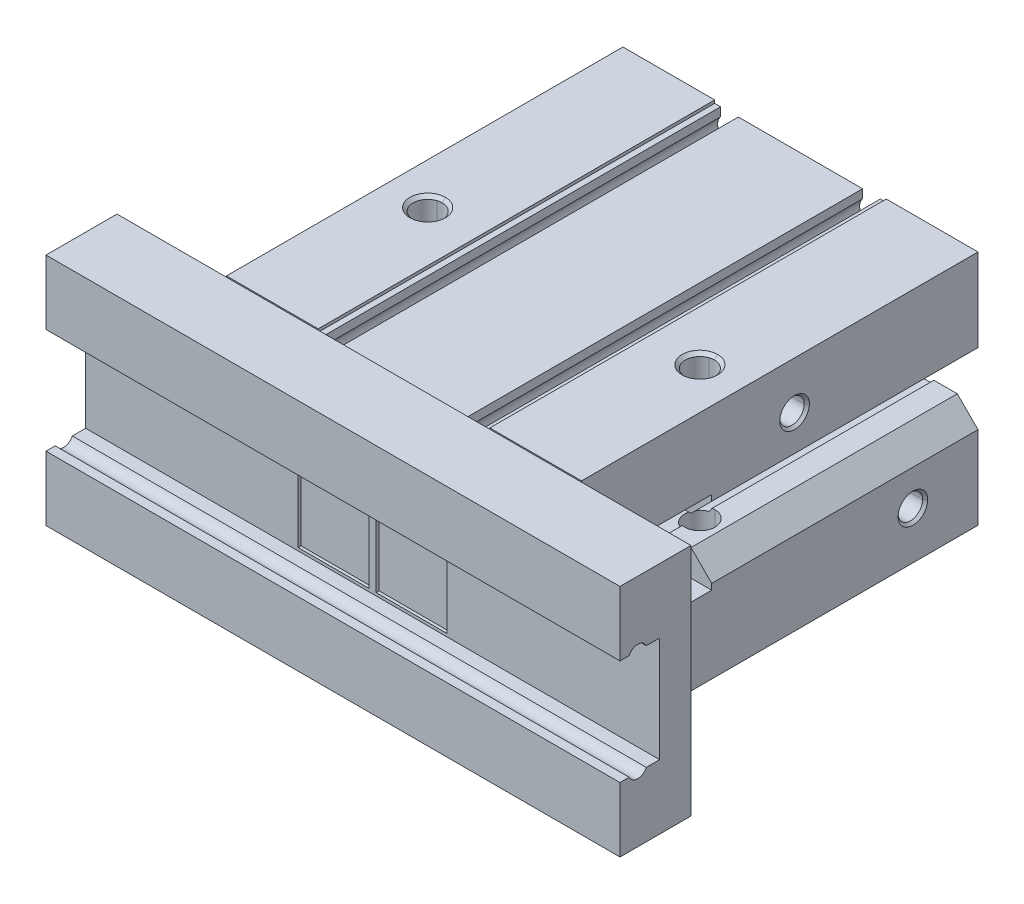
ISO-10303-21;
HEADER;
FILE_DESCRIPTION(('STEP AP214'),'2;1');
FILE_NAME('part.step','',(''),(''),'','','');
FILE_SCHEMA(('AUTOMOTIVE_DESIGN { 1 0 10303 214 1 1 1 1 }'));
ENDSEC;
DATA;
#1=APPLICATION_CONTEXT('core data for automotive mechanical design processes');
#2=APPLICATION_PROTOCOL_DEFINITION('international standard','automotive_design',2000,#1);
#3=PRODUCT_CONTEXT('',#1,'mechanical');
#4=PRODUCT('Part','Part','',(#3));
#5=PRODUCT_RELATED_PRODUCT_CATEGORY('part','',(#4));
#6=PRODUCT_DEFINITION_FORMATION('','',#4);
#7=PRODUCT_DEFINITION_CONTEXT('part definition',#1,'design');
#8=PRODUCT_DEFINITION('design','',#6,#7);
#9=PRODUCT_DEFINITION_SHAPE('','',#8);
#10=(LENGTH_UNIT() NAMED_UNIT(*) SI_UNIT(.MILLI.,.METRE.));
#11=(NAMED_UNIT(*) PLANE_ANGLE_UNIT() SI_UNIT($,.RADIAN.));
#12=(NAMED_UNIT(*) SI_UNIT($,.STERADIAN.) SOLID_ANGLE_UNIT());
#13=UNCERTAINTY_MEASURE_WITH_UNIT(LENGTH_MEASURE(1.E-05),#10,'distance_accuracy_value','');
#14=(GEOMETRIC_REPRESENTATION_CONTEXT(3) GLOBAL_UNCERTAINTY_ASSIGNED_CONTEXT((#13)) GLOBAL_UNIT_ASSIGNED_CONTEXT((#10,
#11,#12)) REPRESENTATION_CONTEXT('',''));
#15=CARTESIAN_POINT('',(0.,0.,0.));
#16=DIRECTION('',(0.,0.,1.));
#17=DIRECTION('',(1.,0.,0.));
#18=AXIS2_PLACEMENT_3D('',#15,#16,#17);
#19=CARTESIAN_POINT('',(0.,0.,0.));
#20=DIRECTION('',(0.,0.,1.));
#21=DIRECTION('',(1.,0.,0.));
#22=AXIS2_PLACEMENT_3D('',#19,#20,#21);
#23=PLANE('',#22);
#24=CARTESIAN_POINT('',(0.,0.,0.));
#25=DIRECTION('',(0.,0.,1.));
#26=DIRECTION('',(1.,0.,0.));
#27=AXIS2_PLACEMENT_3D('',#24,#25,#26);
#28=CIRCLE('',#27,17.);
#29=CARTESIAN_POINT('',(17.,0.,0.));
#30=VERTEX_POINT('',#29);
#31=CARTESIAN_POINT('',(-17.,0.,0.));
#32=VERTEX_POINT('',#31);
#33=EDGE_CURVE('E10',#30,#32,#28,.T.);
#34=ORIENTED_EDGE('',*,*,#33,.T.);
#35=CARTESIAN_POINT('',(0.,0.,0.));
#36=DIRECTION('',(0.,0.,1.));
#37=DIRECTION('',(1.,0.,0.));
#38=AXIS2_PLACEMENT_3D('',#35,#36,#37);
#39=CIRCLE('',#38,17.);
#40=EDGE_CURVE('E24',#32,#30,#39,.T.);
#41=ORIENTED_EDGE('',*,*,#40,.T.);
#42=EDGE_LOOP('',(#34,#41));
#43=FACE_BOUND('',#42,.T.);
#44=CARTESIAN_POINT('',(-23.,12.,0.));
#45=DIRECTION('',(0.,0.,1.));
#46=DIRECTION('',(1.,0.,0.));
#47=AXIS2_PLACEMENT_3D('',#44,#45,#46);
#48=CIRCLE('',#47,2.5);
#49=CARTESIAN_POINT('',(-20.5,12.,0.));
#50=VERTEX_POINT('',#49);
#51=CARTESIAN_POINT('',(-25.5,12.,0.));
#52=VERTEX_POINT('',#51);
#53=EDGE_CURVE('E2850',#50,#52,#48,.T.);
#54=ORIENTED_EDGE('',*,*,#53,.T.);
#55=CARTESIAN_POINT('',(-23.,12.,0.));
#56=DIRECTION('',(0.,0.,1.));
#57=DIRECTION('',(1.,0.,0.));
#58=AXIS2_PLACEMENT_3D('',#55,#56,#57);
#59=CIRCLE('',#58,2.5);
#60=EDGE_CURVE('E2846',#52,#50,#59,.T.);
#61=ORIENTED_EDGE('',*,*,#60,.T.);
#62=EDGE_LOOP('',(#54,#61));
#63=FACE_BOUND('',#62,.T.);
#64=CARTESIAN_POINT('',(-23.,-13.,0.));
#65=DIRECTION('',(0.,0.,-1.));
#66=DIRECTION('',(-1.,0.,0.));
#67=AXIS2_PLACEMENT_3D('',#64,#65,#66);
#68=CIRCLE('',#67,3.);
#69=CARTESIAN_POINT('',(-20.,-13.,0.));
#70=VERTEX_POINT('',#69);
#71=CARTESIAN_POINT('',(-26.,-13.,0.));
#72=VERTEX_POINT('',#71);
#73=EDGE_CURVE('E2841',#70,#72,#68,.T.);
#74=ORIENTED_EDGE('',*,*,#73,.F.);
#75=CARTESIAN_POINT('',(-23.,-13.,0.));
#76=DIRECTION('',(0.,0.,-1.));
#77=DIRECTION('',(-1.,0.,0.));
#78=AXIS2_PLACEMENT_3D('',#75,#76,#77);
#79=CIRCLE('',#78,3.);
#80=EDGE_CURVE('E2836',#72,#70,#79,.T.);
#81=ORIENTED_EDGE('',*,*,#80,.F.);
#82=EDGE_LOOP('',(#74,#81));
#83=FACE_BOUND('',#82,.T.);
#84=CARTESIAN_POINT('',(23.,13.,0.));
#85=DIRECTION('',(0.,0.,-1.));
#86=DIRECTION('',(-1.,0.,0.));
#87=AXIS2_PLACEMENT_3D('',#84,#85,#86);
#88=CIRCLE('',#87,3.);
#89=CARTESIAN_POINT('',(26.,13.,0.));
#90=VERTEX_POINT('',#89);
#91=CARTESIAN_POINT('',(20.,13.,0.));
#92=VERTEX_POINT('',#91);
#93=EDGE_CURVE('E2831',#90,#92,#88,.T.);
#94=ORIENTED_EDGE('',*,*,#93,.F.);
#95=CARTESIAN_POINT('',(23.,13.,0.));
#96=DIRECTION('',(0.,0.,-1.));
#97=DIRECTION('',(-1.,0.,0.));
#98=AXIS2_PLACEMENT_3D('',#95,#96,#97);
#99=CIRCLE('',#98,3.);
#100=EDGE_CURVE('E2826',#92,#90,#99,.T.);
#101=ORIENTED_EDGE('',*,*,#100,.F.);
#102=EDGE_LOOP('',(#94,#101));
#103=FACE_BOUND('',#102,.T.);
#104=DIRECTION('',(-1.,0.,0.));
#105=VECTOR('',#104,1.);
#106=CARTESIAN_POINT('',(14.5,-19.5,0.));
#107=LINE('',#106,#105);
#108=CARTESIAN_POINT('',(-13.5,-19.5,0.));
#109=VERTEX_POINT('',#108);
#110=CARTESIAN_POINT('',(-14.5,-19.5,0.));
#111=VERTEX_POINT('',#110);
#112=EDGE_CURVE('E2822',#109,#111,#107,.T.);
#113=ORIENTED_EDGE('',*,*,#112,.T.);
#114=DIRECTION('',(0.,-1.,0.));
#115=VECTOR('',#114,1.);
#116=CARTESIAN_POINT('',(-14.5,-19.5,0.));
#117=LINE('',#116,#115);
#118=CARTESIAN_POINT('',(-14.5,-20.,0.));
#119=VERTEX_POINT('',#118);
#120=EDGE_CURVE('E2818',#111,#119,#117,.T.);
#121=ORIENTED_EDGE('',*,*,#120,.T.);
#122=DIRECTION('',(1.,0.,0.));
#123=VECTOR('',#122,1.);
#124=CARTESIAN_POINT('',(-30.,-20.,0.));
#125=LINE('',#124,#123);
#126=CARTESIAN_POINT('',(-30.,-20.,0.));
#127=VERTEX_POINT('',#126);
#128=EDGE_CURVE('E2813',#127,#119,#125,.T.);
#129=ORIENTED_EDGE('',*,*,#128,.F.);
#130=DIRECTION('',(0.,-1.,0.));
#131=VECTOR('',#130,1.);
#132=CARTESIAN_POINT('',(-30.,20.,0.));
#133=LINE('',#132,#131);
#134=CARTESIAN_POINT('',(-30.,-6.,0.));
#135=VERTEX_POINT('',#134);
#136=EDGE_CURVE('E2808',#135,#127,#133,.T.);
#137=ORIENTED_EDGE('',*,*,#136,.F.);
#138=DIRECTION('',(0.707106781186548,0.707106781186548,0.));
#139=VECTOR('',#138,1.);
#140=CARTESIAN_POINT('',(-30.,-6.,0.));
#141=LINE('',#140,#139);
#142=CARTESIAN_POINT('',(-26.5,-2.5,0.));
#143=VERTEX_POINT('',#142);
#144=EDGE_CURVE('E2804',#135,#143,#141,.T.);
#145=ORIENTED_EDGE('',*,*,#144,.T.);
#146=DIRECTION('',(1.,0.,0.));
#147=VECTOR('',#146,1.);
#148=CARTESIAN_POINT('',(-30.,-2.5,0.));
#149=LINE('',#148,#147);
#150=CARTESIAN_POINT('',(-22.546410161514,-2.5,0.));
#151=VERTEX_POINT('',#150);
#152=EDGE_CURVE('E2800',#143,#151,#149,.T.);
#153=ORIENTED_EDGE('',*,*,#152,.T.);
#154=DIRECTION('',(0.500000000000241,-0.866025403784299,0.));
#155=VECTOR('',#154,1.);
#156=CARTESIAN_POINT('',(-22.546410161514,-2.5,0.));
#157=LINE('',#156,#155);
#158=CARTESIAN_POINT('',(-22.2,-3.1,0.));
#159=VERTEX_POINT('',#158);
#160=EDGE_CURVE('E2796',#151,#159,#157,.T.);
#161=ORIENTED_EDGE('',*,*,#160,.T.);
#162=DIRECTION('',(1.,0.,0.));
#163=VECTOR('',#162,1.);
#164=CARTESIAN_POINT('',(-22.2,-3.1,0.));
#165=LINE('',#164,#163);
#166=CARTESIAN_POINT('',(-18.5,-3.1,0.));
#167=VERTEX_POINT('',#166);
#168=EDGE_CURVE('E2792',#159,#167,#165,.T.);
#169=ORIENTED_EDGE('',*,*,#168,.T.);
#170=DIRECTION('',(0.,1.,0.));
#171=VECTOR('',#170,1.);
#172=CARTESIAN_POINT('',(-18.5,-3.1,0.));
#173=LINE('',#172,#171);
#174=CARTESIAN_POINT('',(-18.5,3.1,0.));
#175=VERTEX_POINT('',#174);
#176=EDGE_CURVE('E2788',#167,#175,#173,.T.);
#177=ORIENTED_EDGE('',*,*,#176,.T.);
#178=DIRECTION('',(-1.,0.,0.));
#179=VECTOR('',#178,1.);
#180=CARTESIAN_POINT('',(-18.5,3.1,0.));
#181=LINE('',#180,#179);
#182=CARTESIAN_POINT('',(-22.2,3.1,0.));
#183=VERTEX_POINT('',#182);
#184=EDGE_CURVE('E2784',#175,#183,#181,.T.);
#185=ORIENTED_EDGE('',*,*,#184,.T.);
#186=DIRECTION('',(-0.500000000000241,-0.866025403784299,0.));
#187=VECTOR('',#186,1.);
#188=CARTESIAN_POINT('',(-22.2,3.1,0.));
#189=LINE('',#188,#187);
#190=CARTESIAN_POINT('',(-22.546410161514,2.5,0.));
#191=VERTEX_POINT('',#190);
#192=EDGE_CURVE('E2780',#183,#191,#189,.T.);
#193=ORIENTED_EDGE('',*,*,#192,.T.);
#194=DIRECTION('',(-1.,0.,0.));
#195=VECTOR('',#194,1.);
#196=CARTESIAN_POINT('',(-22.546410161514,2.5,0.));
#197=LINE('',#196,#195);
#198=CARTESIAN_POINT('',(-26.5,2.5,0.));
#199=VERTEX_POINT('',#198);
#200=EDGE_CURVE('E2776',#191,#199,#197,.T.);
#201=ORIENTED_EDGE('',*,*,#200,.T.);
#202=DIRECTION('',(-0.707106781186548,0.707106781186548,0.));
#203=VECTOR('',#202,1.);
#204=CARTESIAN_POINT('',(-26.5,2.5,0.));
#205=LINE('',#204,#203);
#206=CARTESIAN_POINT('',(-30.,6.,0.));
#207=VERTEX_POINT('',#206);
#208=EDGE_CURVE('E2772',#199,#207,#205,.T.);
#209=ORIENTED_EDGE('',*,*,#208,.T.);
#210=DIRECTION('',(0.,-1.,0.));
#211=VECTOR('',#210,1.);
#212=CARTESIAN_POINT('',(-30.,20.,0.));
#213=LINE('',#212,#211);
#214=CARTESIAN_POINT('',(-30.,20.,0.));
#215=VERTEX_POINT('',#214);
#216=EDGE_CURVE('E2767',#215,#207,#213,.T.);
#217=ORIENTED_EDGE('',*,*,#216,.F.);
#218=DIRECTION('',(-1.,0.,0.));
#219=VECTOR('',#218,1.);
#220=CARTESIAN_POINT('',(30.,20.,0.));
#221=LINE('',#220,#219);
#222=CARTESIAN_POINT('',(-14.5,20.,0.));
#223=VERTEX_POINT('',#222);
#224=EDGE_CURVE('E2762',#223,#215,#221,.T.);
#225=ORIENTED_EDGE('',*,*,#224,.F.);
#226=DIRECTION('',(0.,-1.,0.));
#227=VECTOR('',#226,1.);
#228=CARTESIAN_POINT('',(-14.5,20.,0.));
#229=LINE('',#228,#227);
#230=CARTESIAN_POINT('',(-14.5,19.5,0.));
#231=VERTEX_POINT('',#230);
#232=EDGE_CURVE('E2758',#223,#231,#229,.T.);
#233=ORIENTED_EDGE('',*,*,#232,.T.);
#234=DIRECTION('',(1.,0.,0.));
#235=VECTOR('',#234,1.);
#236=CARTESIAN_POINT('',(-14.5,19.5,0.));
#237=LINE('',#236,#235);
#238=CARTESIAN_POINT('',(-13.5,19.5,0.));
#239=VERTEX_POINT('',#238);
#240=EDGE_CURVE('E2754',#231,#239,#237,.T.);
#241=ORIENTED_EDGE('',*,*,#240,.T.);
#242=DIRECTION('',(0.,-1.,0.));
#243=VECTOR('',#242,1.);
#244=CARTESIAN_POINT('',(-13.5,20.,0.));
#245=LINE('',#244,#243);
#246=CARTESIAN_POINT('',(-13.5,18.022875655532,0.));
#247=VERTEX_POINT('',#246);
#248=EDGE_CURVE('E2750',#239,#247,#245,.T.);
#249=ORIENTED_EDGE('',*,*,#248,.T.);
#250=CARTESIAN_POINT('',(-12.,16.7,0.));
#251=DIRECTION('',(0.,0.,1.));
#252=DIRECTION('',(1.,0.,0.));
#253=AXIS2_PLACEMENT_3D('',#250,#251,#252);
#254=CIRCLE('',#253,1.99999999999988);
#255=CARTESIAN_POINT('',(-10.5,18.022875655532,0.));
#256=VERTEX_POINT('',#255);
#257=EDGE_CURVE('E2746',#247,#256,#254,.T.);
#258=ORIENTED_EDGE('',*,*,#257,.T.);
#259=DIRECTION('',(0.,1.,0.));
#260=VECTOR('',#259,1.);
#261=CARTESIAN_POINT('',(-10.5,18.022875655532,0.));
#262=LINE('',#261,#260);
#263=CARTESIAN_POINT('',(-10.5,19.5,0.));
#264=VERTEX_POINT('',#263);
#265=EDGE_CURVE('E2742',#256,#264,#262,.T.);
#266=ORIENTED_EDGE('',*,*,#265,.T.);
#267=DIRECTION('',(1.,0.,0.));
#268=VECTOR('',#267,1.);
#269=CARTESIAN_POINT('',(-12.,19.5,0.));
#270=LINE('',#269,#268);
#271=CARTESIAN_POINT('',(10.5,19.5,0.));
#272=VERTEX_POINT('',#271);
#273=EDGE_CURVE('E2738',#264,#272,#270,.T.);
#274=ORIENTED_EDGE('',*,*,#273,.T.);
#275=DIRECTION('',(0.,-1.,0.));
#276=VECTOR('',#275,1.);
#277=CARTESIAN_POINT('',(10.5,20.,0.));
#278=LINE('',#277,#276);
#279=CARTESIAN_POINT('',(10.5,18.022875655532,0.));
#280=VERTEX_POINT('',#279);
#281=EDGE_CURVE('E2734',#272,#280,#278,.T.);
#282=ORIENTED_EDGE('',*,*,#281,.T.);
#283=CARTESIAN_POINT('',(12.,16.7,0.));
#284=DIRECTION('',(0.,0.,1.));
#285=DIRECTION('',(1.,0.,0.));
#286=AXIS2_PLACEMENT_3D('',#283,#284,#285);
#287=CIRCLE('',#286,1.99999999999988);
#288=CARTESIAN_POINT('',(13.5,18.022875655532,0.));
#289=VERTEX_POINT('',#288);
#290=EDGE_CURVE('E2730',#280,#289,#287,.T.);
#291=ORIENTED_EDGE('',*,*,#290,.T.);
#292=DIRECTION('',(0.,1.,0.));
#293=VECTOR('',#292,1.);
#294=CARTESIAN_POINT('',(13.5,18.022875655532,0.));
#295=LINE('',#294,#293);
#296=CARTESIAN_POINT('',(13.5,19.5,0.));
#297=VERTEX_POINT('',#296);
#298=EDGE_CURVE('E2726',#289,#297,#295,.T.);
#299=ORIENTED_EDGE('',*,*,#298,.T.);
#300=DIRECTION('',(1.,0.,0.));
#301=VECTOR('',#300,1.);
#302=CARTESIAN_POINT('',(-14.5,19.5,0.));
#303=LINE('',#302,#301);
#304=CARTESIAN_POINT('',(14.5,19.5,0.));
#305=VERTEX_POINT('',#304);
#306=EDGE_CURVE('E2722',#297,#305,#303,.T.);
#307=ORIENTED_EDGE('',*,*,#306,.T.);
#308=DIRECTION('',(0.,1.,0.));
#309=VECTOR('',#308,1.);
#310=CARTESIAN_POINT('',(14.5,19.5,0.));
#311=LINE('',#310,#309);
#312=CARTESIAN_POINT('',(14.5,20.,0.));
#313=VERTEX_POINT('',#312);
#314=EDGE_CURVE('E2718',#305,#313,#311,.T.);
#315=ORIENTED_EDGE('',*,*,#314,.T.);
#316=DIRECTION('',(-1.,0.,0.));
#317=VECTOR('',#316,1.);
#318=CARTESIAN_POINT('',(30.,20.,0.));
#319=LINE('',#318,#317);
#320=CARTESIAN_POINT('',(30.,20.,0.));
#321=VERTEX_POINT('',#320);
#322=EDGE_CURVE('E2713',#321,#313,#319,.T.);
#323=ORIENTED_EDGE('',*,*,#322,.F.);
#324=DIRECTION('',(0.,1.,0.));
#325=VECTOR('',#324,1.);
#326=CARTESIAN_POINT('',(30.,-20.,0.));
#327=LINE('',#326,#325);
#328=CARTESIAN_POINT('',(30.,6.,0.));
#329=VERTEX_POINT('',#328);
#330=EDGE_CURVE('E2708',#329,#321,#327,.T.);
#331=ORIENTED_EDGE('',*,*,#330,.F.);
#332=DIRECTION('',(-0.707106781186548,-0.707106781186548,0.));
#333=VECTOR('',#332,1.);
#334=CARTESIAN_POINT('',(30.,6.,0.));
#335=LINE('',#334,#333);
#336=CARTESIAN_POINT('',(26.5,2.5,0.));
#337=VERTEX_POINT('',#336);
#338=EDGE_CURVE('E2704',#329,#337,#335,.T.);
#339=ORIENTED_EDGE('',*,*,#338,.T.);
#340=DIRECTION('',(-1.,0.,0.));
#341=VECTOR('',#340,1.);
#342=CARTESIAN_POINT('',(30.,2.5,0.));
#343=LINE('',#342,#341);
#344=CARTESIAN_POINT('',(22.546410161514,2.5,0.));
#345=VERTEX_POINT('',#344);
#346=EDGE_CURVE('E2700',#337,#345,#343,.T.);
#347=ORIENTED_EDGE('',*,*,#346,.T.);
#348=DIRECTION('',(-0.500000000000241,0.866025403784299,0.));
#349=VECTOR('',#348,1.);
#350=CARTESIAN_POINT('',(22.546410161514,2.5,0.));
#351=LINE('',#350,#349);
#352=CARTESIAN_POINT('',(22.2,3.1,0.));
#353=VERTEX_POINT('',#352);
#354=EDGE_CURVE('E2696',#345,#353,#351,.T.);
#355=ORIENTED_EDGE('',*,*,#354,.T.);
#356=DIRECTION('',(-1.,0.,0.));
#357=VECTOR('',#356,1.);
#358=CARTESIAN_POINT('',(22.2,3.1,0.));
#359=LINE('',#358,#357);
#360=CARTESIAN_POINT('',(18.5,3.1,0.));
#361=VERTEX_POINT('',#360);
#362=EDGE_CURVE('E2692',#353,#361,#359,.T.);
#363=ORIENTED_EDGE('',*,*,#362,.T.);
#364=DIRECTION('',(0.,-1.,0.));
#365=VECTOR('',#364,1.);
#366=CARTESIAN_POINT('',(18.5,3.1,0.));
#367=LINE('',#366,#365);
#368=CARTESIAN_POINT('',(18.5,-3.1,0.));
#369=VERTEX_POINT('',#368);
#370=EDGE_CURVE('E2688',#361,#369,#367,.T.);
#371=ORIENTED_EDGE('',*,*,#370,.T.);
#372=DIRECTION('',(1.,0.,0.));
#373=VECTOR('',#372,1.);
#374=CARTESIAN_POINT('',(18.5,-3.1,0.));
#375=LINE('',#374,#373);
#376=CARTESIAN_POINT('',(22.2,-3.1,0.));
#377=VERTEX_POINT('',#376);
#378=EDGE_CURVE('E2684',#369,#377,#375,.T.);
#379=ORIENTED_EDGE('',*,*,#378,.T.);
#380=DIRECTION('',(0.500000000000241,0.866025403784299,0.));
#381=VECTOR('',#380,1.);
#382=CARTESIAN_POINT('',(22.2,-3.1,0.));
#383=LINE('',#382,#381);
#384=CARTESIAN_POINT('',(22.546410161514,-2.5,0.));
#385=VERTEX_POINT('',#384);
#386=EDGE_CURVE('E2680',#377,#385,#383,.T.);
#387=ORIENTED_EDGE('',*,*,#386,.T.);
#388=DIRECTION('',(1.,0.,0.));
#389=VECTOR('',#388,1.);
#390=CARTESIAN_POINT('',(22.546410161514,-2.5,0.));
#391=LINE('',#390,#389);
#392=CARTESIAN_POINT('',(26.5,-2.5,0.));
#393=VERTEX_POINT('',#392);
#394=EDGE_CURVE('E2676',#385,#393,#391,.T.);
#395=ORIENTED_EDGE('',*,*,#394,.T.);
#396=DIRECTION('',(0.707106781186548,-0.707106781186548,0.));
#397=VECTOR('',#396,1.);
#398=CARTESIAN_POINT('',(26.5,-2.5,0.));
#399=LINE('',#398,#397);
#400=CARTESIAN_POINT('',(30.,-6.,0.));
#401=VERTEX_POINT('',#400);
#402=EDGE_CURVE('E2672',#393,#401,#399,.T.);
#403=ORIENTED_EDGE('',*,*,#402,.T.);
#404=DIRECTION('',(0.,1.,0.));
#405=VECTOR('',#404,1.);
#406=CARTESIAN_POINT('',(30.,-20.,0.));
#407=LINE('',#406,#405);
#408=CARTESIAN_POINT('',(30.,-20.,0.));
#409=VERTEX_POINT('',#408);
#410=EDGE_CURVE('E2667',#409,#401,#407,.T.);
#411=ORIENTED_EDGE('',*,*,#410,.F.);
#412=DIRECTION('',(1.,0.,0.));
#413=VECTOR('',#412,1.);
#414=CARTESIAN_POINT('',(-30.,-20.,0.));
#415=LINE('',#414,#413);
#416=CARTESIAN_POINT('',(14.5,-20.,0.));
#417=VERTEX_POINT('',#416);
#418=EDGE_CURVE('E2662',#417,#409,#415,.T.);
#419=ORIENTED_EDGE('',*,*,#418,.F.);
#420=DIRECTION('',(0.,1.,0.));
#421=VECTOR('',#420,1.);
#422=CARTESIAN_POINT('',(14.5,-20.,0.));
#423=LINE('',#422,#421);
#424=CARTESIAN_POINT('',(14.5,-19.5,0.));
#425=VERTEX_POINT('',#424);
#426=EDGE_CURVE('E2658',#417,#425,#423,.T.);
#427=ORIENTED_EDGE('',*,*,#426,.T.);
#428=DIRECTION('',(-1.,0.,0.));
#429=VECTOR('',#428,1.);
#430=CARTESIAN_POINT('',(14.5,-19.5,0.));
#431=LINE('',#430,#429);
#432=CARTESIAN_POINT('',(13.5,-19.5,0.));
#433=VERTEX_POINT('',#432);
#434=EDGE_CURVE('E2654',#425,#433,#431,.T.);
#435=ORIENTED_EDGE('',*,*,#434,.T.);
#436=DIRECTION('',(0.,1.,0.));
#437=VECTOR('',#436,1.);
#438=CARTESIAN_POINT('',(13.5,-20.,0.));
#439=LINE('',#438,#437);
#440=CARTESIAN_POINT('',(13.5,-18.022875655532,0.));
#441=VERTEX_POINT('',#440);
#442=EDGE_CURVE('E2650',#433,#441,#439,.T.);
#443=ORIENTED_EDGE('',*,*,#442,.T.);
#444=CARTESIAN_POINT('',(12.,-16.7,0.));
#445=DIRECTION('',(0.,0.,1.));
#446=DIRECTION('',(1.,0.,0.));
#447=AXIS2_PLACEMENT_3D('',#444,#445,#446);
#448=CIRCLE('',#447,1.99999999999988);
#449=CARTESIAN_POINT('',(10.5,-18.022875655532,0.));
#450=VERTEX_POINT('',#449);
#451=EDGE_CURVE('E2646',#441,#450,#448,.T.);
#452=ORIENTED_EDGE('',*,*,#451,.T.);
#453=DIRECTION('',(0.,-1.,0.));
#454=VECTOR('',#453,1.);
#455=CARTESIAN_POINT('',(10.5,-18.022875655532,0.));
#456=LINE('',#455,#454);
#457=CARTESIAN_POINT('',(10.5,-19.5,0.));
#458=VERTEX_POINT('',#457);
#459=EDGE_CURVE('E2642',#450,#458,#456,.T.);
#460=ORIENTED_EDGE('',*,*,#459,.T.);
#461=DIRECTION('',(-1.,0.,0.));
#462=VECTOR('',#461,1.);
#463=CARTESIAN_POINT('',(12.,-19.5,0.));
#464=LINE('',#463,#462);
#465=CARTESIAN_POINT('',(-10.5,-19.5,0.));
#466=VERTEX_POINT('',#465);
#467=EDGE_CURVE('E2638',#458,#466,#464,.T.);
#468=ORIENTED_EDGE('',*,*,#467,.T.);
#469=DIRECTION('',(0.,1.,0.));
#470=VECTOR('',#469,1.);
#471=CARTESIAN_POINT('',(-10.5,-20.,0.));
#472=LINE('',#471,#470);
#473=CARTESIAN_POINT('',(-10.5,-18.022875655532,0.));
#474=VERTEX_POINT('',#473);
#475=EDGE_CURVE('E2634',#466,#474,#472,.T.);
#476=ORIENTED_EDGE('',*,*,#475,.T.);
#477=CARTESIAN_POINT('',(-12.,-16.7,0.));
#478=DIRECTION('',(0.,0.,1.));
#479=DIRECTION('',(1.,0.,0.));
#480=AXIS2_PLACEMENT_3D('',#477,#478,#479);
#481=CIRCLE('',#480,1.99999999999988);
#482=CARTESIAN_POINT('',(-13.5,-18.022875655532,0.));
#483=VERTEX_POINT('',#482);
#484=EDGE_CURVE('E2630',#474,#483,#481,.T.);
#485=ORIENTED_EDGE('',*,*,#484,.T.);
#486=DIRECTION('',(0.,-1.,0.));
#487=VECTOR('',#486,1.);
#488=CARTESIAN_POINT('',(-13.5,-18.022875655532,0.));
#489=LINE('',#488,#487);
#490=EDGE_CURVE('E2626',#483,#109,#489,.T.);
#491=ORIENTED_EDGE('',*,*,#490,.T.);
#492=EDGE_LOOP('',(#113,#121,#129,#137,#145,#153,#161,#169,#177,#185,#193,#201,#209,#217,#225,
#233,#241,#249,#258,#266,#274,#282,#291,#299,#307,#315,#323,#331,#339,#347,#355,#363,#371,#379,
#387,#395,#403,#411,#419,#427,#435,#443,#452,#460,#468,#476,#485,#491));
#493=FACE_BOUND('',#492,.T.);
#494=ADVANCED_FACE('F16',(#43,#63,#83,#103,#493),#23,.F.);
#495=CARTESIAN_POINT('',(-13.5,-18.022875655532,67.));
#496=DIRECTION('',(1.,0.,0.));
#497=DIRECTION('',(0.,0.,-1.));
#498=AXIS2_PLACEMENT_3D('',#495,#496,#497);
#499=PLANE('',#498);
#500=DIRECTION('',(0.,-1.,0.));
#501=VECTOR('',#500,1.);
#502=CARTESIAN_POINT('',(-13.5,-18.022875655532,67.));
#503=LINE('',#502,#501);
#504=CARTESIAN_POINT('',(-13.5,-18.022875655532,67.));
#505=VERTEX_POINT('',#504);
#506=CARTESIAN_POINT('',(-13.5,-19.5,67.));
#507=VERTEX_POINT('',#506);
#508=EDGE_CURVE('E2622',#505,#507,#503,.T.);
#509=ORIENTED_EDGE('',*,*,#508,.T.);
#510=DIRECTION('',(0.,0.,-1.));
#511=VECTOR('',#510,1.);
#512=CARTESIAN_POINT('',(-13.5,-19.5,67.));
#513=LINE('',#512,#511);
#514=EDGE_CURVE('E2617',#507,#109,#513,.T.);
#515=ORIENTED_EDGE('',*,*,#514,.T.);
#516=ORIENTED_EDGE('',*,*,#490,.F.);
#517=DIRECTION('',(0.,0.,-1.));
#518=VECTOR('',#517,1.);
#519=CARTESIAN_POINT('',(-13.5,-18.022875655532,67.));
#520=LINE('',#519,#518);
#521=EDGE_CURVE('E2612',#505,#483,#520,.T.);
#522=ORIENTED_EDGE('',*,*,#521,.F.);
#523=EDGE_LOOP('',(#509,#515,#516,#522));
#524=FACE_BOUND('',#523,.T.);
#525=ADVANCED_FACE('F2882',(#524),#499,.T.);
#526=CARTESIAN_POINT('',(-12.,-16.7,67.));
#527=DIRECTION('',(0.,0.,-1.));
#528=DIRECTION('',(0.,-1.,0.));
#529=AXIS2_PLACEMENT_3D('',#526,#527,#528);
#530=CYLINDRICAL_SURFACE('',#529,1.99999999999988);
#531=ORIENTED_EDGE('',*,*,#484,.F.);
#532=DIRECTION('',(0.,0.,-1.));
#533=VECTOR('',#532,1.);
#534=CARTESIAN_POINT('',(-10.5,-18.022875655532,67.));
#535=LINE('',#534,#533);
#536=CARTESIAN_POINT('',(-10.5,-18.022875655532,67.));
#537=VERTEX_POINT('',#536);
#538=EDGE_CURVE('E2607',#537,#474,#535,.T.);
#539=ORIENTED_EDGE('',*,*,#538,.F.);
#540=CARTESIAN_POINT('',(-12.,-16.7,67.));
#541=DIRECTION('',(0.,0.,1.));
#542=DIRECTION('',(1.,0.,0.));
#543=AXIS2_PLACEMENT_3D('',#540,#541,#542);
#544=CIRCLE('',#543,1.99999999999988);
#545=EDGE_CURVE('E2602',#537,#505,#544,.T.);
#546=ORIENTED_EDGE('',*,*,#545,.T.);
#547=ORIENTED_EDGE('',*,*,#521,.T.);
#548=EDGE_LOOP('',(#531,#539,#546,#547));
#549=FACE_BOUND('',#548,.T.);
#550=ADVANCED_FACE('F2886',(#549),#530,.F.);
#551=CARTESIAN_POINT('',(48.5,-19.8,67.));
#552=DIRECTION('',(0.,0.,1.));
#553=DIRECTION('',(1.,0.,0.));
#554=AXIS2_PLACEMENT_3D('',#551,#552,#553);
#555=PLANE('',#554);
#556=DIRECTION('',(0.,1.,0.));
#557=VECTOR('',#556,1.);
#558=CARTESIAN_POINT('',(14.5,-20.,67.));
#559=LINE('',#558,#557);
#560=CARTESIAN_POINT('',(14.5,-19.8,67.));
#561=VERTEX_POINT('',#560);
#562=CARTESIAN_POINT('',(14.5,-19.5,67.));
#563=VERTEX_POINT('',#562);
#564=EDGE_CURVE('E2597',#561,#563,#559,.T.);
#565=ORIENTED_EDGE('',*,*,#564,.F.);
#566=DIRECTION('',(-1.,0.,0.));
#567=VECTOR('',#566,1.);
#568=CARTESIAN_POINT('',(48.5,-19.8,67.));
#569=LINE('',#568,#567);
#570=CARTESIAN_POINT('',(-14.5,-19.8,67.));
#571=VERTEX_POINT('',#570);
#572=EDGE_CURVE('E2593',#561,#571,#569,.T.);
#573=ORIENTED_EDGE('',*,*,#572,.T.);
#574=DIRECTION('',(0.,-1.,0.));
#575=VECTOR('',#574,1.);
#576=CARTESIAN_POINT('',(-14.5,-19.5,67.));
#577=LINE('',#576,#575);
#578=CARTESIAN_POINT('',(-14.5,-19.5,67.));
#579=VERTEX_POINT('',#578);
#580=EDGE_CURVE('E2588',#579,#571,#577,.T.);
#581=ORIENTED_EDGE('',*,*,#580,.F.);
#582=DIRECTION('',(-1.,0.,0.));
#583=VECTOR('',#582,1.);
#584=CARTESIAN_POINT('',(14.5,-19.5,67.));
#585=LINE('',#584,#583);
#586=EDGE_CURVE('E2583',#507,#579,#585,.T.);
#587=ORIENTED_EDGE('',*,*,#586,.F.);
#588=ORIENTED_EDGE('',*,*,#508,.F.);
#589=ORIENTED_EDGE('',*,*,#545,.F.);
#590=DIRECTION('',(0.,1.,0.));
#591=VECTOR('',#590,1.);
#592=CARTESIAN_POINT('',(-10.5,-20.,67.));
#593=LINE('',#592,#591);
#594=CARTESIAN_POINT('',(-10.5,-19.5,67.));
#595=VERTEX_POINT('',#594);
#596=EDGE_CURVE('E2578',#595,#537,#593,.T.);
#597=ORIENTED_EDGE('',*,*,#596,.F.);
#598=DIRECTION('',(-1.,0.,0.));
#599=VECTOR('',#598,1.);
#600=CARTESIAN_POINT('',(12.,-19.5,67.));
#601=LINE('',#600,#599);
#602=CARTESIAN_POINT('',(10.5,-19.5,67.));
#603=VERTEX_POINT('',#602);
#604=EDGE_CURVE('E2573',#603,#595,#601,.T.);
#605=ORIENTED_EDGE('',*,*,#604,.F.);
#606=DIRECTION('',(0.,-1.,0.));
#607=VECTOR('',#606,1.);
#608=CARTESIAN_POINT('',(10.5,-18.022875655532,67.));
#609=LINE('',#608,#607);
#610=CARTESIAN_POINT('',(10.5,-18.022875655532,67.));
#611=VERTEX_POINT('',#610);
#612=EDGE_CURVE('E2568',#611,#603,#609,.T.);
#613=ORIENTED_EDGE('',*,*,#612,.F.);
#614=CARTESIAN_POINT('',(12.,-16.7,67.));
#615=DIRECTION('',(0.,0.,1.));
#616=DIRECTION('',(1.,0.,0.));
#617=AXIS2_PLACEMENT_3D('',#614,#615,#616);
#618=CIRCLE('',#617,1.99999999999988);
#619=CARTESIAN_POINT('',(13.5,-18.022875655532,67.));
#620=VERTEX_POINT('',#619);
#621=EDGE_CURVE('E2563',#620,#611,#618,.T.);
#622=ORIENTED_EDGE('',*,*,#621,.F.);
#623=DIRECTION('',(0.,1.,0.));
#624=VECTOR('',#623,1.);
#625=CARTESIAN_POINT('',(13.5,-20.,67.));
#626=LINE('',#625,#624);
#627=CARTESIAN_POINT('',(13.5,-19.5,67.));
#628=VERTEX_POINT('',#627);
#629=EDGE_CURVE('E2558',#628,#620,#626,.T.);
#630=ORIENTED_EDGE('',*,*,#629,.F.);
#631=DIRECTION('',(-1.,0.,0.));
#632=VECTOR('',#631,1.);
#633=CARTESIAN_POINT('',(14.5,-19.5,67.));
#634=LINE('',#633,#632);
#635=EDGE_CURVE('E2553',#563,#628,#634,.T.);
#636=ORIENTED_EDGE('',*,*,#635,.F.);
#637=EDGE_LOOP('',(#565,#573,#581,#587,#588,#589,#597,#605,#613,#622,#630,#636));
#638=FACE_BOUND('',#637,.T.);
#639=ADVANCED_FACE('F2891',(#638),#555,.F.);
#640=CARTESIAN_POINT('',(14.5,-19.5,67.));
#641=DIRECTION('',(0.,-1.,0.));
#642=DIRECTION('',(0.,0.,-1.));
#643=AXIS2_PLACEMENT_3D('',#640,#641,#642);
#644=PLANE('',#643);
#645=ORIENTED_EDGE('',*,*,#434,.F.);
#646=DIRECTION('',(0.,0.,-1.));
#647=VECTOR('',#646,1.);
#648=CARTESIAN_POINT('',(14.5,-19.5,67.));
#649=LINE('',#648,#647);
#650=EDGE_CURVE('E2548',#563,#425,#649,.T.);
#651=ORIENTED_EDGE('',*,*,#650,.F.);
#652=ORIENTED_EDGE('',*,*,#635,.T.);
#653=DIRECTION('',(0.,0.,1.));
#654=VECTOR('',#653,1.);
#655=CARTESIAN_POINT('',(13.5,-19.5,67.));
#656=LINE('',#655,#654);
#657=EDGE_CURVE('E2543',#433,#628,#656,.T.);
#658=ORIENTED_EDGE('',*,*,#657,.F.);
#659=EDGE_LOOP('',(#645,#651,#652,#658));
#660=FACE_BOUND('',#659,.T.);
#661=ADVANCED_FACE('F2897',(#660),#644,.T.);
#662=CARTESIAN_POINT('',(13.5,-20.,67.));
#663=DIRECTION('',(-1.,0.,0.));
#664=DIRECTION('',(0.,0.,1.));
#665=AXIS2_PLACEMENT_3D('',#662,#663,#664);
#666=PLANE('',#665);
#667=ORIENTED_EDGE('',*,*,#442,.F.);
#668=ORIENTED_EDGE('',*,*,#657,.T.);
#669=ORIENTED_EDGE('',*,*,#629,.T.);
#670=DIRECTION('',(0.,0.,-1.));
#671=VECTOR('',#670,1.);
#672=CARTESIAN_POINT('',(13.5,-18.022875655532,67.));
#673=LINE('',#672,#671);
#674=EDGE_CURVE('E2538',#620,#441,#673,.T.);
#675=ORIENTED_EDGE('',*,*,#674,.T.);
#676=EDGE_LOOP('',(#667,#668,#669,#675));
#677=FACE_BOUND('',#676,.T.);
#678=ADVANCED_FACE('F2901',(#677),#666,.T.);
#679=CARTESIAN_POINT('',(12.,-16.7,67.));
#680=DIRECTION('',(0.,0.,-1.));
#681=DIRECTION('',(0.,-1.,0.));
#682=AXIS2_PLACEMENT_3D('',#679,#680,#681);
#683=CYLINDRICAL_SURFACE('',#682,1.99999999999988);
#684=ORIENTED_EDGE('',*,*,#451,.F.);
#685=ORIENTED_EDGE('',*,*,#674,.F.);
#686=ORIENTED_EDGE('',*,*,#621,.T.);
#687=DIRECTION('',(0.,0.,-1.));
#688=VECTOR('',#687,1.);
#689=CARTESIAN_POINT('',(10.5,-18.022875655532,67.));
#690=LINE('',#689,#688);
#691=EDGE_CURVE('E2533',#611,#450,#690,.T.);
#692=ORIENTED_EDGE('',*,*,#691,.T.);
#693=EDGE_LOOP('',(#684,#685,#686,#692));
#694=FACE_BOUND('',#693,.T.);
#695=ADVANCED_FACE('F2905',(#694),#683,.F.);
#696=CARTESIAN_POINT('',(10.5,-18.022875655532,67.));
#697=DIRECTION('',(1.,0.,0.));
#698=DIRECTION('',(0.,0.,-1.));
#699=AXIS2_PLACEMENT_3D('',#696,#697,#698);
#700=PLANE('',#699);
#701=ORIENTED_EDGE('',*,*,#612,.T.);
#702=DIRECTION('',(0.,0.,-1.));
#703=VECTOR('',#702,1.);
#704=CARTESIAN_POINT('',(10.5,-19.5,67.));
#705=LINE('',#704,#703);
#706=EDGE_CURVE('E2528',#603,#458,#705,.T.);
#707=ORIENTED_EDGE('',*,*,#706,.T.);
#708=ORIENTED_EDGE('',*,*,#459,.F.);
#709=ORIENTED_EDGE('',*,*,#691,.F.);
#710=EDGE_LOOP('',(#701,#707,#708,#709));
#711=FACE_BOUND('',#710,.T.);
#712=ADVANCED_FACE('F2909',(#711),#700,.T.);
#713=CARTESIAN_POINT('',(12.,-19.5,67.));
#714=DIRECTION('',(0.,-1.,0.));
#715=DIRECTION('',(0.,0.,-1.));
#716=AXIS2_PLACEMENT_3D('',#713,#714,#715);
#717=PLANE('',#716);
#718=ORIENTED_EDGE('',*,*,#604,.T.);
#719=DIRECTION('',(0.,0.,1.));
#720=VECTOR('',#719,1.);
#721=CARTESIAN_POINT('',(-10.5,-19.5,67.));
#722=LINE('',#721,#720);
#723=EDGE_CURVE('E2523',#466,#595,#722,.T.);
#724=ORIENTED_EDGE('',*,*,#723,.F.);
#725=ORIENTED_EDGE('',*,*,#467,.F.);
#726=ORIENTED_EDGE('',*,*,#706,.F.);
#727=EDGE_LOOP('',(#718,#724,#725,#726));
#728=FACE_BOUND('',#727,.T.);
#729=ADVANCED_FACE('F2913',(#728),#717,.T.);
#730=CARTESIAN_POINT('',(-10.5,-20.,67.));
#731=DIRECTION('',(-1.,0.,0.));
#732=DIRECTION('',(0.,0.,1.));
#733=AXIS2_PLACEMENT_3D('',#730,#731,#732);
#734=PLANE('',#733);
#735=ORIENTED_EDGE('',*,*,#475,.F.);
#736=ORIENTED_EDGE('',*,*,#723,.T.);
#737=ORIENTED_EDGE('',*,*,#596,.T.);
#738=ORIENTED_EDGE('',*,*,#538,.T.);
#739=EDGE_LOOP('',(#735,#736,#737,#738));
#740=FACE_BOUND('',#739,.T.);
#741=ADVANCED_FACE('F2917',(#740),#734,.T.);
#742=CARTESIAN_POINT('',(14.5,-20.,67.));
#743=DIRECTION('',(-1.,0.,0.));
#744=DIRECTION('',(0.,0.,1.));
#745=AXIS2_PLACEMENT_3D('',#742,#743,#744);
#746=PLANE('',#745);
#747=ORIENTED_EDGE('',*,*,#426,.F.);
#748=DIRECTION('',(0.,0.,-1.));
#749=VECTOR('',#748,1.);
#750=CARTESIAN_POINT('',(14.5,-20.,67.));
#751=LINE('',#750,#749);
#752=CARTESIAN_POINT('',(14.5,-20.,67.));
#753=VERTEX_POINT('',#752);
#754=EDGE_CURVE('E2518',#753,#417,#751,.T.);
#755=ORIENTED_EDGE('',*,*,#754,.F.);
#756=DIRECTION('',(0.,1.,0.));
#757=VECTOR('',#756,1.);
#758=CARTESIAN_POINT('',(14.5,-20.,67.));
#759=LINE('',#758,#757);
#760=EDGE_CURVE('E2513',#753,#561,#759,.T.);
#761=ORIENTED_EDGE('',*,*,#760,.T.);
#762=ORIENTED_EDGE('',*,*,#564,.T.);
#763=ORIENTED_EDGE('',*,*,#650,.T.);
#764=EDGE_LOOP('',(#747,#755,#761,#762,#763));
#765=FACE_BOUND('',#764,.T.);
#766=ADVANCED_FACE('F2921',(#765),#746,.T.);
#767=CARTESIAN_POINT('',(0.,0.,67.));
#768=DIRECTION('',(0.,0.,1.));
#769=DIRECTION('',(1.,0.,0.));
#770=AXIS2_PLACEMENT_3D('',#767,#768,#769);
#771=PLANE('',#770);
#772=DIRECTION('',(-1.,0.,0.));
#773=VECTOR('',#772,1.);
#774=CARTESIAN_POINT('',(48.5,-19.8,67.));
#775=LINE('',#774,#773);
#776=CARTESIAN_POINT('',(30.,-19.8,67.));
#777=VERTEX_POINT('',#776);
#778=EDGE_CURVE('E2508',#777,#561,#775,.T.);
#779=ORIENTED_EDGE('',*,*,#778,.T.);
#780=ORIENTED_EDGE('',*,*,#760,.F.);
#781=DIRECTION('',(1.,0.,0.));
#782=VECTOR('',#781,1.);
#783=CARTESIAN_POINT('',(-30.,-20.,67.));
#784=LINE('',#783,#782);
#785=CARTESIAN_POINT('',(30.,-20.,67.));
#786=VERTEX_POINT('',#785);
#787=EDGE_CURVE('E2504',#753,#786,#784,.T.);
#788=ORIENTED_EDGE('',*,*,#787,.T.);
#789=DIRECTION('',(0.,1.,0.));
#790=VECTOR('',#789,1.);
#791=CARTESIAN_POINT('',(30.,-20.,67.));
#792=LINE('',#791,#790);
#793=EDGE_CURVE('E2500',#786,#777,#792,.T.);
#794=ORIENTED_EDGE('',*,*,#793,.T.);
#795=EDGE_LOOP('',(#779,#780,#788,#794));
#796=FACE_BOUND('',#795,.T.);
#797=ADVANCED_FACE('F2925',(#796),#771,.T.);
#798=CARTESIAN_POINT('',(30.,-20.,67.));
#799=DIRECTION('',(-1.,0.,0.));
#800=DIRECTION('',(0.,0.,1.));
#801=AXIS2_PLACEMENT_3D('',#798,#799,#800);
#802=PLANE('',#801);
#803=CARTESIAN_POINT('',(30.,-12.,11.));
#804=DIRECTION('',(1.,0.,0.));
#805=DIRECTION('',(0.,0.,-1.));
#806=AXIS2_PLACEMENT_3D('',#803,#804,#805);
#807=CIRCLE('',#806,2.5);
#808=CARTESIAN_POINT('',(30.,-12.,13.5));
#809=VERTEX_POINT('',#808);
#810=CARTESIAN_POINT('',(30.,-12.,8.5));
#811=VERTEX_POINT('',#810);
#812=EDGE_CURVE('E2495',#809,#811,#807,.T.);
#813=ORIENTED_EDGE('',*,*,#812,.F.);
#814=CARTESIAN_POINT('',(30.,-12.,11.));
#815=DIRECTION('',(1.,0.,0.));
#816=DIRECTION('',(0.,0.,-1.));
#817=AXIS2_PLACEMENT_3D('',#814,#815,#816);
#818=CIRCLE('',#817,2.5);
#819=EDGE_CURVE('E2490',#811,#809,#818,.T.);
#820=ORIENTED_EDGE('',*,*,#819,.F.);
#821=EDGE_LOOP('',(#813,#820));
#822=FACE_BOUND('',#821,.T.);
#823=DIRECTION('',(0.,1.,0.));
#824=VECTOR('',#823,1.);
#825=CARTESIAN_POINT('',(30.,-7.,45.));
#826=LINE('',#825,#824);
#827=CARTESIAN_POINT('',(30.,-7.,45.));
#828=VERTEX_POINT('',#827);
#829=CARTESIAN_POINT('',(30.,-6.,45.));
#830=VERTEX_POINT('',#829);
#831=EDGE_CURVE('E2485',#828,#830,#826,.T.);
#832=ORIENTED_EDGE('',*,*,#831,.F.);
#833=DIRECTION('',(0.,0.,-1.));
#834=VECTOR('',#833,1.);
#835=CARTESIAN_POINT('',(30.,-7.,67.));
#836=LINE('',#835,#834);
#837=CARTESIAN_POINT('',(30.,-7.,67.));
#838=VERTEX_POINT('',#837);
#839=EDGE_CURVE('E2480',#838,#828,#836,.T.);
#840=ORIENTED_EDGE('',*,*,#839,.F.);
#841=DIRECTION('',(0.,1.,0.));
#842=VECTOR('',#841,1.);
#843=CARTESIAN_POINT('',(30.,-20.,67.));
#844=LINE('',#843,#842);
#845=EDGE_CURVE('E2475',#777,#838,#844,.T.);
#846=ORIENTED_EDGE('',*,*,#845,.F.);
#847=ORIENTED_EDGE('',*,*,#793,.F.);
#848=DIRECTION('',(0.,0.,-1.));
#849=VECTOR('',#848,1.);
#850=CARTESIAN_POINT('',(30.,-20.,67.));
#851=LINE('',#850,#849);
#852=EDGE_CURVE('E2470',#786,#409,#851,.T.);
#853=ORIENTED_EDGE('',*,*,#852,.T.);
#854=ORIENTED_EDGE('',*,*,#410,.T.);
#855=DIRECTION('',(0.,0.,-1.));
#856=VECTOR('',#855,1.);
#857=CARTESIAN_POINT('',(30.,-6.,67.));
#858=LINE('',#857,#856);
#859=EDGE_CURVE('E2465',#830,#401,#858,.T.);
#860=ORIENTED_EDGE('',*,*,#859,.F.);
#861=EDGE_LOOP('',(#832,#840,#846,#847,#853,#854,#860));
#862=FACE_BOUND('',#861,.T.);
#863=ADVANCED_FACE('F2929',(#822,#862),#802,.F.);
#864=CARTESIAN_POINT('',(26.5,-2.5,67.));
#865=DIRECTION('',(0.707106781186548,0.707106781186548,0.));
#866=DIRECTION('',(-0.707106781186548,0.707106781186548,0.));
#867=AXIS2_PLACEMENT_3D('',#864,#865,#866);
#868=PLANE('',#867);
#869=DIRECTION('',(-0.707106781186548,0.707106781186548,0.));
#870=VECTOR('',#869,1.);
#871=CARTESIAN_POINT('',(26.5,-2.5,45.));
#872=LINE('',#871,#870);
#873=CARTESIAN_POINT('',(26.5,-2.5,45.));
#874=VERTEX_POINT('',#873);
#875=EDGE_CURVE('E2460',#830,#874,#872,.T.);
#876=ORIENTED_EDGE('',*,*,#875,.F.);
#877=ORIENTED_EDGE('',*,*,#859,.T.);
#878=ORIENTED_EDGE('',*,*,#402,.F.);
#879=DIRECTION('',(0.,0.,-1.));
#880=VECTOR('',#879,1.);
#881=CARTESIAN_POINT('',(26.5,-2.5,67.));
#882=LINE('',#881,#880);
#883=EDGE_CURVE('E2455',#874,#393,#882,.T.);
#884=ORIENTED_EDGE('',*,*,#883,.F.);
#885=EDGE_LOOP('',(#876,#877,#878,#884));
#886=FACE_BOUND('',#885,.T.);
#887=ADVANCED_FACE('F2933',(#886),#868,.T.);
#888=CARTESIAN_POINT('',(22.546410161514,-2.5,67.));
#889=DIRECTION('',(0.,1.,0.));
#890=DIRECTION('',(0.,0.,1.));
#891=AXIS2_PLACEMENT_3D('',#888,#889,#890);
#892=PLANE('',#891);
#893=DIRECTION('',(-1.,0.,0.));
#894=VECTOR('',#893,1.);
#895=CARTESIAN_POINT('',(22.546410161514,-2.5,45.));
#896=LINE('',#895,#894);
#897=CARTESIAN_POINT('',(22.546410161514,-2.5,45.));
#898=VERTEX_POINT('',#897);
#899=EDGE_CURVE('E2450',#874,#898,#896,.T.);
#900=ORIENTED_EDGE('',*,*,#899,.F.);
#901=ORIENTED_EDGE('',*,*,#883,.T.);
#902=ORIENTED_EDGE('',*,*,#394,.F.);
#903=DIRECTION('',(0.,0.,-1.));
#904=VECTOR('',#903,1.);
#905=CARTESIAN_POINT('',(22.546410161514,-2.5,67.));
#906=LINE('',#905,#904);
#907=CARTESIAN_POINT('',(22.546410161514,-2.5,37.4906661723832));
#908=VERTEX_POINT('',#907);
#909=EDGE_CURVE('E2445',#908,#385,#906,.T.);
#910=ORIENTED_EDGE('',*,*,#909,.F.);
#911=CARTESIAN_POINT('',(23.,-2.5,40.));
#912=DIRECTION('',(0.,-1.,0.));
#913=DIRECTION('',(0.,0.,1.));
#914=AXIS2_PLACEMENT_3D('',#911,#912,#913);
#915=CIRCLE('',#914,2.55);
#916=CARTESIAN_POINT('',(23.,-2.5,37.45));
#917=VERTEX_POINT('',#916);
#918=EDGE_CURVE('E2441',#908,#917,#915,.T.);
#919=ORIENTED_EDGE('',*,*,#918,.T.);
#920=CARTESIAN_POINT('',(23.,-2.5,40.));
#921=DIRECTION('',(0.,-1.,0.));
#922=DIRECTION('',(0.,0.,1.));
#923=AXIS2_PLACEMENT_3D('',#920,#921,#922);
#924=CIRCLE('',#923,2.55);
#925=CARTESIAN_POINT('',(23.,-2.5,42.55));
#926=VERTEX_POINT('',#925);
#927=EDGE_CURVE('E2437',#917,#926,#924,.T.);
#928=ORIENTED_EDGE('',*,*,#927,.T.);
#929=CARTESIAN_POINT('',(23.,-2.5,40.));
#930=DIRECTION('',(0.,-1.,0.));
#931=DIRECTION('',(0.,0.,1.));
#932=AXIS2_PLACEMENT_3D('',#929,#930,#931);
#933=CIRCLE('',#932,2.55);
#934=CARTESIAN_POINT('',(22.546410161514,-2.5,42.5093338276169));
#935=VERTEX_POINT('',#934);
#936=EDGE_CURVE('E2433',#926,#935,#933,.T.);
#937=ORIENTED_EDGE('',*,*,#936,.T.);
#938=DIRECTION('',(0.,0.,-1.));
#939=VECTOR('',#938,1.);
#940=CARTESIAN_POINT('',(22.546410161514,-2.5,67.));
#941=LINE('',#940,#939);
#942=EDGE_CURVE('E2428',#898,#935,#941,.T.);
#943=ORIENTED_EDGE('',*,*,#942,.F.);
#944=EDGE_LOOP('',(#900,#901,#902,#910,#919,#928,#937,#943));
#945=FACE_BOUND('',#944,.T.);
#946=ADVANCED_FACE('F2937',(#945),#892,.T.);
#947=CARTESIAN_POINT('',(22.2,-3.1,67.));
#948=DIRECTION('',(-0.8660254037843,0.500000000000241,0.));
#949=DIRECTION('',(-0.500000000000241,-0.8660254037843,0.));
#950=AXIS2_PLACEMENT_3D('',#947,#948,#949);
#951=PLANE('',#950);
#952=DIRECTION('',(-0.500000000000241,-0.8660254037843,0.));
#953=VECTOR('',#952,1.);
#954=CARTESIAN_POINT('',(22.2,-3.1,45.));
#955=LINE('',#954,#953);
#956=CARTESIAN_POINT('',(22.2,-3.1,45.));
#957=VERTEX_POINT('',#956);
#958=EDGE_CURVE('E2423',#898,#957,#955,.T.);
#959=ORIENTED_EDGE('',*,*,#958,.F.);
#960=ORIENTED_EDGE('',*,*,#942,.T.);
#961=CARTESIAN_POINT('',(23.,-1.71435935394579,40.));
#962=DIRECTION('',(0.8660254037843,-0.500000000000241,0.));
#963=DIRECTION('',(0.500000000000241,0.8660254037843,0.));
#964=AXIS2_PLACEMENT_3D('',#961,#962,#963);
#965=ELLIPSE('',#964,5.09999999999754,2.55);
#966=CARTESIAN_POINT('',(22.2,-3.1,42.4212600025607));
#967=VERTEX_POINT('',#966);
#968=EDGE_CURVE('E2419',#935,#967,#965,.T.);
#969=ORIENTED_EDGE('',*,*,#968,.T.);
#970=DIRECTION('',(0.,0.,-1.));
#971=VECTOR('',#970,1.);
#972=CARTESIAN_POINT('',(22.2,-3.1,67.));
#973=LINE('',#972,#971);
#974=EDGE_CURVE('E2414',#957,#967,#973,.T.);
#975=ORIENTED_EDGE('',*,*,#974,.F.);
#976=EDGE_LOOP('',(#959,#960,#969,#975));
#977=FACE_BOUND('',#976,.T.);
#978=ADVANCED_FACE('F2941',(#977),#951,.T.);
#979=CARTESIAN_POINT('',(18.5,-3.1,67.));
#980=DIRECTION('',(0.,1.,0.));
#981=DIRECTION('',(0.,0.,1.));
#982=AXIS2_PLACEMENT_3D('',#979,#980,#981);
#983=PLANE('',#982);
#984=DIRECTION('',(-1.,0.,0.));
#985=VECTOR('',#984,1.);
#986=CARTESIAN_POINT('',(18.5,-3.1,45.));
#987=LINE('',#986,#985);
#988=CARTESIAN_POINT('',(18.5,-3.1,45.));
#989=VERTEX_POINT('',#988);
#990=EDGE_CURVE('E2409',#957,#989,#987,.T.);
#991=ORIENTED_EDGE('',*,*,#990,.F.);
#992=ORIENTED_EDGE('',*,*,#974,.T.);
#993=CARTESIAN_POINT('',(23.,-3.1,40.));
#994=DIRECTION('',(0.,-1.,0.));
#995=DIRECTION('',(0.,0.,1.));
#996=AXIS2_PLACEMENT_3D('',#993,#994,#995);
#997=CIRCLE('',#996,2.55);
#998=CARTESIAN_POINT('',(22.2,-3.1,37.5787399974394));
#999=VERTEX_POINT('',#998);
#1000=EDGE_CURVE('E2405',#967,#999,#997,.T.);
#1001=ORIENTED_EDGE('',*,*,#1000,.T.);
#1002=DIRECTION('',(0.,0.,-1.));
#1003=VECTOR('',#1002,1.);
#1004=CARTESIAN_POINT('',(22.2,-3.1,67.));
#1005=LINE('',#1004,#1003);
#1006=EDGE_CURVE('E2400',#999,#377,#1005,.T.);
#1007=ORIENTED_EDGE('',*,*,#1006,.T.);
#1008=ORIENTED_EDGE('',*,*,#378,.F.);
#1009=DIRECTION('',(0.,0.,-1.));
#1010=VECTOR('',#1009,1.);
#1011=CARTESIAN_POINT('',(18.5,-3.1,67.));
#1012=LINE('',#1011,#1010);
#1013=EDGE_CURVE('E2395',#989,#369,#1012,.T.);
#1014=ORIENTED_EDGE('',*,*,#1013,.F.);
#1015=EDGE_LOOP('',(#991,#992,#1001,#1007,#1008,#1014));
#1016=FACE_BOUND('',#1015,.T.);
#1017=ADVANCED_FACE('F2945',(#1016),#983,.T.);
#1018=CARTESIAN_POINT('',(18.5,3.1,67.));
#1019=DIRECTION('',(1.,0.,0.));
#1020=DIRECTION('',(0.,0.,-1.));
#1021=AXIS2_PLACEMENT_3D('',#1018,#1019,#1020);
#1022=PLANE('',#1021);
#1023=DIRECTION('',(0.,0.,-1.));
#1024=VECTOR('',#1023,1.);
#1025=CARTESIAN_POINT('',(18.5,3.1,67.));
#1026=LINE('',#1025,#1024);
#1027=CARTESIAN_POINT('',(18.5,3.1,45.));
#1028=VERTEX_POINT('',#1027);
#1029=EDGE_CURVE('E2390',#1028,#361,#1026,.T.);
#1030=ORIENTED_EDGE('',*,*,#1029,.F.);
#1031=DIRECTION('',(0.,1.,0.));
#1032=VECTOR('',#1031,1.);
#1033=CARTESIAN_POINT('',(18.5,-7.,45.));
#1034=LINE('',#1033,#1032);
#1035=CARTESIAN_POINT('',(18.5,7.,45.));
#1036=VERTEX_POINT('',#1035);
#1037=EDGE_CURVE('E2386',#1028,#1036,#1034,.T.);
#1038=ORIENTED_EDGE('',*,*,#1037,.T.);
#1039=DIRECTION('',(0.,0.,1.));
#1040=VECTOR('',#1039,1.);
#1041=CARTESIAN_POINT('',(18.5,7.,45.));
#1042=LINE('',#1041,#1040);
#1043=CARTESIAN_POINT('',(18.5,7.,67.));
#1044=VERTEX_POINT('',#1043);
#1045=EDGE_CURVE('E2382',#1036,#1044,#1042,.T.);
#1046=ORIENTED_EDGE('',*,*,#1045,.T.);
#1047=DIRECTION('',(0.,-1.,0.));
#1048=VECTOR('',#1047,1.);
#1049=CARTESIAN_POINT('',(18.5,3.1,67.));
#1050=LINE('',#1049,#1048);
#1051=CARTESIAN_POINT('',(18.5,-7.,67.));
#1052=VERTEX_POINT('',#1051);
#1053=EDGE_CURVE('E2378',#1044,#1052,#1050,.T.);
#1054=ORIENTED_EDGE('',*,*,#1053,.T.);
#1055=DIRECTION('',(0.,0.,-1.));
#1056=VECTOR('',#1055,1.);
#1057=CARTESIAN_POINT('',(18.5,-7.,67.));
#1058=LINE('',#1057,#1056);
#1059=CARTESIAN_POINT('',(18.5,-7.,45.));
#1060=VERTEX_POINT('',#1059);
#1061=EDGE_CURVE('E2374',#1052,#1060,#1058,.T.);
#1062=ORIENTED_EDGE('',*,*,#1061,.T.);
#1063=DIRECTION('',(0.,1.,0.));
#1064=VECTOR('',#1063,1.);
#1065=CARTESIAN_POINT('',(18.5,-7.,45.));
#1066=LINE('',#1065,#1064);
#1067=EDGE_CURVE('E2369',#1060,#989,#1066,.T.);
#1068=ORIENTED_EDGE('',*,*,#1067,.T.);
#1069=ORIENTED_EDGE('',*,*,#1013,.T.);
#1070=ORIENTED_EDGE('',*,*,#370,.F.);
#1071=EDGE_LOOP('',(#1030,#1038,#1046,#1054,#1062,#1068,#1069,#1070));
#1072=FACE_BOUND('',#1071,.T.);
#1073=ADVANCED_FACE('F2949',(#1072),#1022,.T.);
#1074=CARTESIAN_POINT('',(18.5,-7.,45.));
#1075=DIRECTION('',(0.,0.,-1.));
#1076=DIRECTION('',(-1.,0.,0.));
#1077=AXIS2_PLACEMENT_3D('',#1074,#1075,#1076);
#1078=PLANE('',#1077);
#1079=ORIENTED_EDGE('',*,*,#990,.T.);
#1080=ORIENTED_EDGE('',*,*,#1067,.F.);
#1081=DIRECTION('',(1.,0.,0.));
#1082=VECTOR('',#1081,1.);
#1083=CARTESIAN_POINT('',(18.5,-7.,45.));
#1084=LINE('',#1083,#1082);
#1085=EDGE_CURVE('E2364',#1060,#828,#1084,.T.);
#1086=ORIENTED_EDGE('',*,*,#1085,.T.);
#1087=ORIENTED_EDGE('',*,*,#831,.T.);
#1088=ORIENTED_EDGE('',*,*,#875,.T.);
#1089=ORIENTED_EDGE('',*,*,#899,.T.);
#1090=ORIENTED_EDGE('',*,*,#958,.T.);
#1091=EDGE_LOOP('',(#1079,#1080,#1086,#1087,#1088,#1089,#1090));
#1092=FACE_BOUND('',#1091,.T.);
#1093=ADVANCED_FACE('F2953',(#1092),#1078,.F.);
#1094=CARTESIAN_POINT('',(18.5,-7.,67.));
#1095=DIRECTION('',(0.,-1.,0.));
#1096=DIRECTION('',(0.,0.,-1.));
#1097=AXIS2_PLACEMENT_3D('',#1094,#1095,#1096);
#1098=PLANE('',#1097);
#1099=ORIENTED_EDGE('',*,*,#839,.T.);
#1100=ORIENTED_EDGE('',*,*,#1085,.F.);
#1101=ORIENTED_EDGE('',*,*,#1061,.F.);
#1102=DIRECTION('',(1.,0.,0.));
#1103=VECTOR('',#1102,1.);
#1104=CARTESIAN_POINT('',(18.5,-7.,67.));
#1105=LINE('',#1104,#1103);
#1106=EDGE_CURVE('E2359',#1052,#838,#1105,.T.);
#1107=ORIENTED_EDGE('',*,*,#1106,.T.);
#1108=EDGE_LOOP('',(#1099,#1100,#1101,#1107));
#1109=FACE_BOUND('',#1108,.T.);
#1110=ADVANCED_FACE('F2957',(#1109),#1098,.F.);
#1111=CARTESIAN_POINT('',(48.5,-19.8,67.));
#1112=DIRECTION('',(0.,0.,1.));
#1113=DIRECTION('',(1.,0.,0.));
#1114=AXIS2_PLACEMENT_3D('',#1111,#1112,#1113);
#1115=PLANE('',#1114);
#1116=ORIENTED_EDGE('',*,*,#1053,.F.);
#1117=DIRECTION('',(1.,0.,0.));
#1118=VECTOR('',#1117,1.);
#1119=CARTESIAN_POINT('',(18.5,7.,67.));
#1120=LINE('',#1119,#1118);
#1121=CARTESIAN_POINT('',(30.,7.,67.));
#1122=VERTEX_POINT('',#1121);
#1123=EDGE_CURVE('E2355',#1044,#1122,#1120,.T.);
#1124=ORIENTED_EDGE('',*,*,#1123,.T.);
#1125=DIRECTION('',(0.,1.,0.));
#1126=VECTOR('',#1125,1.);
#1127=CARTESIAN_POINT('',(30.,-20.,67.));
#1128=LINE('',#1127,#1126);
#1129=CARTESIAN_POINT('',(30.,19.8,67.));
#1130=VERTEX_POINT('',#1129);
#1131=EDGE_CURVE('E2351',#1122,#1130,#1128,.T.);
#1132=ORIENTED_EDGE('',*,*,#1131,.T.);
#1133=DIRECTION('',(-1.,0.,0.));
#1134=VECTOR('',#1133,1.);
#1135=CARTESIAN_POINT('',(48.5,19.8,67.));
#1136=LINE('',#1135,#1134);
#1137=CARTESIAN_POINT('',(48.5,19.8,67.));
#1138=VERTEX_POINT('',#1137);
#1139=EDGE_CURVE('E2346',#1138,#1130,#1136,.T.);
#1140=ORIENTED_EDGE('',*,*,#1139,.F.);
#1141=DIRECTION('',(0.,1.,0.));
#1142=VECTOR('',#1141,1.);
#1143=CARTESIAN_POINT('',(48.5,-19.8,67.));
#1144=LINE('',#1143,#1142);
#1145=CARTESIAN_POINT('',(48.5,-19.8,67.));
#1146=VERTEX_POINT('',#1145);
#1147=EDGE_CURVE('E2341',#1146,#1138,#1144,.T.);
#1148=ORIENTED_EDGE('',*,*,#1147,.F.);
#1149=DIRECTION('',(-1.,0.,0.));
#1150=VECTOR('',#1149,1.);
#1151=CARTESIAN_POINT('',(48.5,-19.8,67.));
#1152=LINE('',#1151,#1150);
#1153=EDGE_CURVE('E2336',#1146,#777,#1152,.T.);
#1154=ORIENTED_EDGE('',*,*,#1153,.T.);
#1155=ORIENTED_EDGE('',*,*,#845,.T.);
#1156=ORIENTED_EDGE('',*,*,#1106,.F.);
#1157=EDGE_LOOP('',(#1116,#1124,#1132,#1140,#1148,#1154,#1155,#1156));
#1158=FACE_BOUND('',#1157,.T.);
#1159=ADVANCED_FACE('F2961',(#1158),#1115,.F.);
#1160=CARTESIAN_POINT('',(48.5,-19.8,79.));
#1161=DIRECTION('',(0.,1.,0.));
#1162=DIRECTION('',(0.,0.,1.));
#1163=AXIS2_PLACEMENT_3D('',#1160,#1161,#1162);
#1164=PLANE('',#1163);
#1165=DIRECTION('',(0.,0.,-1.));
#1166=VECTOR('',#1165,1.);
#1167=CARTESIAN_POINT('',(-48.5,-19.8,79.));
#1168=LINE('',#1167,#1166);
#1169=CARTESIAN_POINT('',(-48.5,-19.8,79.));
#1170=VERTEX_POINT('',#1169);
#1171=CARTESIAN_POINT('',(-48.5,-19.8,67.));
#1172=VERTEX_POINT('',#1171);
#1173=EDGE_CURVE('E2332',#1170,#1172,#1168,.T.);
#1174=ORIENTED_EDGE('',*,*,#1173,.T.);
#1175=DIRECTION('',(-1.,0.,0.));
#1176=VECTOR('',#1175,1.);
#1177=CARTESIAN_POINT('',(48.5,-19.8,67.));
#1178=LINE('',#1177,#1176);
#1179=CARTESIAN_POINT('',(-30.,-19.8,67.));
#1180=VERTEX_POINT('',#1179);
#1181=EDGE_CURVE('E2327',#1180,#1172,#1178,.T.);
#1182=ORIENTED_EDGE('',*,*,#1181,.F.);
#1183=DIRECTION('',(-1.,0.,0.));
#1184=VECTOR('',#1183,1.);
#1185=CARTESIAN_POINT('',(48.5,-19.8,67.));
#1186=LINE('',#1185,#1184);
#1187=EDGE_CURVE('E2322',#571,#1180,#1186,.T.);
#1188=ORIENTED_EDGE('',*,*,#1187,.F.);
#1189=ORIENTED_EDGE('',*,*,#572,.F.);
#1190=ORIENTED_EDGE('',*,*,#778,.F.);
#1191=ORIENTED_EDGE('',*,*,#1153,.F.);
#1192=DIRECTION('',(0.,0.,-1.));
#1193=VECTOR('',#1192,1.);
#1194=CARTESIAN_POINT('',(48.5,-19.8,79.));
#1195=LINE('',#1194,#1193);
#1196=CARTESIAN_POINT('',(48.5,-19.8,79.));
#1197=VERTEX_POINT('',#1196);
#1198=EDGE_CURVE('E2317',#1197,#1146,#1195,.T.);
#1199=ORIENTED_EDGE('',*,*,#1198,.F.);
#1200=DIRECTION('',(-1.,0.,0.));
#1201=VECTOR('',#1200,1.);
#1202=CARTESIAN_POINT('',(48.5,-19.8,79.));
#1203=LINE('',#1202,#1201);
#1204=EDGE_CURVE('E2313',#1197,#1170,#1203,.T.);
#1205=ORIENTED_EDGE('',*,*,#1204,.T.);
#1206=EDGE_LOOP('',(#1174,#1182,#1188,#1189,#1190,#1191,#1199,#1205));
#1207=FACE_BOUND('',#1206,.T.);
#1208=ADVANCED_FACE('F2965',(#1207),#1164,.F.);
#1209=CARTESIAN_POINT('',(48.5,-8.9,79.));
#1210=DIRECTION('',(0.,0.,-1.));
#1211=DIRECTION('',(-1.,0.,0.));
#1212=AXIS2_PLACEMENT_3D('',#1209,#1210,#1211);
#1213=PLANE('',#1212);
#1214=DIRECTION('',(0.,-1.,0.));
#1215=VECTOR('',#1214,1.);
#1216=CARTESIAN_POINT('',(-48.5,-8.9,79.));
#1217=LINE('',#1216,#1215);
#1218=CARTESIAN_POINT('',(-48.5,-8.9,79.));
#1219=VERTEX_POINT('',#1218);
#1220=EDGE_CURVE('E2308',#1219,#1170,#1217,.T.);
#1221=ORIENTED_EDGE('',*,*,#1220,.T.);
#1222=ORIENTED_EDGE('',*,*,#1204,.F.);
#1223=DIRECTION('',(0.,-1.,0.));
#1224=VECTOR('',#1223,1.);
#1225=CARTESIAN_POINT('',(48.5,-8.9,79.));
#1226=LINE('',#1225,#1224);
#1227=CARTESIAN_POINT('',(48.5,-8.9,79.));
#1228=VERTEX_POINT('',#1227);
#1229=EDGE_CURVE('E2303',#1228,#1197,#1226,.T.);
#1230=ORIENTED_EDGE('',*,*,#1229,.F.);
#1231=DIRECTION('',(-1.,0.,0.));
#1232=VECTOR('',#1231,1.);
#1233=CARTESIAN_POINT('',(48.5,-8.9,79.));
#1234=LINE('',#1233,#1232);
#1235=EDGE_CURVE('E2299',#1228,#1219,#1234,.T.);
#1236=ORIENTED_EDGE('',*,*,#1235,.T.);
#1237=EDGE_LOOP('',(#1221,#1222,#1230,#1236));
#1238=FACE_BOUND('',#1237,.T.);
#1239=ADVANCED_FACE('F2969',(#1238),#1213,.F.);
#1240=CARTESIAN_POINT('',(48.5,-8.9,72.3));
#1241=DIRECTION('',(0.,-1.,0.));
#1242=DIRECTION('',(0.,0.,-1.));
#1243=AXIS2_PLACEMENT_3D('',#1240,#1241,#1242);
#1244=PLANE('',#1243);
#1245=DIRECTION('',(1.,0.,0.));
#1246=VECTOR('',#1245,1.);
#1247=CARTESIAN_POINT('',(100.,-8.9,77.44778071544));
#1248=LINE('',#1247,#1246);
#1249=CARTESIAN_POINT('',(-48.5,-8.9,77.44778071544));
#1250=VERTEX_POINT('',#1249);
#1251=CARTESIAN_POINT('',(48.5,-8.9,77.44778071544));
#1252=VERTEX_POINT('',#1251);
#1253=EDGE_CURVE('E2294',#1250,#1252,#1248,.T.);
#1254=ORIENTED_EDGE('',*,*,#1253,.F.);
#1255=DIRECTION('',(0.,0.,1.));
#1256=VECTOR('',#1255,1.);
#1257=CARTESIAN_POINT('',(-48.5,-8.9,72.3));
#1258=LINE('',#1257,#1256);
#1259=EDGE_CURVE('E2289',#1250,#1219,#1258,.T.);
#1260=ORIENTED_EDGE('',*,*,#1259,.T.);
#1261=ORIENTED_EDGE('',*,*,#1235,.F.);
#1262=DIRECTION('',(0.,0.,1.));
#1263=VECTOR('',#1262,1.);
#1264=CARTESIAN_POINT('',(48.5,-8.9,72.3));
#1265=LINE('',#1264,#1263);
#1266=EDGE_CURVE('E2284',#1252,#1228,#1265,.T.);
#1267=ORIENTED_EDGE('',*,*,#1266,.F.);
#1268=EDGE_LOOP('',(#1254,#1260,#1261,#1267));
#1269=FACE_BOUND('',#1268,.T.);
#1270=ADVANCED_FACE('F2973',(#1269),#1244,.F.);
#1271=CARTESIAN_POINT('',(48.5,0.,0.));
#1272=DIRECTION('',(1.,0.,0.));
#1273=DIRECTION('',(0.,0.,-1.));
#1274=AXIS2_PLACEMENT_3D('',#1271,#1272,#1273);
#1275=PLANE('',#1274);
#1276=DIRECTION('',(0.,0.,1.));
#1277=VECTOR('',#1276,1.);
#1278=CARTESIAN_POINT('',(48.5,-8.9,72.3));
#1279=LINE('',#1278,#1277);
#1280=CARTESIAN_POINT('',(48.5,-8.9,72.3));
#1281=VERTEX_POINT('',#1280);
#1282=CARTESIAN_POINT('',(48.5,-8.9,74.55221928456));
#1283=VERTEX_POINT('',#1282);
#1284=EDGE_CURVE('E2280',#1281,#1283,#1279,.T.);
#1285=ORIENTED_EDGE('',*,*,#1284,.T.);
#1286=CARTESIAN_POINT('',(48.5,-8.25,76.));
#1287=DIRECTION('',(-1.,0.,0.));
#1288=DIRECTION('',(0.,0.,-1.));
#1289=AXIS2_PLACEMENT_3D('',#1286,#1287,#1288);
#1290=CIRCLE('',#1289,1.587);
#1291=EDGE_CURVE('E2275',#1283,#1252,#1290,.T.);
#1292=ORIENTED_EDGE('',*,*,#1291,.T.);
#1293=ORIENTED_EDGE('',*,*,#1266,.T.);
#1294=ORIENTED_EDGE('',*,*,#1229,.T.);
#1295=ORIENTED_EDGE('',*,*,#1198,.T.);
#1296=ORIENTED_EDGE('',*,*,#1147,.T.);
#1297=DIRECTION('',(0.,0.,1.));
#1298=VECTOR('',#1297,1.);
#1299=CARTESIAN_POINT('',(48.5,19.8,67.));
#1300=LINE('',#1299,#1298);
#1301=CARTESIAN_POINT('',(48.5,19.8,79.));
#1302=VERTEX_POINT('',#1301);
#1303=EDGE_CURVE('E2271',#1138,#1302,#1300,.T.);
#1304=ORIENTED_EDGE('',*,*,#1303,.T.);
#1305=DIRECTION('',(0.,-1.,0.));
#1306=VECTOR('',#1305,1.);
#1307=CARTESIAN_POINT('',(48.5,19.8,79.));
#1308=LINE('',#1307,#1306);
#1309=CARTESIAN_POINT('',(48.5,8.9,79.));
#1310=VERTEX_POINT('',#1309);
#1311=EDGE_CURVE('E2267',#1302,#1310,#1308,.T.);
#1312=ORIENTED_EDGE('',*,*,#1311,.T.);
#1313=DIRECTION('',(0.,0.,-1.));
#1314=VECTOR('',#1313,1.);
#1315=CARTESIAN_POINT('',(48.5,8.9,79.));
#1316=LINE('',#1315,#1314);
#1317=CARTESIAN_POINT('',(48.5,8.9,77.44778071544));
#1318=VERTEX_POINT('',#1317);
#1319=EDGE_CURVE('E2263',#1310,#1318,#1316,.T.);
#1320=ORIENTED_EDGE('',*,*,#1319,.T.);
#1321=CARTESIAN_POINT('',(48.5,8.25,76.));
#1322=DIRECTION('',(-1.,0.,0.));
#1323=DIRECTION('',(0.,0.,-1.));
#1324=AXIS2_PLACEMENT_3D('',#1321,#1322,#1323);
#1325=CIRCLE('',#1324,1.587);
#1326=CARTESIAN_POINT('',(48.5,8.9,74.55221928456));
#1327=VERTEX_POINT('',#1326);
#1328=EDGE_CURVE('E2259',#1318,#1327,#1325,.T.);
#1329=ORIENTED_EDGE('',*,*,#1328,.T.);
#1330=DIRECTION('',(0.,0.,-1.));
#1331=VECTOR('',#1330,1.);
#1332=CARTESIAN_POINT('',(48.5,8.9,79.));
#1333=LINE('',#1332,#1331);
#1334=CARTESIAN_POINT('',(48.5,8.9,72.3));
#1335=VERTEX_POINT('',#1334);
#1336=EDGE_CURVE('E2255',#1327,#1335,#1333,.T.);
#1337=ORIENTED_EDGE('',*,*,#1336,.T.);
#1338=DIRECTION('',(0.,-1.,0.));
#1339=VECTOR('',#1338,1.);
#1340=CARTESIAN_POINT('',(48.5,8.9,72.3));
#1341=LINE('',#1340,#1339);
#1342=EDGE_CURVE('E2251',#1335,#1281,#1341,.T.);
#1343=ORIENTED_EDGE('',*,*,#1342,.T.);
#1344=EDGE_LOOP('',(#1285,#1292,#1293,#1294,#1295,#1296,#1304,#1312,#1320,#1329,#1337,#1343));
#1345=FACE_BOUND('',#1344,.T.);
#1346=ADVANCED_FACE('F2977',(#1345),#1275,.T.);
#1347=CARTESIAN_POINT('',(48.5,8.9,72.3));
#1348=DIRECTION('',(0.,0.,-1.));
#1349=DIRECTION('',(-1.,0.,0.));
#1350=AXIS2_PLACEMENT_3D('',#1347,#1348,#1349);
#1351=PLANE('',#1350);
#1352=DIRECTION('',(0.,1.,0.));
#1353=VECTOR('',#1352,1.);
#1354=CARTESIAN_POINT('',(-12.6,8.9,72.3));
#1355=LINE('',#1354,#1353);
#1356=CARTESIAN_POINT('',(-12.6,-8.4,72.3));
#1357=VERTEX_POINT('',#1356);
#1358=CARTESIAN_POINT('',(-12.6,8.4,72.3));
#1359=VERTEX_POINT('',#1358);
#1360=EDGE_CURVE('E2247',#1357,#1359,#1355,.T.);
#1361=ORIENTED_EDGE('',*,*,#1360,.T.);
#1362=DIRECTION('',(1.,0.,0.));
#1363=VECTOR('',#1362,1.);
#1364=CARTESIAN_POINT('',(48.5,8.4,72.3));
#1365=LINE('',#1364,#1363);
#1366=CARTESIAN_POINT('',(-0.6,8.4,72.3));
#1367=VERTEX_POINT('',#1366);
#1368=EDGE_CURVE('E2243',#1359,#1367,#1365,.T.);
#1369=ORIENTED_EDGE('',*,*,#1368,.T.);
#1370=DIRECTION('',(0.,-1.,0.));
#1371=VECTOR('',#1370,1.);
#1372=CARTESIAN_POINT('',(-0.6,8.9,72.3));
#1373=LINE('',#1372,#1371);
#1374=CARTESIAN_POINT('',(-0.6,-8.4,72.3));
#1375=VERTEX_POINT('',#1374);
#1376=EDGE_CURVE('E2239',#1367,#1375,#1373,.T.);
#1377=ORIENTED_EDGE('',*,*,#1376,.T.);
#1378=DIRECTION('',(-1.,0.,0.));
#1379=VECTOR('',#1378,1.);
#1380=CARTESIAN_POINT('',(48.5,-8.4,72.3));
#1381=LINE('',#1380,#1379);
#1382=EDGE_CURVE('E2235',#1375,#1357,#1381,.T.);
#1383=ORIENTED_EDGE('',*,*,#1382,.T.);
#1384=EDGE_LOOP('',(#1361,#1369,#1377,#1383));
#1385=FACE_BOUND('',#1384,.T.);
#1386=DIRECTION('',(0.,1.,0.));
#1387=VECTOR('',#1386,1.);
#1388=CARTESIAN_POINT('',(0.6,8.9,72.3));
#1389=LINE('',#1388,#1387);
#1390=CARTESIAN_POINT('',(0.6,-8.4,72.3));
#1391=VERTEX_POINT('',#1390);
#1392=CARTESIAN_POINT('',(0.6,8.4,72.3));
#1393=VERTEX_POINT('',#1392);
#1394=EDGE_CURVE('E2231',#1391,#1393,#1389,.T.);
#1395=ORIENTED_EDGE('',*,*,#1394,.T.);
#1396=DIRECTION('',(1.,0.,0.));
#1397=VECTOR('',#1396,1.);
#1398=CARTESIAN_POINT('',(48.5,8.4,72.3));
#1399=LINE('',#1398,#1397);
#1400=CARTESIAN_POINT('',(12.6,8.4,72.3));
#1401=VERTEX_POINT('',#1400);
#1402=EDGE_CURVE('E2227',#1393,#1401,#1399,.T.);
#1403=ORIENTED_EDGE('',*,*,#1402,.T.);
#1404=DIRECTION('',(0.,-1.,0.));
#1405=VECTOR('',#1404,1.);
#1406=CARTESIAN_POINT('',(12.6,8.9,72.3));
#1407=LINE('',#1406,#1405);
#1408=CARTESIAN_POINT('',(12.6,-8.4,72.3));
#1409=VERTEX_POINT('',#1408);
#1410=EDGE_CURVE('E2223',#1401,#1409,#1407,.T.);
#1411=ORIENTED_EDGE('',*,*,#1410,.T.);
#1412=DIRECTION('',(-1.,0.,0.));
#1413=VECTOR('',#1412,1.);
#1414=CARTESIAN_POINT('',(48.5,-8.4,72.3));
#1415=LINE('',#1414,#1413);
#1416=EDGE_CURVE('E2219',#1409,#1391,#1415,.T.);
#1417=ORIENTED_EDGE('',*,*,#1416,.T.);
#1418=EDGE_LOOP('',(#1395,#1403,#1411,#1417));
#1419=FACE_BOUND('',#1418,.T.);
#1420=DIRECTION('',(0.,-1.,0.));
#1421=VECTOR('',#1420,1.);
#1422=CARTESIAN_POINT('',(-48.5,8.9,72.3));
#1423=LINE('',#1422,#1421);
#1424=CARTESIAN_POINT('',(-48.5,8.9,72.3));
#1425=VERTEX_POINT('',#1424);
#1426=CARTESIAN_POINT('',(-48.5,-8.9,72.3));
#1427=VERTEX_POINT('',#1426);
#1428=EDGE_CURVE('E2215',#1425,#1427,#1423,.T.);
#1429=ORIENTED_EDGE('',*,*,#1428,.T.);
#1430=DIRECTION('',(-1.,0.,0.));
#1431=VECTOR('',#1430,1.);
#1432=CARTESIAN_POINT('',(48.5,-8.9,72.3));
#1433=LINE('',#1432,#1431);
#1434=EDGE_CURVE('E2210',#1281,#1427,#1433,.T.);
#1435=ORIENTED_EDGE('',*,*,#1434,.F.);
#1436=ORIENTED_EDGE('',*,*,#1342,.F.);
#1437=DIRECTION('',(-1.,0.,0.));
#1438=VECTOR('',#1437,1.);
#1439=CARTESIAN_POINT('',(48.5,8.9,72.3));
#1440=LINE('',#1439,#1438);
#1441=EDGE_CURVE('E2206',#1335,#1425,#1440,.T.);
#1442=ORIENTED_EDGE('',*,*,#1441,.T.);
#1443=EDGE_LOOP('',(#1429,#1435,#1436,#1442));
#1444=FACE_BOUND('',#1443,.T.);
#1445=ADVANCED_FACE('F2981',(#1385,#1419,#1444),#1351,.F.);
#1446=CARTESIAN_POINT('',(48.5,8.9,79.));
#1447=DIRECTION('',(0.,1.,0.));
#1448=DIRECTION('',(0.,0.,1.));
#1449=AXIS2_PLACEMENT_3D('',#1446,#1447,#1448);
#1450=PLANE('',#1449);
#1451=DIRECTION('',(1.,0.,0.));
#1452=VECTOR('',#1451,1.);
#1453=CARTESIAN_POINT('',(100.,8.9,74.55221928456));
#1454=LINE('',#1453,#1452);
#1455=CARTESIAN_POINT('',(-48.5,8.9,74.55221928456));
#1456=VERTEX_POINT('',#1455);
#1457=EDGE_CURVE('E2201',#1456,#1327,#1454,.T.);
#1458=ORIENTED_EDGE('',*,*,#1457,.F.);
#1459=DIRECTION('',(0.,0.,-1.));
#1460=VECTOR('',#1459,1.);
#1461=CARTESIAN_POINT('',(-48.5,8.9,79.));
#1462=LINE('',#1461,#1460);
#1463=EDGE_CURVE('E2196',#1456,#1425,#1462,.T.);
#1464=ORIENTED_EDGE('',*,*,#1463,.T.);
#1465=ORIENTED_EDGE('',*,*,#1441,.F.);
#1466=ORIENTED_EDGE('',*,*,#1336,.F.);
#1467=EDGE_LOOP('',(#1458,#1464,#1465,#1466));
#1468=FACE_BOUND('',#1467,.T.);
#1469=ADVANCED_FACE('F2985',(#1468),#1450,.F.);
#1470=CARTESIAN_POINT('',(-48.5,0.,0.));
#1471=DIRECTION('',(1.,0.,0.));
#1472=DIRECTION('',(0.,0.,-1.));
#1473=AXIS2_PLACEMENT_3D('',#1470,#1471,#1472);
#1474=PLANE('',#1473);
#1475=CARTESIAN_POINT('',(-48.5,-8.25,76.));
#1476=DIRECTION('',(-1.,0.,0.));
#1477=DIRECTION('',(0.,0.,-1.));
#1478=AXIS2_PLACEMENT_3D('',#1475,#1476,#1477);
#1479=CIRCLE('',#1478,1.587);
#1480=CARTESIAN_POINT('',(-48.5,-8.9,74.55221928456));
#1481=VERTEX_POINT('',#1480);
#1482=EDGE_CURVE('E2191',#1481,#1250,#1479,.T.);
#1483=ORIENTED_EDGE('',*,*,#1482,.F.);
#1484=DIRECTION('',(0.,0.,1.));
#1485=VECTOR('',#1484,1.);
#1486=CARTESIAN_POINT('',(-48.5,-8.9,72.3));
#1487=LINE('',#1486,#1485);
#1488=EDGE_CURVE('E2186',#1427,#1481,#1487,.T.);
#1489=ORIENTED_EDGE('',*,*,#1488,.F.);
#1490=ORIENTED_EDGE('',*,*,#1428,.F.);
#1491=ORIENTED_EDGE('',*,*,#1463,.F.);
#1492=CARTESIAN_POINT('',(-48.5,8.25,76.));
#1493=DIRECTION('',(-1.,0.,0.));
#1494=DIRECTION('',(0.,0.,-1.));
#1495=AXIS2_PLACEMENT_3D('',#1492,#1493,#1494);
#1496=CIRCLE('',#1495,1.587);
#1497=CARTESIAN_POINT('',(-48.5,8.9,77.44778071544));
#1498=VERTEX_POINT('',#1497);
#1499=EDGE_CURVE('E2181',#1498,#1456,#1496,.T.);
#1500=ORIENTED_EDGE('',*,*,#1499,.F.);
#1501=DIRECTION('',(0.,0.,-1.));
#1502=VECTOR('',#1501,1.);
#1503=CARTESIAN_POINT('',(-48.5,8.9,79.));
#1504=LINE('',#1503,#1502);
#1505=CARTESIAN_POINT('',(-48.5,8.9,79.));
#1506=VERTEX_POINT('',#1505);
#1507=EDGE_CURVE('E2176',#1506,#1498,#1504,.T.);
#1508=ORIENTED_EDGE('',*,*,#1507,.F.);
#1509=DIRECTION('',(0.,-1.,0.));
#1510=VECTOR('',#1509,1.);
#1511=CARTESIAN_POINT('',(-48.5,19.8,79.));
#1512=LINE('',#1511,#1510);
#1513=CARTESIAN_POINT('',(-48.5,19.8,79.));
#1514=VERTEX_POINT('',#1513);
#1515=EDGE_CURVE('E2171',#1514,#1506,#1512,.T.);
#1516=ORIENTED_EDGE('',*,*,#1515,.F.);
#1517=DIRECTION('',(0.,0.,1.));
#1518=VECTOR('',#1517,1.);
#1519=CARTESIAN_POINT('',(-48.5,19.8,67.));
#1520=LINE('',#1519,#1518);
#1521=CARTESIAN_POINT('',(-48.5,19.8,67.));
#1522=VERTEX_POINT('',#1521);
#1523=EDGE_CURVE('E2166',#1522,#1514,#1520,.T.);
#1524=ORIENTED_EDGE('',*,*,#1523,.F.);
#1525=DIRECTION('',(0.,1.,0.));
#1526=VECTOR('',#1525,1.);
#1527=CARTESIAN_POINT('',(-48.5,-19.8,67.));
#1528=LINE('',#1527,#1526);
#1529=EDGE_CURVE('E2161',#1172,#1522,#1528,.T.);
#1530=ORIENTED_EDGE('',*,*,#1529,.F.);
#1531=ORIENTED_EDGE('',*,*,#1173,.F.);
#1532=ORIENTED_EDGE('',*,*,#1220,.F.);
#1533=ORIENTED_EDGE('',*,*,#1259,.F.);
#1534=EDGE_LOOP('',(#1483,#1489,#1490,#1491,#1500,#1508,#1516,#1524,#1530,#1531,#1532,#1533));
#1535=FACE_BOUND('',#1534,.T.);
#1536=ADVANCED_FACE('F2989',(#1535),#1474,.F.);
#1537=CARTESIAN_POINT('',(48.5,-19.8,67.));
#1538=DIRECTION('',(0.,0.,1.));
#1539=DIRECTION('',(1.,0.,0.));
#1540=AXIS2_PLACEMENT_3D('',#1537,#1538,#1539);
#1541=PLANE('',#1540);
#1542=DIRECTION('',(0.,1.,0.));
#1543=VECTOR('',#1542,1.);
#1544=CARTESIAN_POINT('',(-18.5,-3.1,67.));
#1545=LINE('',#1544,#1543);
#1546=CARTESIAN_POINT('',(-18.5,-7.,67.));
#1547=VERTEX_POINT('',#1546);
#1548=CARTESIAN_POINT('',(-18.5,7.,67.));
#1549=VERTEX_POINT('',#1548);
#1550=EDGE_CURVE('E2156',#1547,#1549,#1545,.T.);
#1551=ORIENTED_EDGE('',*,*,#1550,.F.);
#1552=DIRECTION('',(-1.,0.,0.));
#1553=VECTOR('',#1552,1.);
#1554=CARTESIAN_POINT('',(-18.5,-7.,67.));
#1555=LINE('',#1554,#1553);
#1556=CARTESIAN_POINT('',(-30.,-7.,67.));
#1557=VERTEX_POINT('',#1556);
#1558=EDGE_CURVE('E2152',#1547,#1557,#1555,.T.);
#1559=ORIENTED_EDGE('',*,*,#1558,.T.);
#1560=DIRECTION('',(0.,-1.,0.));
#1561=VECTOR('',#1560,1.);
#1562=CARTESIAN_POINT('',(-30.,20.,67.));
#1563=LINE('',#1562,#1561);
#1564=EDGE_CURVE('E2147',#1557,#1180,#1563,.T.);
#1565=ORIENTED_EDGE('',*,*,#1564,.T.);
#1566=ORIENTED_EDGE('',*,*,#1181,.T.);
#1567=ORIENTED_EDGE('',*,*,#1529,.T.);
#1568=DIRECTION('',(-1.,0.,0.));
#1569=VECTOR('',#1568,1.);
#1570=CARTESIAN_POINT('',(48.5,19.8,67.));
#1571=LINE('',#1570,#1569);
#1572=CARTESIAN_POINT('',(-30.,19.8,67.));
#1573=VERTEX_POINT('',#1572);
#1574=EDGE_CURVE('E2142',#1573,#1522,#1571,.T.);
#1575=ORIENTED_EDGE('',*,*,#1574,.F.);
#1576=DIRECTION('',(0.,-1.,0.));
#1577=VECTOR('',#1576,1.);
#1578=CARTESIAN_POINT('',(-30.,20.,67.));
#1579=LINE('',#1578,#1577);
#1580=CARTESIAN_POINT('',(-30.,7.,67.));
#1581=VERTEX_POINT('',#1580);
#1582=EDGE_CURVE('E2138',#1573,#1581,#1579,.T.);
#1583=ORIENTED_EDGE('',*,*,#1582,.T.);
#1584=DIRECTION('',(-1.,0.,0.));
#1585=VECTOR('',#1584,1.);
#1586=CARTESIAN_POINT('',(-18.5,7.,67.));
#1587=LINE('',#1586,#1585);
#1588=EDGE_CURVE('E2133',#1549,#1581,#1587,.T.);
#1589=ORIENTED_EDGE('',*,*,#1588,.F.);
#1590=EDGE_LOOP('',(#1551,#1559,#1565,#1566,#1567,#1575,#1583,#1589));
#1591=FACE_BOUND('',#1590,.T.);
#1592=ADVANCED_FACE('F2993',(#1591),#1541,.F.);
#1593=CARTESIAN_POINT('',(-18.5,7.,45.));
#1594=DIRECTION('',(0.,-1.,0.));
#1595=DIRECTION('',(0.,0.,-1.));
#1596=AXIS2_PLACEMENT_3D('',#1593,#1594,#1595);
#1597=PLANE('',#1596);
#1598=DIRECTION('',(0.,0.,1.));
#1599=VECTOR('',#1598,1.);
#1600=CARTESIAN_POINT('',(-30.,7.,45.));
#1601=LINE('',#1600,#1599);
#1602=CARTESIAN_POINT('',(-30.,7.,45.));
#1603=VERTEX_POINT('',#1602);
#1604=EDGE_CURVE('E2128',#1603,#1581,#1601,.T.);
#1605=ORIENTED_EDGE('',*,*,#1604,.F.);
#1606=DIRECTION('',(-1.,0.,0.));
#1607=VECTOR('',#1606,1.);
#1608=CARTESIAN_POINT('',(-18.5,7.,45.));
#1609=LINE('',#1608,#1607);
#1610=CARTESIAN_POINT('',(-18.5,7.,45.));
#1611=VERTEX_POINT('',#1610);
#1612=EDGE_CURVE('E2123',#1611,#1603,#1609,.T.);
#1613=ORIENTED_EDGE('',*,*,#1612,.F.);
#1614=DIRECTION('',(0.,0.,1.));
#1615=VECTOR('',#1614,1.);
#1616=CARTESIAN_POINT('',(-18.5,7.,45.));
#1617=LINE('',#1616,#1615);
#1618=EDGE_CURVE('E2118',#1611,#1549,#1617,.T.);
#1619=ORIENTED_EDGE('',*,*,#1618,.T.);
#1620=ORIENTED_EDGE('',*,*,#1588,.T.);
#1621=EDGE_LOOP('',(#1605,#1613,#1619,#1620));
#1622=FACE_BOUND('',#1621,.T.);
#1623=ADVANCED_FACE('F2997',(#1622),#1597,.T.);
#1624=CARTESIAN_POINT('',(-18.5,-3.1,67.));
#1625=DIRECTION('',(-1.,0.,0.));
#1626=DIRECTION('',(0.,0.,1.));
#1627=AXIS2_PLACEMENT_3D('',#1624,#1625,#1626);
#1628=PLANE('',#1627);
#1629=DIRECTION('',(0.,1.,0.));
#1630=VECTOR('',#1629,1.);
#1631=CARTESIAN_POINT('',(-18.5,-7.,45.));
#1632=LINE('',#1631,#1630);
#1633=CARTESIAN_POINT('',(-18.5,3.1,45.));
#1634=VERTEX_POINT('',#1633);
#1635=EDGE_CURVE('E2113',#1634,#1611,#1632,.T.);
#1636=ORIENTED_EDGE('',*,*,#1635,.F.);
#1637=DIRECTION('',(0.,0.,-1.));
#1638=VECTOR('',#1637,1.);
#1639=CARTESIAN_POINT('',(-18.5,3.1,67.));
#1640=LINE('',#1639,#1638);
#1641=EDGE_CURVE('E2108',#1634,#175,#1640,.T.);
#1642=ORIENTED_EDGE('',*,*,#1641,.T.);
#1643=ORIENTED_EDGE('',*,*,#176,.F.);
#1644=DIRECTION('',(0.,0.,-1.));
#1645=VECTOR('',#1644,1.);
#1646=CARTESIAN_POINT('',(-18.5,-3.1,67.));
#1647=LINE('',#1646,#1645);
#1648=CARTESIAN_POINT('',(-18.5,-3.1,45.));
#1649=VERTEX_POINT('',#1648);
#1650=EDGE_CURVE('E2103',#1649,#167,#1647,.T.);
#1651=ORIENTED_EDGE('',*,*,#1650,.F.);
#1652=DIRECTION('',(0.,1.,0.));
#1653=VECTOR('',#1652,1.);
#1654=CARTESIAN_POINT('',(-18.5,-7.,45.));
#1655=LINE('',#1654,#1653);
#1656=CARTESIAN_POINT('',(-18.5,-7.,45.));
#1657=VERTEX_POINT('',#1656);
#1658=EDGE_CURVE('E2098',#1657,#1649,#1655,.T.);
#1659=ORIENTED_EDGE('',*,*,#1658,.F.);
#1660=DIRECTION('',(0.,0.,-1.));
#1661=VECTOR('',#1660,1.);
#1662=CARTESIAN_POINT('',(-18.5,-7.,67.));
#1663=LINE('',#1662,#1661);
#1664=EDGE_CURVE('E2093',#1547,#1657,#1663,.T.);
#1665=ORIENTED_EDGE('',*,*,#1664,.F.);
#1666=ORIENTED_EDGE('',*,*,#1550,.T.);
#1667=ORIENTED_EDGE('',*,*,#1618,.F.);
#1668=EDGE_LOOP('',(#1636,#1642,#1643,#1651,#1659,#1665,#1666,#1667));
#1669=FACE_BOUND('',#1668,.T.);
#1670=ADVANCED_FACE('F3001',(#1669),#1628,.T.);
#1671=CARTESIAN_POINT('',(-18.5,-7.,67.));
#1672=DIRECTION('',(0.,1.,0.));
#1673=DIRECTION('',(0.,0.,1.));
#1674=AXIS2_PLACEMENT_3D('',#1671,#1672,#1673);
#1675=PLANE('',#1674);
#1676=DIRECTION('',(0.,0.,-1.));
#1677=VECTOR('',#1676,1.);
#1678=CARTESIAN_POINT('',(-30.,-7.,67.));
#1679=LINE('',#1678,#1677);
#1680=CARTESIAN_POINT('',(-30.,-7.,45.));
#1681=VERTEX_POINT('',#1680);
#1682=EDGE_CURVE('E2088',#1557,#1681,#1679,.T.);
#1683=ORIENTED_EDGE('',*,*,#1682,.F.);
#1684=ORIENTED_EDGE('',*,*,#1558,.F.);
#1685=ORIENTED_EDGE('',*,*,#1664,.T.);
#1686=DIRECTION('',(-1.,0.,0.));
#1687=VECTOR('',#1686,1.);
#1688=CARTESIAN_POINT('',(-18.5,-7.,45.));
#1689=LINE('',#1688,#1687);
#1690=EDGE_CURVE('E2084',#1657,#1681,#1689,.T.);
#1691=ORIENTED_EDGE('',*,*,#1690,.T.);
#1692=EDGE_LOOP('',(#1683,#1684,#1685,#1691));
#1693=FACE_BOUND('',#1692,.T.);
#1694=ADVANCED_FACE('F3005',(#1693),#1675,.T.);
#1695=CARTESIAN_POINT('',(-18.5,-7.,45.));
#1696=DIRECTION('',(0.,0.,1.));
#1697=DIRECTION('',(1.,0.,0.));
#1698=AXIS2_PLACEMENT_3D('',#1695,#1696,#1697);
#1699=PLANE('',#1698);
#1700=DIRECTION('',(0.500000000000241,-0.8660254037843,0.));
#1701=VECTOR('',#1700,1.);
#1702=CARTESIAN_POINT('',(-22.546410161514,-2.5,45.));
#1703=LINE('',#1702,#1701);
#1704=CARTESIAN_POINT('',(-22.546410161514,-2.5,45.));
#1705=VERTEX_POINT('',#1704);
#1706=CARTESIAN_POINT('',(-22.2,-3.1,45.));
#1707=VERTEX_POINT('',#1706);
#1708=EDGE_CURVE('E2079',#1705,#1707,#1703,.T.);
#1709=ORIENTED_EDGE('',*,*,#1708,.F.);
#1710=DIRECTION('',(1.,0.,0.));
#1711=VECTOR('',#1710,1.);
#1712=CARTESIAN_POINT('',(-30.,-2.5,45.));
#1713=LINE('',#1712,#1711);
#1714=CARTESIAN_POINT('',(-26.5,-2.5,45.));
#1715=VERTEX_POINT('',#1714);
#1716=EDGE_CURVE('E2074',#1715,#1705,#1713,.T.);
#1717=ORIENTED_EDGE('',*,*,#1716,.F.);
#1718=DIRECTION('',(0.707106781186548,0.707106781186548,0.));
#1719=VECTOR('',#1718,1.);
#1720=CARTESIAN_POINT('',(-30.,-6.,45.));
#1721=LINE('',#1720,#1719);
#1722=CARTESIAN_POINT('',(-30.,-6.,45.));
#1723=VERTEX_POINT('',#1722);
#1724=EDGE_CURVE('E2069',#1723,#1715,#1721,.T.);
#1725=ORIENTED_EDGE('',*,*,#1724,.F.);
#1726=DIRECTION('',(0.,1.,0.));
#1727=VECTOR('',#1726,1.);
#1728=CARTESIAN_POINT('',(-30.,-7.,45.));
#1729=LINE('',#1728,#1727);
#1730=EDGE_CURVE('E2064',#1681,#1723,#1729,.T.);
#1731=ORIENTED_EDGE('',*,*,#1730,.F.);
#1732=ORIENTED_EDGE('',*,*,#1690,.F.);
#1733=ORIENTED_EDGE('',*,*,#1658,.T.);
#1734=DIRECTION('',(1.,0.,0.));
#1735=VECTOR('',#1734,1.);
#1736=CARTESIAN_POINT('',(-22.2,-3.1,45.));
#1737=LINE('',#1736,#1735);
#1738=EDGE_CURVE('E2059',#1707,#1649,#1737,.T.);
#1739=ORIENTED_EDGE('',*,*,#1738,.F.);
#1740=EDGE_LOOP('',(#1709,#1717,#1725,#1731,#1732,#1733,#1739));
#1741=FACE_BOUND('',#1740,.T.);
#1742=ADVANCED_FACE('F3009',(#1741),#1699,.T.);
#1743=CARTESIAN_POINT('',(-22.2,-3.1,67.));
#1744=DIRECTION('',(0.,1.,0.));
#1745=DIRECTION('',(0.,0.,1.));
#1746=AXIS2_PLACEMENT_3D('',#1743,#1744,#1745);
#1747=PLANE('',#1746);
#1748=DIRECTION('',(0.,0.,-1.));
#1749=VECTOR('',#1748,1.);
#1750=CARTESIAN_POINT('',(-22.2,-3.1,67.));
#1751=LINE('',#1750,#1749);
#1752=CARTESIAN_POINT('',(-22.2,-3.1,42.4212600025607));
#1753=VERTEX_POINT('',#1752);
#1754=EDGE_CURVE('E2054',#1707,#1753,#1751,.T.);
#1755=ORIENTED_EDGE('',*,*,#1754,.F.);
#1756=ORIENTED_EDGE('',*,*,#1738,.T.);
#1757=ORIENTED_EDGE('',*,*,#1650,.T.);
#1758=ORIENTED_EDGE('',*,*,#168,.F.);
#1759=DIRECTION('',(0.,0.,-1.));
#1760=VECTOR('',#1759,1.);
#1761=CARTESIAN_POINT('',(-22.2,-3.1,67.));
#1762=LINE('',#1761,#1760);
#1763=CARTESIAN_POINT('',(-22.2,-3.1,37.5787399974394));
#1764=VERTEX_POINT('',#1763);
#1765=EDGE_CURVE('E2049',#1764,#159,#1762,.T.);
#1766=ORIENTED_EDGE('',*,*,#1765,.F.);
#1767=CARTESIAN_POINT('',(-23.,-3.1,40.));
#1768=DIRECTION('',(0.,-1.,0.));
#1769=DIRECTION('',(0.,0.,1.));
#1770=AXIS2_PLACEMENT_3D('',#1767,#1768,#1769);
#1771=CIRCLE('',#1770,2.55);
#1772=EDGE_CURVE('E2045',#1764,#1753,#1771,.T.);
#1773=ORIENTED_EDGE('',*,*,#1772,.T.);
#1774=EDGE_LOOP('',(#1755,#1756,#1757,#1758,#1766,#1773));
#1775=FACE_BOUND('',#1774,.T.);
#1776=ADVANCED_FACE('F3013',(#1775),#1747,.T.);
#1777=CARTESIAN_POINT('',(-23.,20.,40.));
#1778=DIRECTION('',(0.,1.,0.));
#1779=DIRECTION('',(-1.,0.,0.));
#1780=AXIS2_PLACEMENT_3D('',#1777,#1778,#1779);
#1781=CYLINDRICAL_SURFACE('',#1780,2.55);
#1782=DIRECTION('',(0.,1.,0.));
#1783=VECTOR('',#1782,1.);
#1784=CARTESIAN_POINT('',(-23.,-7.,37.45));
#1785=LINE('',#1784,#1783);
#1786=CARTESIAN_POINT('',(-23.,-7.,37.45));
#1787=VERTEX_POINT('',#1786);
#1788=CARTESIAN_POINT('',(-23.,-2.5,37.45));
#1789=VERTEX_POINT('',#1788);
#1790=EDGE_CURVE('E2040',#1787,#1789,#1785,.T.);
#1791=ORIENTED_EDGE('',*,*,#1790,.F.);
#1792=CARTESIAN_POINT('',(-23.,-7.,40.));
#1793=DIRECTION('',(0.,1.,0.));
#1794=DIRECTION('',(0.,0.,1.));
#1795=AXIS2_PLACEMENT_3D('',#1792,#1793,#1794);
#1796=CIRCLE('',#1795,2.55);
#1797=CARTESIAN_POINT('',(-23.,-7.,42.55));
#1798=VERTEX_POINT('',#1797);
#1799=EDGE_CURVE('E2035',#1798,#1787,#1796,.T.);
#1800=ORIENTED_EDGE('',*,*,#1799,.F.);
#1801=DIRECTION('',(0.,1.,0.));
#1802=VECTOR('',#1801,1.);
#1803=CARTESIAN_POINT('',(-23.,-7.,42.55));
#1804=LINE('',#1803,#1802);
#1805=CARTESIAN_POINT('',(-23.,-2.5,42.55));
#1806=VERTEX_POINT('',#1805);
#1807=EDGE_CURVE('E2031',#1798,#1806,#1804,.T.);
#1808=ORIENTED_EDGE('',*,*,#1807,.T.);
#1809=CARTESIAN_POINT('',(-23.,-2.5,40.));
#1810=DIRECTION('',(0.,-1.,0.));
#1811=DIRECTION('',(0.,0.,1.));
#1812=AXIS2_PLACEMENT_3D('',#1809,#1810,#1811);
#1813=CIRCLE('',#1812,2.55);
#1814=CARTESIAN_POINT('',(-22.546410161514,-2.5,42.5093338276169));
#1815=VERTEX_POINT('',#1814);
#1816=EDGE_CURVE('E2026',#1815,#1806,#1813,.T.);
#1817=ORIENTED_EDGE('',*,*,#1816,.F.);
#1818=CARTESIAN_POINT('',(-23.,-1.71435935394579,40.));
#1819=DIRECTION('',(-0.8660254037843,-0.500000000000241,0.));
#1820=DIRECTION('',(-0.500000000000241,0.8660254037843,0.));
#1821=AXIS2_PLACEMENT_3D('',#1818,#1819,#1820);
#1822=ELLIPSE('',#1821,5.09999999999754,2.55);
#1823=EDGE_CURVE('E2021',#1753,#1815,#1822,.T.);
#1824=ORIENTED_EDGE('',*,*,#1823,.F.);
#1825=ORIENTED_EDGE('',*,*,#1772,.F.);
#1826=CARTESIAN_POINT('',(-23.,-1.71435935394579,40.));
#1827=DIRECTION('',(-0.8660254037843,-0.500000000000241,0.));
#1828=DIRECTION('',(-0.500000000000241,0.8660254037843,0.));
#1829=AXIS2_PLACEMENT_3D('',#1826,#1827,#1828);
#1830=ELLIPSE('',#1829,5.09999999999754,2.55);
#1831=CARTESIAN_POINT('',(-22.546410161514,-2.5,37.4906661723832));
#1832=VERTEX_POINT('',#1831);
#1833=EDGE_CURVE('E2016',#1832,#1764,#1830,.T.);
#1834=ORIENTED_EDGE('',*,*,#1833,.F.);
#1835=CARTESIAN_POINT('',(-23.,-2.5,40.));
#1836=DIRECTION('',(0.,-1.,0.));
#1837=DIRECTION('',(0.,0.,1.));
#1838=AXIS2_PLACEMENT_3D('',#1835,#1836,#1837);
#1839=CIRCLE('',#1838,2.55);
#1840=EDGE_CURVE('E2011',#1789,#1832,#1839,.T.);
#1841=ORIENTED_EDGE('',*,*,#1840,.F.);
#1842=EDGE_LOOP('',(#1791,#1800,#1808,#1817,#1824,#1825,#1834,#1841));
#1843=FACE_BOUND('',#1842,.T.);
#1844=ADVANCED_FACE('F3017',(#1843),#1781,.F.);
#1845=CARTESIAN_POINT('',(-30.,-2.5,67.));
#1846=DIRECTION('',(0.,1.,0.));
#1847=DIRECTION('',(0.,0.,1.));
#1848=AXIS2_PLACEMENT_3D('',#1845,#1846,#1847);
#1849=PLANE('',#1848);
#1850=DIRECTION('',(0.,0.,-1.));
#1851=VECTOR('',#1850,1.);
#1852=CARTESIAN_POINT('',(-26.5,-2.5,67.));
#1853=LINE('',#1852,#1851);
#1854=EDGE_CURVE('E2006',#1715,#143,#1853,.T.);
#1855=ORIENTED_EDGE('',*,*,#1854,.F.);
#1856=ORIENTED_EDGE('',*,*,#1716,.T.);
#1857=DIRECTION('',(0.,0.,-1.));
#1858=VECTOR('',#1857,1.);
#1859=CARTESIAN_POINT('',(-22.546410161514,-2.5,67.));
#1860=LINE('',#1859,#1858);
#1861=EDGE_CURVE('E2001',#1705,#1815,#1860,.T.);
#1862=ORIENTED_EDGE('',*,*,#1861,.T.);
#1863=ORIENTED_EDGE('',*,*,#1816,.T.);
#1864=CARTESIAN_POINT('',(-23.,-2.5,40.));
#1865=DIRECTION('',(0.,-1.,0.));
#1866=DIRECTION('',(0.,0.,1.));
#1867=AXIS2_PLACEMENT_3D('',#1864,#1865,#1866);
#1868=CIRCLE('',#1867,2.55);
#1869=EDGE_CURVE('E1996',#1806,#1789,#1868,.T.);
#1870=ORIENTED_EDGE('',*,*,#1869,.T.);
#1871=ORIENTED_EDGE('',*,*,#1840,.T.);
#1872=DIRECTION('',(0.,0.,-1.));
#1873=VECTOR('',#1872,1.);
#1874=CARTESIAN_POINT('',(-22.546410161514,-2.5,67.));
#1875=LINE('',#1874,#1873);
#1876=EDGE_CURVE('E1991',#1832,#151,#1875,.T.);
#1877=ORIENTED_EDGE('',*,*,#1876,.T.);
#1878=ORIENTED_EDGE('',*,*,#152,.F.);
#1879=EDGE_LOOP('',(#1855,#1856,#1862,#1863,#1870,#1871,#1877,#1878));
#1880=FACE_BOUND('',#1879,.T.);
#1881=ADVANCED_FACE('F3021',(#1880),#1849,.T.);
#1882=CARTESIAN_POINT('',(-22.546410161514,-2.5,67.));
#1883=DIRECTION('',(0.8660254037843,0.500000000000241,0.));
#1884=DIRECTION('',(-0.500000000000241,0.8660254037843,0.));
#1885=AXIS2_PLACEMENT_3D('',#1882,#1883,#1884);
#1886=PLANE('',#1885);
#1887=ORIENTED_EDGE('',*,*,#1876,.F.);
#1888=ORIENTED_EDGE('',*,*,#1833,.T.);
#1889=ORIENTED_EDGE('',*,*,#1765,.T.);
#1890=ORIENTED_EDGE('',*,*,#160,.F.);
#1891=EDGE_LOOP('',(#1887,#1888,#1889,#1890));
#1892=FACE_BOUND('',#1891,.T.);
#1893=ADVANCED_FACE('F3025',(#1892),#1886,.T.);
#1894=CARTESIAN_POINT('',(-23.,20.,40.));
#1895=DIRECTION('',(0.,1.,0.));
#1896=DIRECTION('',(1.,0.,0.));
#1897=AXIS2_PLACEMENT_3D('',#1894,#1895,#1896);
#1898=CYLINDRICAL_SURFACE('',#1897,2.55);
#1899=ORIENTED_EDGE('',*,*,#1790,.T.);
#1900=ORIENTED_EDGE('',*,*,#1869,.F.);
#1901=ORIENTED_EDGE('',*,*,#1807,.F.);
#1902=CARTESIAN_POINT('',(-23.,-7.,40.));
#1903=DIRECTION('',(0.,1.,0.));
#1904=DIRECTION('',(0.,0.,1.));
#1905=AXIS2_PLACEMENT_3D('',#1902,#1903,#1904);
#1906=CIRCLE('',#1905,2.55);
#1907=EDGE_CURVE('E1986',#1787,#1798,#1906,.T.);
#1908=ORIENTED_EDGE('',*,*,#1907,.F.);
#1909=EDGE_LOOP('',(#1899,#1900,#1901,#1908));
#1910=FACE_BOUND('',#1909,.T.);
#1911=ADVANCED_FACE('F3029',(#1910),#1898,.F.);
#1912=CARTESIAN_POINT('',(-26.,-7.,40.));
#1913=DIRECTION('',(0.,-1.,0.));
#1914=DIRECTION('',(0.,0.,-1.));
#1915=AXIS2_PLACEMENT_3D('',#1912,#1913,#1914);
#1916=PLANE('',#1915);
#1917=ORIENTED_EDGE('',*,*,#1799,.T.);
#1918=ORIENTED_EDGE('',*,*,#1907,.T.);
#1919=EDGE_LOOP('',(#1917,#1918));
#1920=FACE_BOUND('',#1919,.T.);
#1921=CARTESIAN_POINT('',(-23.,-7.,40.));
#1922=DIRECTION('',(0.,1.,0.));
#1923=DIRECTION('',(0.,0.,1.));
#1924=AXIS2_PLACEMENT_3D('',#1921,#1922,#1923);
#1925=CIRCLE('',#1924,3.);
#1926=CARTESIAN_POINT('',(-23.,-7.,37.));
#1927=VERTEX_POINT('',#1926);
#1928=CARTESIAN_POINT('',(-23.,-7.,43.));
#1929=VERTEX_POINT('',#1928);
#1930=EDGE_CURVE('E1981',#1927,#1929,#1925,.T.);
#1931=ORIENTED_EDGE('',*,*,#1930,.F.);
#1932=CARTESIAN_POINT('',(-23.,-7.,40.));
#1933=DIRECTION('',(0.,1.,0.));
#1934=DIRECTION('',(0.,0.,1.));
#1935=AXIS2_PLACEMENT_3D('',#1932,#1933,#1934);
#1936=CIRCLE('',#1935,3.);
#1937=EDGE_CURVE('E1976',#1929,#1927,#1936,.T.);
#1938=ORIENTED_EDGE('',*,*,#1937,.F.);
#1939=EDGE_LOOP('',(#1931,#1938));
#1940=FACE_BOUND('',#1939,.T.);
#1941=ADVANCED_FACE('F3033',(#1920,#1940),#1916,.T.);
#1942=CARTESIAN_POINT('',(-23.,-7.5415,40.));
#1943=DIRECTION('',(0.,1.,0.));
#1944=DIRECTION('',(-1.,0.,0.));
#1945=AXIS2_PLACEMENT_3D('',#1942,#1943,#1944);
#1946=CONICAL_SURFACE('',#1945,2.4585,0.785398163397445);
#1947=DIRECTION('',(0.,0.707106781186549,-0.707106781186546));
#1948=VECTOR('',#1947,1.);
#1949=CARTESIAN_POINT('',(-23.,-7.5415,37.5415));
#1950=LINE('',#1949,#1948);
#1951=CARTESIAN_POINT('',(-23.,-7.5415,37.5415));
#1952=VERTEX_POINT('',#1951);
#1953=EDGE_CURVE('E1971',#1952,#1927,#1950,.T.);
#1954=ORIENTED_EDGE('',*,*,#1953,.F.);
#1955=CARTESIAN_POINT('',(-23.,-7.5415,40.));
#1956=DIRECTION('',(0.,1.,0.));
#1957=DIRECTION('',(0.,0.,1.));
#1958=AXIS2_PLACEMENT_3D('',#1955,#1956,#1957);
#1959=CIRCLE('',#1958,2.4585);
#1960=CARTESIAN_POINT('',(-23.,-7.5415,42.4585));
#1961=VERTEX_POINT('',#1960);
#1962=EDGE_CURVE('E1966',#1961,#1952,#1959,.T.);
#1963=ORIENTED_EDGE('',*,*,#1962,.F.);
#1964=DIRECTION('',(0.,0.707106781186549,0.707106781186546));
#1965=VECTOR('',#1964,1.);
#1966=CARTESIAN_POINT('',(-23.,-7.5415,42.4585));
#1967=LINE('',#1966,#1965);
#1968=EDGE_CURVE('E1961',#1961,#1929,#1967,.T.);
#1969=ORIENTED_EDGE('',*,*,#1968,.T.);
#1970=ORIENTED_EDGE('',*,*,#1937,.T.);
#1971=EDGE_LOOP('',(#1954,#1963,#1969,#1970));
#1972=FACE_BOUND('',#1971,.T.);
#1973=ADVANCED_FACE('F3037',(#1972),#1946,.F.);
#1974=CARTESIAN_POINT('',(-23.,-7.5415,40.));
#1975=DIRECTION('',(0.,1.,0.));
#1976=DIRECTION('',(1.,0.,0.));
#1977=AXIS2_PLACEMENT_3D('',#1974,#1975,#1976);
#1978=CONICAL_SURFACE('',#1977,2.4585,0.785398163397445);
#1979=ORIENTED_EDGE('',*,*,#1953,.T.);
#1980=ORIENTED_EDGE('',*,*,#1930,.T.);
#1981=ORIENTED_EDGE('',*,*,#1968,.F.);
#1982=CARTESIAN_POINT('',(-23.,-7.5415,40.));
#1983=DIRECTION('',(0.,1.,0.));
#1984=DIRECTION('',(0.,0.,1.));
#1985=AXIS2_PLACEMENT_3D('',#1982,#1983,#1984);
#1986=CIRCLE('',#1985,2.4585);
#1987=CARTESIAN_POINT('',(-23.7597182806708,-7.5415,37.6618275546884));
#1988=VERTEX_POINT('',#1987);
#1989=EDGE_CURVE('E1956',#1988,#1961,#1986,.T.);
#1990=ORIENTED_EDGE('',*,*,#1989,.F.);
#1991=CARTESIAN_POINT('',(-23.,-7.5415,40.));
#1992=DIRECTION('',(0.,1.,0.));
#1993=DIRECTION('',(0.,0.,1.));
#1994=AXIS2_PLACEMENT_3D('',#1991,#1992,#1993);
#1995=CIRCLE('',#1994,2.4585);
#1996=EDGE_CURVE('E1951',#1952,#1988,#1995,.T.);
#1997=ORIENTED_EDGE('',*,*,#1996,.F.);
#1998=EDGE_LOOP('',(#1979,#1980,#1981,#1990,#1997));
#1999=FACE_BOUND('',#1998,.T.);
#2000=ADVANCED_FACE('F3041',(#1999),#1978,.F.);
#2001=CARTESIAN_POINT('',(-23.,20.,40.));
#2002=DIRECTION('',(0.,1.,0.));
#2003=DIRECTION('',(-0.987688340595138,0.,0.156434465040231));
#2004=AXIS2_PLACEMENT_3D('',#2001,#2002,#2003);
#2005=CYLINDRICAL_SURFACE('',#2004,2.4585);
#2006=DIRECTION('',(0.,1.,0.));
#2007=VECTOR('',#2006,1.);
#2008=CARTESIAN_POINT('',(-23.7597182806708,-19.4585,37.6618275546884));
#2009=LINE('',#2008,#2007);
#2010=CARTESIAN_POINT('',(-23.7597182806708,-19.4585,37.6618275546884));
#2011=VERTEX_POINT('',#2010);
#2012=EDGE_CURVE('E1946',#2011,#1988,#2009,.T.);
#2013=ORIENTED_EDGE('',*,*,#2012,.F.);
#2014=CARTESIAN_POINT('',(-23.,-19.4585,40.));
#2015=DIRECTION('',(0.,1.,0.));
#2016=DIRECTION('',(0.,0.,1.));
#2017=AXIS2_PLACEMENT_3D('',#2014,#2015,#2016);
#2018=CIRCLE('',#2017,2.4585);
#2019=CARTESIAN_POINT('',(-23.,-19.4585,37.5415));
#2020=VERTEX_POINT('',#2019);
#2021=EDGE_CURVE('E1941',#2020,#2011,#2018,.T.);
#2022=ORIENTED_EDGE('',*,*,#2021,.F.);
#2023=CARTESIAN_POINT('',(-23.,-19.4585,40.));
#2024=DIRECTION('',(0.,1.,0.));
#2025=DIRECTION('',(0.,0.,1.));
#2026=AXIS2_PLACEMENT_3D('',#2023,#2024,#2025);
#2027=CIRCLE('',#2026,2.4585);
#2028=CARTESIAN_POINT('',(-23.,-19.4585,42.4585));
#2029=VERTEX_POINT('',#2028);
#2030=EDGE_CURVE('E1936',#2029,#2020,#2027,.T.);
#2031=ORIENTED_EDGE('',*,*,#2030,.F.);
#2032=DIRECTION('',(0.,1.,0.));
#2033=VECTOR('',#2032,1.);
#2034=CARTESIAN_POINT('',(-23.,-19.4585,42.4585));
#2035=LINE('',#2034,#2033);
#2036=EDGE_CURVE('E1931',#2029,#1961,#2035,.T.);
#2037=ORIENTED_EDGE('',*,*,#2036,.T.);
#2038=ORIENTED_EDGE('',*,*,#1962,.T.);
#2039=ORIENTED_EDGE('',*,*,#1996,.T.);
#2040=EDGE_LOOP('',(#2013,#2022,#2031,#2037,#2038,#2039));
#2041=FACE_BOUND('',#2040,.T.);
#2042=ADVANCED_FACE('F3045',(#2041),#2005,.F.);
#2043=CARTESIAN_POINT('',(-23.,20.,40.));
#2044=DIRECTION('',(0.,1.,0.));
#2045=DIRECTION('',(0.987688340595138,0.,-0.156434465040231));
#2046=AXIS2_PLACEMENT_3D('',#2043,#2044,#2045);
#2047=CYLINDRICAL_SURFACE('',#2046,2.4585);
#2048=ORIENTED_EDGE('',*,*,#2012,.T.);
#2049=ORIENTED_EDGE('',*,*,#1989,.T.);
#2050=ORIENTED_EDGE('',*,*,#2036,.F.);
#2051=CARTESIAN_POINT('',(-23.,-19.4585,40.));
#2052=DIRECTION('',(0.,1.,0.));
#2053=DIRECTION('',(0.,0.,1.));
#2054=AXIS2_PLACEMENT_3D('',#2051,#2052,#2053);
#2055=CIRCLE('',#2054,2.4585);
#2056=EDGE_CURVE('E1926',#2011,#2029,#2055,.T.);
#2057=ORIENTED_EDGE('',*,*,#2056,.F.);
#2058=EDGE_LOOP('',(#2048,#2049,#2050,#2057));
#2059=FACE_BOUND('',#2058,.T.);
#2060=ADVANCED_FACE('F3049',(#2059),#2047,.F.);
#2061=CARTESIAN_POINT('',(-23.,-20.,40.));
#2062=DIRECTION('',(0.,-1.,0.));
#2063=DIRECTION('',(1.,0.,0.));
#2064=AXIS2_PLACEMENT_3D('',#2061,#2062,#2063);
#2065=CONICAL_SURFACE('',#2064,3.,0.785398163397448);
#2066=DIRECTION('',(0.,-0.707106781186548,0.707106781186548));
#2067=VECTOR('',#2066,1.);
#2068=CARTESIAN_POINT('',(-23.,-19.4585,42.4585));
#2069=LINE('',#2068,#2067);
#2070=CARTESIAN_POINT('',(-23.,-20.,43.));
#2071=VERTEX_POINT('',#2070);
#2072=EDGE_CURVE('E1922',#2029,#2071,#2069,.T.);
#2073=ORIENTED_EDGE('',*,*,#2072,.T.);
#2074=CARTESIAN_POINT('',(-23.,-20.,40.));
#2075=DIRECTION('',(0.,1.,0.));
#2076=DIRECTION('',(0.,0.,1.));
#2077=AXIS2_PLACEMENT_3D('',#2074,#2075,#2076);
#2078=CIRCLE('',#2077,3.);
#2079=CARTESIAN_POINT('',(-23.,-20.,37.));
#2080=VERTEX_POINT('',#2079);
#2081=EDGE_CURVE('E1917',#2080,#2071,#2078,.T.);
#2082=ORIENTED_EDGE('',*,*,#2081,.F.);
#2083=DIRECTION('',(0.,-0.707106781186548,-0.707106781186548));
#2084=VECTOR('',#2083,1.);
#2085=CARTESIAN_POINT('',(-23.,-19.4585,37.5415));
#2086=LINE('',#2085,#2084);
#2087=EDGE_CURVE('E1912',#2020,#2080,#2086,.T.);
#2088=ORIENTED_EDGE('',*,*,#2087,.F.);
#2089=ORIENTED_EDGE('',*,*,#2021,.T.);
#2090=ORIENTED_EDGE('',*,*,#2056,.T.);
#2091=EDGE_LOOP('',(#2073,#2082,#2088,#2089,#2090));
#2092=FACE_BOUND('',#2091,.T.);
#2093=ADVANCED_FACE('F3053',(#2092),#2065,.F.);
#2094=CARTESIAN_POINT('',(-23.,-20.,40.));
#2095=DIRECTION('',(0.,-1.,0.));
#2096=DIRECTION('',(-1.,0.,0.));
#2097=AXIS2_PLACEMENT_3D('',#2094,#2095,#2096);
#2098=CONICAL_SURFACE('',#2097,3.,0.785398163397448);
#2099=ORIENTED_EDGE('',*,*,#2072,.F.);
#2100=ORIENTED_EDGE('',*,*,#2030,.T.);
#2101=ORIENTED_EDGE('',*,*,#2087,.T.);
#2102=CARTESIAN_POINT('',(-23.,-20.,40.));
#2103=DIRECTION('',(0.,1.,0.));
#2104=DIRECTION('',(0.,0.,1.));
#2105=AXIS2_PLACEMENT_3D('',#2102,#2103,#2104);
#2106=CIRCLE('',#2105,3.);
#2107=EDGE_CURVE('E1907',#2071,#2080,#2106,.T.);
#2108=ORIENTED_EDGE('',*,*,#2107,.F.);
#2109=EDGE_LOOP('',(#2099,#2100,#2101,#2108));
#2110=FACE_BOUND('',#2109,.T.);
#2111=ADVANCED_FACE('F3057',(#2110),#2098,.F.);
#2112=CARTESIAN_POINT('',(-30.,-20.,67.));
#2113=DIRECTION('',(0.,1.,0.));
#2114=DIRECTION('',(0.,0.,1.));
#2115=AXIS2_PLACEMENT_3D('',#2112,#2113,#2114);
#2116=PLANE('',#2115);
#2117=ORIENTED_EDGE('',*,*,#2107,.T.);
#2118=ORIENTED_EDGE('',*,*,#2081,.T.);
#2119=EDGE_LOOP('',(#2117,#2118));
#2120=FACE_BOUND('',#2119,.T.);
#2121=DIRECTION('',(0.,0.,-1.));
#2122=VECTOR('',#2121,1.);
#2123=CARTESIAN_POINT('',(-14.5,-20.,67.));
#2124=LINE('',#2123,#2122);
#2125=CARTESIAN_POINT('',(-14.5,-20.,67.));
#2126=VERTEX_POINT('',#2125);
#2127=EDGE_CURVE('E1902',#2126,#119,#2124,.T.);
#2128=ORIENTED_EDGE('',*,*,#2127,.F.);
#2129=DIRECTION('',(1.,0.,0.));
#2130=VECTOR('',#2129,1.);
#2131=CARTESIAN_POINT('',(-30.,-20.,67.));
#2132=LINE('',#2131,#2130);
#2133=CARTESIAN_POINT('',(-30.,-20.,67.));
#2134=VERTEX_POINT('',#2133);
#2135=EDGE_CURVE('E1897',#2134,#2126,#2132,.T.);
#2136=ORIENTED_EDGE('',*,*,#2135,.F.);
#2137=DIRECTION('',(0.,0.,-1.));
#2138=VECTOR('',#2137,1.);
#2139=CARTESIAN_POINT('',(-30.,-20.,67.));
#2140=LINE('',#2139,#2138);
#2141=EDGE_CURVE('E1892',#2134,#127,#2140,.T.);
#2142=ORIENTED_EDGE('',*,*,#2141,.T.);
#2143=ORIENTED_EDGE('',*,*,#128,.T.);
#2144=EDGE_LOOP('',(#2128,#2136,#2142,#2143));
#2145=FACE_BOUND('',#2144,.T.);
#2146=ADVANCED_FACE('F3061',(#2120,#2145),#2116,.F.);
#2147=CARTESIAN_POINT('',(-30.,20.,67.));
#2148=DIRECTION('',(1.,0.,0.));
#2149=DIRECTION('',(0.,0.,-1.));
#2150=AXIS2_PLACEMENT_3D('',#2147,#2148,#2149);
#2151=PLANE('',#2150);
#2152=CARTESIAN_POINT('',(-30.,-13.,48.));
#2153=DIRECTION('',(-1.,0.,0.));
#2154=DIRECTION('',(0.,0.,1.));
#2155=AXIS2_PLACEMENT_3D('',#2152,#2153,#2154);
#2156=CIRCLE('',#2155,3.);
#2157=CARTESIAN_POINT('',(-30.,-13.,45.));
#2158=VERTEX_POINT('',#2157);
#2159=CARTESIAN_POINT('',(-30.,-13.,51.));
#2160=VERTEX_POINT('',#2159);
#2161=EDGE_CURVE('E1887',#2158,#2160,#2156,.T.);
#2162=ORIENTED_EDGE('',*,*,#2161,.F.);
#2163=CARTESIAN_POINT('',(-30.,-13.,48.));
#2164=DIRECTION('',(-1.,0.,0.));
#2165=DIRECTION('',(0.,0.,1.));
#2166=AXIS2_PLACEMENT_3D('',#2163,#2164,#2165);
#2167=CIRCLE('',#2166,3.);
#2168=EDGE_CURVE('E1882',#2160,#2158,#2167,.T.);
#2169=ORIENTED_EDGE('',*,*,#2168,.F.);
#2170=EDGE_LOOP('',(#2162,#2169));
#2171=FACE_BOUND('',#2170,.T.);
#2172=ORIENTED_EDGE('',*,*,#1682,.T.);
#2173=ORIENTED_EDGE('',*,*,#1730,.T.);
#2174=DIRECTION('',(0.,0.,-1.));
#2175=VECTOR('',#2174,1.);
#2176=CARTESIAN_POINT('',(-30.,-6.,67.));
#2177=LINE('',#2176,#2175);
#2178=EDGE_CURVE('E1877',#1723,#135,#2177,.T.);
#2179=ORIENTED_EDGE('',*,*,#2178,.T.);
#2180=ORIENTED_EDGE('',*,*,#136,.T.);
#2181=ORIENTED_EDGE('',*,*,#2141,.F.);
#2182=DIRECTION('',(0.,-1.,0.));
#2183=VECTOR('',#2182,1.);
#2184=CARTESIAN_POINT('',(-30.,20.,67.));
#2185=LINE('',#2184,#2183);
#2186=EDGE_CURVE('E1872',#1180,#2134,#2185,.T.);
#2187=ORIENTED_EDGE('',*,*,#2186,.F.);
#2188=ORIENTED_EDGE('',*,*,#1564,.F.);
#2189=EDGE_LOOP('',(#2172,#2173,#2179,#2180,#2181,#2187,#2188));
#2190=FACE_BOUND('',#2189,.T.);
#2191=ADVANCED_FACE('F3065',(#2171,#2190),#2151,.F.);
#2192=CARTESIAN_POINT('',(0.,0.,67.));
#2193=DIRECTION('',(0.,0.,1.));
#2194=DIRECTION('',(1.,0.,0.));
#2195=AXIS2_PLACEMENT_3D('',#2192,#2193,#2194);
#2196=PLANE('',#2195);
#2197=ORIENTED_EDGE('',*,*,#2135,.T.);
#2198=DIRECTION('',(0.,-1.,0.));
#2199=VECTOR('',#2198,1.);
#2200=CARTESIAN_POINT('',(-14.5,-19.5,67.));
#2201=LINE('',#2200,#2199);
#2202=EDGE_CURVE('E1867',#571,#2126,#2201,.T.);
#2203=ORIENTED_EDGE('',*,*,#2202,.F.);
#2204=ORIENTED_EDGE('',*,*,#1187,.T.);
#2205=ORIENTED_EDGE('',*,*,#2186,.T.);
#2206=EDGE_LOOP('',(#2197,#2203,#2204,#2205));
#2207=FACE_BOUND('',#2206,.T.);
#2208=ADVANCED_FACE('F3069',(#2207),#2196,.T.);
#2209=CARTESIAN_POINT('',(-14.5,-19.5,67.));
#2210=DIRECTION('',(1.,0.,0.));
#2211=DIRECTION('',(0.,0.,-1.));
#2212=AXIS2_PLACEMENT_3D('',#2209,#2210,#2211);
#2213=PLANE('',#2212);
#2214=ORIENTED_EDGE('',*,*,#120,.F.);
#2215=DIRECTION('',(0.,0.,-1.));
#2216=VECTOR('',#2215,1.);
#2217=CARTESIAN_POINT('',(-14.5,-19.5,67.));
#2218=LINE('',#2217,#2216);
#2219=EDGE_CURVE('E1862',#579,#111,#2218,.T.);
#2220=ORIENTED_EDGE('',*,*,#2219,.F.);
#2221=ORIENTED_EDGE('',*,*,#580,.T.);
#2222=ORIENTED_EDGE('',*,*,#2202,.T.);
#2223=ORIENTED_EDGE('',*,*,#2127,.T.);
#2224=EDGE_LOOP('',(#2214,#2220,#2221,#2222,#2223));
#2225=FACE_BOUND('',#2224,.T.);
#2226=ADVANCED_FACE('F3073',(#2225),#2213,.T.);
#2227=CARTESIAN_POINT('',(14.5,-19.5,67.));
#2228=DIRECTION('',(0.,-1.,0.));
#2229=DIRECTION('',(0.,0.,-1.));
#2230=AXIS2_PLACEMENT_3D('',#2227,#2228,#2229);
#2231=PLANE('',#2230);
#2232=ORIENTED_EDGE('',*,*,#586,.T.);
#2233=ORIENTED_EDGE('',*,*,#2219,.T.);
#2234=ORIENTED_EDGE('',*,*,#112,.F.);
#2235=ORIENTED_EDGE('',*,*,#514,.F.);
#2236=EDGE_LOOP('',(#2232,#2233,#2234,#2235));
#2237=FACE_BOUND('',#2236,.T.);
#2238=ADVANCED_FACE('F3077',(#2237),#2231,.T.);
#2239=CARTESIAN_POINT('',(-30.,-6.,67.));
#2240=DIRECTION('',(-0.707106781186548,0.707106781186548,0.));
#2241=DIRECTION('',(-0.707106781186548,-0.707106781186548,0.));
#2242=AXIS2_PLACEMENT_3D('',#2239,#2240,#2241);
#2243=PLANE('',#2242);
#2244=ORIENTED_EDGE('',*,*,#2178,.F.);
#2245=ORIENTED_EDGE('',*,*,#1724,.T.);
#2246=ORIENTED_EDGE('',*,*,#1854,.T.);
#2247=ORIENTED_EDGE('',*,*,#144,.F.);
#2248=EDGE_LOOP('',(#2244,#2245,#2246,#2247));
#2249=FACE_BOUND('',#2248,.T.);
#2250=ADVANCED_FACE('F3081',(#2249),#2243,.T.);
#2251=CARTESIAN_POINT('',(-29.4585,-13.,48.));
#2252=DIRECTION('',(-1.,0.,0.));
#2253=DIRECTION('',(0.,-1.,0.));
#2254=AXIS2_PLACEMENT_3D('',#2251,#2252,#2253);
#2255=CONICAL_SURFACE('',#2254,2.4585,0.785398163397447);
#2256=DIRECTION('',(-0.70710678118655,0.,-0.707106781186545));
#2257=VECTOR('',#2256,1.);
#2258=CARTESIAN_POINT('',(-29.4585,-13.,45.5415));
#2259=LINE('',#2258,#2257);
#2260=CARTESIAN_POINT('',(-29.4585,-13.,45.5415));
#2261=VERTEX_POINT('',#2260);
#2262=EDGE_CURVE('E1857',#2261,#2158,#2259,.T.);
#2263=ORIENTED_EDGE('',*,*,#2262,.F.);
#2264=CARTESIAN_POINT('',(-29.4585,-13.,48.));
#2265=DIRECTION('',(-1.,0.,0.));
#2266=DIRECTION('',(0.,0.,1.));
#2267=AXIS2_PLACEMENT_3D('',#2264,#2265,#2266);
#2268=CIRCLE('',#2267,2.4585);
#2269=CARTESIAN_POINT('',(-29.4585,-13.,50.4585));
#2270=VERTEX_POINT('',#2269);
#2271=EDGE_CURVE('E1852',#2270,#2261,#2268,.T.);
#2272=ORIENTED_EDGE('',*,*,#2271,.F.);
#2273=DIRECTION('',(-0.70710678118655,0.,0.707106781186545));
#2274=VECTOR('',#2273,1.);
#2275=CARTESIAN_POINT('',(-29.4585,-13.,50.4585));
#2276=LINE('',#2275,#2274);
#2277=EDGE_CURVE('E1847',#2270,#2160,#2276,.T.);
#2278=ORIENTED_EDGE('',*,*,#2277,.T.);
#2279=ORIENTED_EDGE('',*,*,#2168,.T.);
#2280=EDGE_LOOP('',(#2263,#2272,#2278,#2279));
#2281=FACE_BOUND('',#2280,.T.);
#2282=ADVANCED_FACE('F3085',(#2281),#2255,.F.);
#2283=CARTESIAN_POINT('',(-29.4585,-13.,48.));
#2284=DIRECTION('',(-1.,0.,0.));
#2285=DIRECTION('',(0.,1.,0.));
#2286=AXIS2_PLACEMENT_3D('',#2283,#2284,#2285);
#2287=CONICAL_SURFACE('',#2286,2.4585,0.785398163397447);
#2288=ORIENTED_EDGE('',*,*,#2262,.T.);
#2289=ORIENTED_EDGE('',*,*,#2161,.T.);
#2290=ORIENTED_EDGE('',*,*,#2277,.F.);
#2291=CARTESIAN_POINT('',(-29.4585,-13.,48.));
#2292=DIRECTION('',(-1.,0.,0.));
#2293=DIRECTION('',(0.,0.,1.));
#2294=AXIS2_PLACEMENT_3D('',#2291,#2292,#2293);
#2295=CIRCLE('',#2294,2.4585);
#2296=EDGE_CURVE('E1842',#2261,#2270,#2295,.T.);
#2297=ORIENTED_EDGE('',*,*,#2296,.F.);
#2298=EDGE_LOOP('',(#2288,#2289,#2290,#2297));
#2299=FACE_BOUND('',#2298,.T.);
#2300=ADVANCED_FACE('F3089',(#2299),#2287,.F.);
#2301=CARTESIAN_POINT('',(-30.,-13.,48.));
#2302=DIRECTION('',(-1.,0.,0.));
#2303=DIRECTION('',(0.,1.,0.));
#2304=AXIS2_PLACEMENT_3D('',#2301,#2302,#2303);
#2305=CYLINDRICAL_SURFACE('',#2304,2.4585);
#2306=DIRECTION('',(-1.,0.,0.));
#2307=VECTOR('',#2306,1.);
#2308=CARTESIAN_POINT('',(-20.,-13.,45.5415));
#2309=LINE('',#2308,#2307);
#2310=CARTESIAN_POINT('',(-20.,-13.,45.5415));
#2311=VERTEX_POINT('',#2310);
#2312=EDGE_CURVE('E1837',#2311,#2261,#2309,.T.);
#2313=ORIENTED_EDGE('',*,*,#2312,.T.);
#2314=ORIENTED_EDGE('',*,*,#2296,.T.);
#2315=DIRECTION('',(-1.,0.,0.));
#2316=VECTOR('',#2315,1.);
#2317=CARTESIAN_POINT('',(-20.,-13.,50.4585));
#2318=LINE('',#2317,#2316);
#2319=CARTESIAN_POINT('',(-20.,-13.,50.4585));
#2320=VERTEX_POINT('',#2319);
#2321=EDGE_CURVE('E1832',#2320,#2270,#2318,.T.);
#2322=ORIENTED_EDGE('',*,*,#2321,.F.);
#2323=CARTESIAN_POINT('',(-20.,-13.,48.));
#2324=DIRECTION('',(-1.,0.,0.));
#2325=DIRECTION('',(0.,0.,1.));
#2326=AXIS2_PLACEMENT_3D('',#2323,#2324,#2325);
#2327=CIRCLE('',#2326,2.4585);
#2328=EDGE_CURVE('E1827',#2311,#2320,#2327,.T.);
#2329=ORIENTED_EDGE('',*,*,#2328,.F.);
#2330=EDGE_LOOP('',(#2313,#2314,#2322,#2329));
#2331=FACE_BOUND('',#2330,.T.);
#2332=ADVANCED_FACE('F3093',(#2331),#2305,.F.);
#2333=CARTESIAN_POINT('',(-20.,-13.,48.));
#2334=DIRECTION('',(-1.,0.,0.));
#2335=DIRECTION('',(0.,0.,1.));
#2336=AXIS2_PLACEMENT_3D('',#2333,#2334,#2335);
#2337=PLANE('',#2336);
#2338=CARTESIAN_POINT('',(-20.,-13.,48.));
#2339=DIRECTION('',(-1.,0.,0.));
#2340=DIRECTION('',(0.,0.,1.));
#2341=AXIS2_PLACEMENT_3D('',#2338,#2339,#2340);
#2342=CIRCLE('',#2341,2.4585);
#2343=EDGE_CURVE('E1822',#2320,#2311,#2342,.T.);
#2344=ORIENTED_EDGE('',*,*,#2343,.T.);
#2345=ORIENTED_EDGE('',*,*,#2328,.T.);
#2346=EDGE_LOOP('',(#2344,#2345));
#2347=FACE_BOUND('',#2346,.T.);
#2348=ADVANCED_FACE('F3097',(#2347),#2337,.T.);
#2349=CARTESIAN_POINT('',(-30.,-13.,48.));
#2350=DIRECTION('',(-1.,0.,0.));
#2351=DIRECTION('',(0.,-1.,0.));
#2352=AXIS2_PLACEMENT_3D('',#2349,#2350,#2351);
#2353=CYLINDRICAL_SURFACE('',#2352,2.4585);
#2354=ORIENTED_EDGE('',*,*,#2312,.F.);
#2355=ORIENTED_EDGE('',*,*,#2343,.F.);
#2356=ORIENTED_EDGE('',*,*,#2321,.T.);
#2357=ORIENTED_EDGE('',*,*,#2271,.T.);
#2358=EDGE_LOOP('',(#2354,#2355,#2356,#2357));
#2359=FACE_BOUND('',#2358,.T.);
#2360=ADVANCED_FACE('F3101',(#2359),#2353,.F.);
#2361=CARTESIAN_POINT('',(-22.546410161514,-2.5,67.));
#2362=DIRECTION('',(0.8660254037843,0.500000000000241,0.));
#2363=DIRECTION('',(-0.500000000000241,0.8660254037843,0.));
#2364=AXIS2_PLACEMENT_3D('',#2361,#2362,#2363);
#2365=PLANE('',#2364);
#2366=ORIENTED_EDGE('',*,*,#1861,.F.);
#2367=ORIENTED_EDGE('',*,*,#1708,.T.);
#2368=ORIENTED_EDGE('',*,*,#1754,.T.);
#2369=ORIENTED_EDGE('',*,*,#1823,.T.);
#2370=EDGE_LOOP('',(#2366,#2367,#2368,#2369));
#2371=FACE_BOUND('',#2370,.T.);
#2372=ADVANCED_FACE('F3105',(#2371),#2365,.T.);
#2373=CARTESIAN_POINT('',(-18.5,3.1,67.));
#2374=DIRECTION('',(0.,-1.,0.));
#2375=DIRECTION('',(0.,0.,-1.));
#2376=AXIS2_PLACEMENT_3D('',#2373,#2374,#2375);
#2377=PLANE('',#2376);
#2378=ORIENTED_EDGE('',*,*,#1641,.F.);
#2379=DIRECTION('',(-1.,0.,0.));
#2380=VECTOR('',#2379,1.);
#2381=CARTESIAN_POINT('',(-18.5,3.1,45.));
#2382=LINE('',#2381,#2380);
#2383=CARTESIAN_POINT('',(-22.2,3.1,45.));
#2384=VERTEX_POINT('',#2383);
#2385=EDGE_CURVE('E1818',#1634,#2384,#2382,.T.);
#2386=ORIENTED_EDGE('',*,*,#2385,.T.);
#2387=DIRECTION('',(0.,0.,-1.));
#2388=VECTOR('',#2387,1.);
#2389=CARTESIAN_POINT('',(-22.2,3.1,67.));
#2390=LINE('',#2389,#2388);
#2391=CARTESIAN_POINT('',(-22.2,3.1,42.4212600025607));
#2392=VERTEX_POINT('',#2391);
#2393=EDGE_CURVE('E1814',#2384,#2392,#2390,.T.);
#2394=ORIENTED_EDGE('',*,*,#2393,.T.);
#2395=CARTESIAN_POINT('',(-23.,3.1,40.));
#2396=DIRECTION('',(0.,1.,0.));
#2397=DIRECTION('',(0.,0.,-1.));
#2398=AXIS2_PLACEMENT_3D('',#2395,#2396,#2397);
#2399=CIRCLE('',#2398,2.55);
#2400=CARTESIAN_POINT('',(-22.2,3.1,37.5787399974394));
#2401=VERTEX_POINT('',#2400);
#2402=EDGE_CURVE('E1810',#2392,#2401,#2399,.T.);
#2403=ORIENTED_EDGE('',*,*,#2402,.T.);
#2404=DIRECTION('',(0.,0.,-1.));
#2405=VECTOR('',#2404,1.);
#2406=CARTESIAN_POINT('',(-22.2,3.1,67.));
#2407=LINE('',#2406,#2405);
#2408=EDGE_CURVE('E1805',#2401,#183,#2407,.T.);
#2409=ORIENTED_EDGE('',*,*,#2408,.T.);
#2410=ORIENTED_EDGE('',*,*,#184,.F.);
#2411=EDGE_LOOP('',(#2378,#2386,#2394,#2403,#2409,#2410));
#2412=FACE_BOUND('',#2411,.T.);
#2413=ADVANCED_FACE('F3109',(#2412),#2377,.T.);
#2414=CARTESIAN_POINT('',(-22.2,3.1,67.));
#2415=DIRECTION('',(0.8660254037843,-0.500000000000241,0.));
#2416=DIRECTION('',(0.500000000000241,0.8660254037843,0.));
#2417=AXIS2_PLACEMENT_3D('',#2414,#2415,#2416);
#2418=PLANE('',#2417);
#2419=ORIENTED_EDGE('',*,*,#2408,.F.);
#2420=CARTESIAN_POINT('',(-23.,1.71435935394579,40.));
#2421=DIRECTION('',(-0.8660254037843,0.500000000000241,0.));
#2422=DIRECTION('',(0.500000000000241,0.8660254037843,0.));
#2423=AXIS2_PLACEMENT_3D('',#2420,#2421,#2422);
#2424=ELLIPSE('',#2423,5.09999999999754,2.55);
#2425=CARTESIAN_POINT('',(-22.546410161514,2.5,37.4906661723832));
#2426=VERTEX_POINT('',#2425);
#2427=EDGE_CURVE('E1801',#2401,#2426,#2424,.T.);
#2428=ORIENTED_EDGE('',*,*,#2427,.T.);
#2429=DIRECTION('',(0.,0.,-1.));
#2430=VECTOR('',#2429,1.);
#2431=CARTESIAN_POINT('',(-22.546410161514,2.5,67.));
#2432=LINE('',#2431,#2430);
#2433=EDGE_CURVE('E1796',#2426,#191,#2432,.T.);
#2434=ORIENTED_EDGE('',*,*,#2433,.T.);
#2435=ORIENTED_EDGE('',*,*,#192,.F.);
#2436=EDGE_LOOP('',(#2419,#2428,#2434,#2435));
#2437=FACE_BOUND('',#2436,.T.);
#2438=ADVANCED_FACE('F3113',(#2437),#2418,.T.);
#2439=CARTESIAN_POINT('',(-22.546410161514,2.5,67.));
#2440=DIRECTION('',(0.,-1.,0.));
#2441=DIRECTION('',(0.,0.,-1.));
#2442=AXIS2_PLACEMENT_3D('',#2439,#2440,#2441);
#2443=PLANE('',#2442);
#2444=DIRECTION('',(0.,0.,-1.));
#2445=VECTOR('',#2444,1.);
#2446=CARTESIAN_POINT('',(-22.546410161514,2.5,67.));
#2447=LINE('',#2446,#2445);
#2448=CARTESIAN_POINT('',(-22.546410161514,2.5,45.));
#2449=VERTEX_POINT('',#2448);
#2450=CARTESIAN_POINT('',(-22.546410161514,2.5,42.5093338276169));
#2451=VERTEX_POINT('',#2450);
#2452=EDGE_CURVE('E1791',#2449,#2451,#2447,.T.);
#2453=ORIENTED_EDGE('',*,*,#2452,.F.);
#2454=DIRECTION('',(-1.,0.,0.));
#2455=VECTOR('',#2454,1.);
#2456=CARTESIAN_POINT('',(-22.546410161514,2.5,45.));
#2457=LINE('',#2456,#2455);
#2458=CARTESIAN_POINT('',(-26.5,2.5,45.));
#2459=VERTEX_POINT('',#2458);
#2460=EDGE_CURVE('E1787',#2449,#2459,#2457,.T.);
#2461=ORIENTED_EDGE('',*,*,#2460,.T.);
#2462=DIRECTION('',(0.,0.,-1.));
#2463=VECTOR('',#2462,1.);
#2464=CARTESIAN_POINT('',(-26.5,2.5,67.));
#2465=LINE('',#2464,#2463);
#2466=EDGE_CURVE('E1782',#2459,#199,#2465,.T.);
#2467=ORIENTED_EDGE('',*,*,#2466,.T.);
#2468=ORIENTED_EDGE('',*,*,#200,.F.);
#2469=ORIENTED_EDGE('',*,*,#2433,.F.);
#2470=CARTESIAN_POINT('',(-23.,2.5,40.));
#2471=DIRECTION('',(0.,1.,0.));
#2472=DIRECTION('',(0.,0.,-1.));
#2473=AXIS2_PLACEMENT_3D('',#2470,#2471,#2472);
#2474=CIRCLE('',#2473,2.55);
#2475=CARTESIAN_POINT('',(-23.,2.5,37.45));
#2476=VERTEX_POINT('',#2475);
#2477=EDGE_CURVE('E1778',#2426,#2476,#2474,.T.);
#2478=ORIENTED_EDGE('',*,*,#2477,.T.);
#2479=CARTESIAN_POINT('',(-23.,2.5,40.));
#2480=DIRECTION('',(0.,1.,0.));
#2481=DIRECTION('',(0.,0.,-1.));
#2482=AXIS2_PLACEMENT_3D('',#2479,#2480,#2481);
#2483=CIRCLE('',#2482,2.55);
#2484=CARTESIAN_POINT('',(-23.,2.5,42.55));
#2485=VERTEX_POINT('',#2484);
#2486=EDGE_CURVE('E1774',#2476,#2485,#2483,.T.);
#2487=ORIENTED_EDGE('',*,*,#2486,.T.);
#2488=CARTESIAN_POINT('',(-23.,2.5,40.));
#2489=DIRECTION('',(0.,1.,0.));
#2490=DIRECTION('',(0.,0.,-1.));
#2491=AXIS2_PLACEMENT_3D('',#2488,#2489,#2490);
#2492=CIRCLE('',#2491,2.55);
#2493=EDGE_CURVE('E1770',#2485,#2451,#2492,.T.);
#2494=ORIENTED_EDGE('',*,*,#2493,.T.);
#2495=EDGE_LOOP('',(#2453,#2461,#2467,#2468,#2469,#2478,#2487,#2494));
#2496=FACE_BOUND('',#2495,.T.);
#2497=ADVANCED_FACE('F3117',(#2496),#2443,.T.);
#2498=CARTESIAN_POINT('',(-23.,20.,40.));
#2499=DIRECTION('',(0.,1.,0.));
#2500=DIRECTION('',(-1.,0.,0.));
#2501=AXIS2_PLACEMENT_3D('',#2498,#2499,#2500);
#2502=CYLINDRICAL_SURFACE('',#2501,2.55);
#2503=DIRECTION('',(0.,1.,0.));
#2504=VECTOR('',#2503,1.);
#2505=CARTESIAN_POINT('',(-23.,2.5,37.45));
#2506=LINE('',#2505,#2504);
#2507=CARTESIAN_POINT('',(-23.,7.,37.45));
#2508=VERTEX_POINT('',#2507);
#2509=EDGE_CURVE('E1765',#2476,#2508,#2506,.T.);
#2510=ORIENTED_EDGE('',*,*,#2509,.F.);
#2511=ORIENTED_EDGE('',*,*,#2477,.F.);
#2512=ORIENTED_EDGE('',*,*,#2427,.F.);
#2513=ORIENTED_EDGE('',*,*,#2402,.F.);
#2514=CARTESIAN_POINT('',(-23.,1.71435935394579,40.));
#2515=DIRECTION('',(-0.8660254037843,0.500000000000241,0.));
#2516=DIRECTION('',(0.500000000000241,0.8660254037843,0.));
#2517=AXIS2_PLACEMENT_3D('',#2514,#2515,#2516);
#2518=ELLIPSE('',#2517,5.09999999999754,2.55);
#2519=EDGE_CURVE('E1760',#2451,#2392,#2518,.T.);
#2520=ORIENTED_EDGE('',*,*,#2519,.F.);
#2521=ORIENTED_EDGE('',*,*,#2493,.F.);
#2522=DIRECTION('',(0.,1.,0.));
#2523=VECTOR('',#2522,1.);
#2524=CARTESIAN_POINT('',(-23.,2.5,42.55));
#2525=LINE('',#2524,#2523);
#2526=CARTESIAN_POINT('',(-23.,7.,42.55));
#2527=VERTEX_POINT('',#2526);
#2528=EDGE_CURVE('E1756',#2485,#2527,#2525,.T.);
#2529=ORIENTED_EDGE('',*,*,#2528,.T.);
#2530=CARTESIAN_POINT('',(-23.,7.,40.));
#2531=DIRECTION('',(0.,1.,0.));
#2532=DIRECTION('',(0.,0.,1.));
#2533=AXIS2_PLACEMENT_3D('',#2530,#2531,#2532);
#2534=CIRCLE('',#2533,2.55);
#2535=EDGE_CURVE('E1752',#2527,#2508,#2534,.T.);
#2536=ORIENTED_EDGE('',*,*,#2535,.T.);
#2537=EDGE_LOOP('',(#2510,#2511,#2512,#2513,#2520,#2521,#2529,#2536));
#2538=FACE_BOUND('',#2537,.T.);
#2539=ADVANCED_FACE('F3121',(#2538),#2502,.F.);
#2540=CARTESIAN_POINT('',(-25.55,7.,40.));
#2541=DIRECTION('',(0.,1.,0.));
#2542=DIRECTION('',(0.,0.,1.));
#2543=AXIS2_PLACEMENT_3D('',#2540,#2541,#2542);
#2544=PLANE('',#2543);
#2545=CARTESIAN_POINT('',(-23.,7.,40.));
#2546=DIRECTION('',(0.,1.,0.));
#2547=DIRECTION('',(0.,0.,1.));
#2548=AXIS2_PLACEMENT_3D('',#2545,#2546,#2547);
#2549=CIRCLE('',#2548,3.);
#2550=CARTESIAN_POINT('',(-23.,7.,43.));
#2551=VERTEX_POINT('',#2550);
#2552=CARTESIAN_POINT('',(-23.,7.,37.));
#2553=VERTEX_POINT('',#2552);
#2554=EDGE_CURVE('E1748',#2551,#2553,#2549,.T.);
#2555=ORIENTED_EDGE('',*,*,#2554,.T.);
#2556=CARTESIAN_POINT('',(-23.,7.,40.));
#2557=DIRECTION('',(0.,1.,0.));
#2558=DIRECTION('',(0.,0.,1.));
#2559=AXIS2_PLACEMENT_3D('',#2556,#2557,#2558);
#2560=CIRCLE('',#2559,3.);
#2561=EDGE_CURVE('E1744',#2553,#2551,#2560,.T.);
#2562=ORIENTED_EDGE('',*,*,#2561,.T.);
#2563=EDGE_LOOP('',(#2555,#2562));
#2564=FACE_BOUND('',#2563,.T.);
#2565=CARTESIAN_POINT('',(-23.,7.,40.));
#2566=DIRECTION('',(0.,1.,0.));
#2567=DIRECTION('',(0.,0.,1.));
#2568=AXIS2_PLACEMENT_3D('',#2565,#2566,#2567);
#2569=CIRCLE('',#2568,2.55);
#2570=EDGE_CURVE('E1739',#2508,#2527,#2569,.T.);
#2571=ORIENTED_EDGE('',*,*,#2570,.F.);
#2572=ORIENTED_EDGE('',*,*,#2535,.F.);
#2573=EDGE_LOOP('',(#2571,#2572));
#2574=FACE_BOUND('',#2573,.T.);
#2575=ADVANCED_FACE('F3125',(#2564,#2574),#2544,.T.);
#2576=CARTESIAN_POINT('',(-23.,20.,40.));
#2577=DIRECTION('',(0.,1.,0.));
#2578=DIRECTION('',(1.,0.,0.));
#2579=AXIS2_PLACEMENT_3D('',#2576,#2577,#2578);
#2580=CYLINDRICAL_SURFACE('',#2579,2.55);
#2581=ORIENTED_EDGE('',*,*,#2509,.T.);
#2582=ORIENTED_EDGE('',*,*,#2570,.T.);
#2583=ORIENTED_EDGE('',*,*,#2528,.F.);
#2584=ORIENTED_EDGE('',*,*,#2486,.F.);
#2585=EDGE_LOOP('',(#2581,#2582,#2583,#2584));
#2586=FACE_BOUND('',#2585,.T.);
#2587=ADVANCED_FACE('F3129',(#2586),#2580,.F.);
#2588=CARTESIAN_POINT('',(-23.,7.,40.));
#2589=DIRECTION('',(0.,-1.,0.));
#2590=DIRECTION('',(1.,0.,0.));
#2591=AXIS2_PLACEMENT_3D('',#2588,#2589,#2590);
#2592=CONICAL_SURFACE('',#2591,3.,0.785398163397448);
#2593=DIRECTION('',(0.,-0.707106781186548,0.707106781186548));
#2594=VECTOR('',#2593,1.);
#2595=CARTESIAN_POINT('',(-23.,7.5415,42.4585));
#2596=LINE('',#2595,#2594);
#2597=CARTESIAN_POINT('',(-23.,7.5415,42.4585));
#2598=VERTEX_POINT('',#2597);
#2599=EDGE_CURVE('E1734',#2598,#2551,#2596,.T.);
#2600=ORIENTED_EDGE('',*,*,#2599,.T.);
#2601=ORIENTED_EDGE('',*,*,#2561,.F.);
#2602=DIRECTION('',(0.,-0.707106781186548,-0.707106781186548));
#2603=VECTOR('',#2602,1.);
#2604=CARTESIAN_POINT('',(-23.,7.5415,37.5415));
#2605=LINE('',#2604,#2603);
#2606=CARTESIAN_POINT('',(-23.,7.5415,37.5415));
#2607=VERTEX_POINT('',#2606);
#2608=EDGE_CURVE('E1729',#2607,#2553,#2605,.T.);
#2609=ORIENTED_EDGE('',*,*,#2608,.F.);
#2610=CARTESIAN_POINT('',(-23.,7.5415,40.));
#2611=DIRECTION('',(0.,1.,0.));
#2612=DIRECTION('',(0.,0.,1.));
#2613=AXIS2_PLACEMENT_3D('',#2610,#2611,#2612);
#2614=CIRCLE('',#2613,2.4585);
#2615=CARTESIAN_POINT('',(-23.7597182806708,7.5415,37.6618275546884));
#2616=VERTEX_POINT('',#2615);
#2617=EDGE_CURVE('E1725',#2607,#2616,#2614,.T.);
#2618=ORIENTED_EDGE('',*,*,#2617,.T.);
#2619=CARTESIAN_POINT('',(-23.,7.5415,40.));
#2620=DIRECTION('',(0.,1.,0.));
#2621=DIRECTION('',(0.,0.,1.));
#2622=AXIS2_PLACEMENT_3D('',#2619,#2620,#2621);
#2623=CIRCLE('',#2622,2.4585);
#2624=EDGE_CURVE('E1721',#2616,#2598,#2623,.T.);
#2625=ORIENTED_EDGE('',*,*,#2624,.T.);
#2626=EDGE_LOOP('',(#2600,#2601,#2609,#2618,#2625));
#2627=FACE_BOUND('',#2626,.T.);
#2628=ADVANCED_FACE('F3133',(#2627),#2592,.F.);
#2629=CARTESIAN_POINT('',(-23.,20.,40.));
#2630=DIRECTION('',(0.,1.,0.));
#2631=DIRECTION('',(0.987688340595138,0.,-0.156434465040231));
#2632=AXIS2_PLACEMENT_3D('',#2629,#2630,#2631);
#2633=CYLINDRICAL_SURFACE('',#2632,2.4585);
#2634=DIRECTION('',(0.,1.,0.));
#2635=VECTOR('',#2634,1.);
#2636=CARTESIAN_POINT('',(-23.7597182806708,7.5415,37.6618275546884));
#2637=LINE('',#2636,#2635);
#2638=CARTESIAN_POINT('',(-23.7597182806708,19.4585,37.6618275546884));
#2639=VERTEX_POINT('',#2638);
#2640=EDGE_CURVE('E1717',#2616,#2639,#2637,.T.);
#2641=ORIENTED_EDGE('',*,*,#2640,.T.);
#2642=CARTESIAN_POINT('',(-23.,19.4585,40.));
#2643=DIRECTION('',(0.,1.,0.));
#2644=DIRECTION('',(0.,0.,1.));
#2645=AXIS2_PLACEMENT_3D('',#2642,#2643,#2644);
#2646=CIRCLE('',#2645,2.4585);
#2647=CARTESIAN_POINT('',(-23.,19.4585,42.4585));
#2648=VERTEX_POINT('',#2647);
#2649=EDGE_CURVE('E1713',#2639,#2648,#2646,.T.);
#2650=ORIENTED_EDGE('',*,*,#2649,.T.);
#2651=DIRECTION('',(0.,1.,0.));
#2652=VECTOR('',#2651,1.);
#2653=CARTESIAN_POINT('',(-23.,7.5415,42.4585));
#2654=LINE('',#2653,#2652);
#2655=EDGE_CURVE('E1708',#2598,#2648,#2654,.T.);
#2656=ORIENTED_EDGE('',*,*,#2655,.F.);
#2657=ORIENTED_EDGE('',*,*,#2624,.F.);
#2658=EDGE_LOOP('',(#2641,#2650,#2656,#2657));
#2659=FACE_BOUND('',#2658,.T.);
#2660=ADVANCED_FACE('F3137',(#2659),#2633,.F.);
#2661=CARTESIAN_POINT('',(-23.,20.,40.));
#2662=DIRECTION('',(0.,1.,0.));
#2663=DIRECTION('',(-0.987688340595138,0.,0.156434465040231));
#2664=AXIS2_PLACEMENT_3D('',#2661,#2662,#2663);
#2665=CYLINDRICAL_SURFACE('',#2664,2.4585);
#2666=ORIENTED_EDGE('',*,*,#2640,.F.);
#2667=ORIENTED_EDGE('',*,*,#2617,.F.);
#2668=CARTESIAN_POINT('',(-23.,7.5415,40.));
#2669=DIRECTION('',(0.,1.,0.));
#2670=DIRECTION('',(0.,0.,1.));
#2671=AXIS2_PLACEMENT_3D('',#2668,#2669,#2670);
#2672=CIRCLE('',#2671,2.4585);
#2673=EDGE_CURVE('E1703',#2598,#2607,#2672,.T.);
#2674=ORIENTED_EDGE('',*,*,#2673,.F.);
#2675=ORIENTED_EDGE('',*,*,#2655,.T.);
#2676=CARTESIAN_POINT('',(-23.,19.4585,40.));
#2677=DIRECTION('',(0.,1.,0.));
#2678=DIRECTION('',(0.,0.,1.));
#2679=AXIS2_PLACEMENT_3D('',#2676,#2677,#2678);
#2680=CIRCLE('',#2679,2.4585);
#2681=CARTESIAN_POINT('',(-23.,19.4585,37.5415));
#2682=VERTEX_POINT('',#2681);
#2683=EDGE_CURVE('E1699',#2648,#2682,#2680,.T.);
#2684=ORIENTED_EDGE('',*,*,#2683,.T.);
#2685=CARTESIAN_POINT('',(-23.,19.4585,40.));
#2686=DIRECTION('',(0.,1.,0.));
#2687=DIRECTION('',(0.,0.,1.));
#2688=AXIS2_PLACEMENT_3D('',#2685,#2686,#2687);
#2689=CIRCLE('',#2688,2.4585);
#2690=EDGE_CURVE('E1694',#2682,#2639,#2689,.T.);
#2691=ORIENTED_EDGE('',*,*,#2690,.T.);
#2692=EDGE_LOOP('',(#2666,#2667,#2674,#2675,#2684,#2691));
#2693=FACE_BOUND('',#2692,.T.);
#2694=ADVANCED_FACE('F3141',(#2693),#2665,.F.);
#2695=CARTESIAN_POINT('',(-23.,19.4585,40.));
#2696=DIRECTION('',(0.,1.,0.));
#2697=DIRECTION('',(1.,0.,0.));
#2698=AXIS2_PLACEMENT_3D('',#2695,#2696,#2697);
#2699=CONICAL_SURFACE('',#2698,2.4585,0.785398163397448);
#2700=DIRECTION('',(0.,0.707106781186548,-0.707106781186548));
#2701=VECTOR('',#2700,1.);
#2702=CARTESIAN_POINT('',(-23.,19.4585,37.5415));
#2703=LINE('',#2702,#2701);
#2704=CARTESIAN_POINT('',(-23.,20.,37.));
#2705=VERTEX_POINT('',#2704);
#2706=EDGE_CURVE('E1690',#2682,#2705,#2703,.T.);
#2707=ORIENTED_EDGE('',*,*,#2706,.T.);
#2708=CARTESIAN_POINT('',(-23.,20.,40.));
#2709=DIRECTION('',(0.,1.,0.));
#2710=DIRECTION('',(0.,0.,1.));
#2711=AXIS2_PLACEMENT_3D('',#2708,#2709,#2710);
#2712=CIRCLE('',#2711,3.);
#2713=CARTESIAN_POINT('',(-23.,20.,43.));
#2714=VERTEX_POINT('',#2713);
#2715=EDGE_CURVE('E1686',#2705,#2714,#2712,.T.);
#2716=ORIENTED_EDGE('',*,*,#2715,.T.);
#2717=DIRECTION('',(0.,0.707106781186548,0.707106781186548));
#2718=VECTOR('',#2717,1.);
#2719=CARTESIAN_POINT('',(-23.,19.4585,42.4585));
#2720=LINE('',#2719,#2718);
#2721=EDGE_CURVE('E1681',#2648,#2714,#2720,.T.);
#2722=ORIENTED_EDGE('',*,*,#2721,.F.);
#2723=ORIENTED_EDGE('',*,*,#2649,.F.);
#2724=ORIENTED_EDGE('',*,*,#2690,.F.);
#2725=EDGE_LOOP('',(#2707,#2716,#2722,#2723,#2724));
#2726=FACE_BOUND('',#2725,.T.);
#2727=ADVANCED_FACE('F3145',(#2726),#2699,.F.);
#2728=CARTESIAN_POINT('',(-23.,19.4585,40.));
#2729=DIRECTION('',(0.,1.,0.));
#2730=DIRECTION('',(-1.,0.,0.));
#2731=AXIS2_PLACEMENT_3D('',#2728,#2729,#2730);
#2732=CONICAL_SURFACE('',#2731,2.4585,0.785398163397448);
#2733=ORIENTED_EDGE('',*,*,#2706,.F.);
#2734=ORIENTED_EDGE('',*,*,#2683,.F.);
#2735=ORIENTED_EDGE('',*,*,#2721,.T.);
#2736=CARTESIAN_POINT('',(-23.,20.,40.));
#2737=DIRECTION('',(0.,1.,0.));
#2738=DIRECTION('',(0.,0.,1.));
#2739=AXIS2_PLACEMENT_3D('',#2736,#2737,#2738);
#2740=CIRCLE('',#2739,3.);
#2741=EDGE_CURVE('E1676',#2714,#2705,#2740,.T.);
#2742=ORIENTED_EDGE('',*,*,#2741,.T.);
#2743=EDGE_LOOP('',(#2733,#2734,#2735,#2742));
#2744=FACE_BOUND('',#2743,.T.);
#2745=ADVANCED_FACE('F3149',(#2744),#2732,.F.);
#2746=CARTESIAN_POINT('',(30.,20.,67.));
#2747=DIRECTION('',(0.,-1.,0.));
#2748=DIRECTION('',(0.,0.,-1.));
#2749=AXIS2_PLACEMENT_3D('',#2746,#2747,#2748);
#2750=PLANE('',#2749);
#2751=ORIENTED_EDGE('',*,*,#2715,.F.);
#2752=ORIENTED_EDGE('',*,*,#2741,.F.);
#2753=EDGE_LOOP('',(#2751,#2752));
#2754=FACE_BOUND('',#2753,.T.);
#2755=DIRECTION('',(0.,0.,-1.));
#2756=VECTOR('',#2755,1.);
#2757=CARTESIAN_POINT('',(-14.5,20.,67.));
#2758=LINE('',#2757,#2756);
#2759=CARTESIAN_POINT('',(-14.5,20.,67.));
#2760=VERTEX_POINT('',#2759);
#2761=EDGE_CURVE('E1671',#2760,#223,#2758,.T.);
#2762=ORIENTED_EDGE('',*,*,#2761,.T.);
#2763=ORIENTED_EDGE('',*,*,#224,.T.);
#2764=DIRECTION('',(0.,0.,-1.));
#2765=VECTOR('',#2764,1.);
#2766=CARTESIAN_POINT('',(-30.,20.,67.));
#2767=LINE('',#2766,#2765);
#2768=CARTESIAN_POINT('',(-30.,20.,67.));
#2769=VERTEX_POINT('',#2768);
#2770=EDGE_CURVE('E1666',#2769,#215,#2767,.T.);
#2771=ORIENTED_EDGE('',*,*,#2770,.F.);
#2772=DIRECTION('',(-1.,0.,0.));
#2773=VECTOR('',#2772,1.);
#2774=CARTESIAN_POINT('',(30.,20.,67.));
#2775=LINE('',#2774,#2773);
#2776=EDGE_CURVE('E1661',#2760,#2769,#2775,.T.);
#2777=ORIENTED_EDGE('',*,*,#2776,.F.);
#2778=EDGE_LOOP('',(#2762,#2763,#2771,#2777));
#2779=FACE_BOUND('',#2778,.T.);
#2780=ADVANCED_FACE('F3153',(#2754,#2779),#2750,.F.);
#2781=CARTESIAN_POINT('',(0.,0.,67.));
#2782=DIRECTION('',(0.,0.,1.));
#2783=DIRECTION('',(1.,0.,0.));
#2784=AXIS2_PLACEMENT_3D('',#2781,#2782,#2783);
#2785=PLANE('',#2784);
#2786=DIRECTION('',(-1.,0.,0.));
#2787=VECTOR('',#2786,1.);
#2788=CARTESIAN_POINT('',(48.5,19.8,67.));
#2789=LINE('',#2788,#2787);
#2790=CARTESIAN_POINT('',(-14.5,19.8,67.));
#2791=VERTEX_POINT('',#2790);
#2792=EDGE_CURVE('E1656',#2791,#1573,#2789,.T.);
#2793=ORIENTED_EDGE('',*,*,#2792,.F.);
#2794=DIRECTION('',(0.,-1.,0.));
#2795=VECTOR('',#2794,1.);
#2796=CARTESIAN_POINT('',(-14.5,20.,67.));
#2797=LINE('',#2796,#2795);
#2798=EDGE_CURVE('E1651',#2760,#2791,#2797,.T.);
#2799=ORIENTED_EDGE('',*,*,#2798,.F.);
#2800=ORIENTED_EDGE('',*,*,#2776,.T.);
#2801=DIRECTION('',(0.,-1.,0.));
#2802=VECTOR('',#2801,1.);
#2803=CARTESIAN_POINT('',(-30.,20.,67.));
#2804=LINE('',#2803,#2802);
#2805=EDGE_CURVE('E1646',#2769,#1573,#2804,.T.);
#2806=ORIENTED_EDGE('',*,*,#2805,.T.);
#2807=EDGE_LOOP('',(#2793,#2799,#2800,#2806));
#2808=FACE_BOUND('',#2807,.T.);
#2809=ADVANCED_FACE('F3157',(#2808),#2785,.T.);
#2810=CARTESIAN_POINT('',(-30.,20.,67.));
#2811=DIRECTION('',(1.,0.,0.));
#2812=DIRECTION('',(0.,0.,-1.));
#2813=AXIS2_PLACEMENT_3D('',#2810,#2811,#2812);
#2814=PLANE('',#2813);
#2815=CARTESIAN_POINT('',(-30.,13.,48.));
#2816=DIRECTION('',(-1.,0.,0.));
#2817=DIRECTION('',(0.,0.,1.));
#2818=AXIS2_PLACEMENT_3D('',#2815,#2816,#2817);
#2819=CIRCLE('',#2818,3.);
#2820=CARTESIAN_POINT('',(-30.,13.,45.));
#2821=VERTEX_POINT('',#2820);
#2822=CARTESIAN_POINT('',(-30.,13.,51.));
#2823=VERTEX_POINT('',#2822);
#2824=EDGE_CURVE('E1641',#2821,#2823,#2819,.T.);
#2825=ORIENTED_EDGE('',*,*,#2824,.F.);
#2826=CARTESIAN_POINT('',(-30.,13.,48.));
#2827=DIRECTION('',(-1.,0.,0.));
#2828=DIRECTION('',(0.,0.,1.));
#2829=AXIS2_PLACEMENT_3D('',#2826,#2827,#2828);
#2830=CIRCLE('',#2829,3.);
#2831=EDGE_CURVE('E1636',#2823,#2821,#2830,.T.);
#2832=ORIENTED_EDGE('',*,*,#2831,.F.);
#2833=EDGE_LOOP('',(#2825,#2832));
#2834=FACE_BOUND('',#2833,.T.);
#2835=ORIENTED_EDGE('',*,*,#1604,.T.);
#2836=ORIENTED_EDGE('',*,*,#1582,.F.);
#2837=ORIENTED_EDGE('',*,*,#2805,.F.);
#2838=ORIENTED_EDGE('',*,*,#2770,.T.);
#2839=ORIENTED_EDGE('',*,*,#216,.T.);
#2840=DIRECTION('',(0.,0.,-1.));
#2841=VECTOR('',#2840,1.);
#2842=CARTESIAN_POINT('',(-30.,6.,67.));
#2843=LINE('',#2842,#2841);
#2844=CARTESIAN_POINT('',(-30.,6.,45.));
#2845=VERTEX_POINT('',#2844);
#2846=EDGE_CURVE('E1631',#2845,#207,#2843,.T.);
#2847=ORIENTED_EDGE('',*,*,#2846,.F.);
#2848=DIRECTION('',(0.,1.,0.));
#2849=VECTOR('',#2848,1.);
#2850=CARTESIAN_POINT('',(-30.,-7.,45.));
#2851=LINE('',#2850,#2849);
#2852=EDGE_CURVE('E1626',#2845,#1603,#2851,.T.);
#2853=ORIENTED_EDGE('',*,*,#2852,.T.);
#2854=EDGE_LOOP('',(#2835,#2836,#2837,#2838,#2839,#2847,#2853));
#2855=FACE_BOUND('',#2854,.T.);
#2856=ADVANCED_FACE('F3161',(#2834,#2855),#2814,.F.);
#2857=CARTESIAN_POINT('',(-18.5,-7.,45.));
#2858=DIRECTION('',(0.,0.,1.));
#2859=DIRECTION('',(1.,0.,0.));
#2860=AXIS2_PLACEMENT_3D('',#2857,#2858,#2859);
#2861=PLANE('',#2860);
#2862=ORIENTED_EDGE('',*,*,#1635,.T.);
#2863=ORIENTED_EDGE('',*,*,#1612,.T.);
#2864=ORIENTED_EDGE('',*,*,#2852,.F.);
#2865=DIRECTION('',(-0.707106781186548,0.707106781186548,0.));
#2866=VECTOR('',#2865,1.);
#2867=CARTESIAN_POINT('',(-26.5,2.5,45.));
#2868=LINE('',#2867,#2866);
#2869=EDGE_CURVE('E1621',#2459,#2845,#2868,.T.);
#2870=ORIENTED_EDGE('',*,*,#2869,.F.);
#2871=ORIENTED_EDGE('',*,*,#2460,.F.);
#2872=DIRECTION('',(-0.500000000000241,-0.8660254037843,0.));
#2873=VECTOR('',#2872,1.);
#2874=CARTESIAN_POINT('',(-22.2,3.1,45.));
#2875=LINE('',#2874,#2873);
#2876=EDGE_CURVE('E1616',#2384,#2449,#2875,.T.);
#2877=ORIENTED_EDGE('',*,*,#2876,.F.);
#2878=ORIENTED_EDGE('',*,*,#2385,.F.);
#2879=EDGE_LOOP('',(#2862,#2863,#2864,#2870,#2871,#2877,#2878));
#2880=FACE_BOUND('',#2879,.T.);
#2881=ADVANCED_FACE('F3165',(#2880),#2861,.T.);
#2882=CARTESIAN_POINT('',(-22.2,3.1,67.));
#2883=DIRECTION('',(0.8660254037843,-0.500000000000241,0.));
#2884=DIRECTION('',(0.500000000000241,0.8660254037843,0.));
#2885=AXIS2_PLACEMENT_3D('',#2882,#2883,#2884);
#2886=PLANE('',#2885);
#2887=ORIENTED_EDGE('',*,*,#2393,.F.);
#2888=ORIENTED_EDGE('',*,*,#2876,.T.);
#2889=ORIENTED_EDGE('',*,*,#2452,.T.);
#2890=ORIENTED_EDGE('',*,*,#2519,.T.);
#2891=EDGE_LOOP('',(#2887,#2888,#2889,#2890));
#2892=FACE_BOUND('',#2891,.T.);
#2893=ADVANCED_FACE('F3169',(#2892),#2886,.T.);
#2894=CARTESIAN_POINT('',(-26.5,2.5,67.));
#2895=DIRECTION('',(-0.707106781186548,-0.707106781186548,0.));
#2896=DIRECTION('',(0.707106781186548,-0.707106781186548,0.));
#2897=AXIS2_PLACEMENT_3D('',#2894,#2895,#2896);
#2898=PLANE('',#2897);
#2899=ORIENTED_EDGE('',*,*,#2466,.F.);
#2900=ORIENTED_EDGE('',*,*,#2869,.T.);
#2901=ORIENTED_EDGE('',*,*,#2846,.T.);
#2902=ORIENTED_EDGE('',*,*,#208,.F.);
#2903=EDGE_LOOP('',(#2899,#2900,#2901,#2902));
#2904=FACE_BOUND('',#2903,.T.);
#2905=ADVANCED_FACE('F3173',(#2904),#2898,.T.);
#2906=CARTESIAN_POINT('',(-29.4585,13.,48.));
#2907=DIRECTION('',(-1.,0.,0.));
#2908=DIRECTION('',(0.,-1.,0.));
#2909=AXIS2_PLACEMENT_3D('',#2906,#2907,#2908);
#2910=CONICAL_SURFACE('',#2909,2.4585,0.785398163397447);
#2911=DIRECTION('',(-0.70710678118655,0.,-0.707106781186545));
#2912=VECTOR('',#2911,1.);
#2913=CARTESIAN_POINT('',(-29.4585,13.,45.5415));
#2914=LINE('',#2913,#2912);
#2915=CARTESIAN_POINT('',(-29.4585,13.,45.5415));
#2916=VERTEX_POINT('',#2915);
#2917=EDGE_CURVE('E1611',#2916,#2821,#2914,.T.);
#2918=ORIENTED_EDGE('',*,*,#2917,.F.);
#2919=CARTESIAN_POINT('',(-29.4585,13.,48.));
#2920=DIRECTION('',(-1.,0.,0.));
#2921=DIRECTION('',(0.,0.,1.));
#2922=AXIS2_PLACEMENT_3D('',#2919,#2920,#2921);
#2923=CIRCLE('',#2922,2.4585);
#2924=CARTESIAN_POINT('',(-29.4585,13.,50.4585));
#2925=VERTEX_POINT('',#2924);
#2926=EDGE_CURVE('E1606',#2925,#2916,#2923,.T.);
#2927=ORIENTED_EDGE('',*,*,#2926,.F.);
#2928=DIRECTION('',(-0.70710678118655,0.,0.707106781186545));
#2929=VECTOR('',#2928,1.);
#2930=CARTESIAN_POINT('',(-29.4585,13.,50.4585));
#2931=LINE('',#2930,#2929);
#2932=EDGE_CURVE('E1601',#2925,#2823,#2931,.T.);
#2933=ORIENTED_EDGE('',*,*,#2932,.T.);
#2934=ORIENTED_EDGE('',*,*,#2831,.T.);
#2935=EDGE_LOOP('',(#2918,#2927,#2933,#2934));
#2936=FACE_BOUND('',#2935,.T.);
#2937=ADVANCED_FACE('F3177',(#2936),#2910,.F.);
#2938=CARTESIAN_POINT('',(-29.4585,13.,48.));
#2939=DIRECTION('',(-1.,0.,0.));
#2940=DIRECTION('',(0.,1.,0.));
#2941=AXIS2_PLACEMENT_3D('',#2938,#2939,#2940);
#2942=CONICAL_SURFACE('',#2941,2.4585,0.785398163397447);
#2943=ORIENTED_EDGE('',*,*,#2917,.T.);
#2944=ORIENTED_EDGE('',*,*,#2824,.T.);
#2945=ORIENTED_EDGE('',*,*,#2932,.F.);
#2946=CARTESIAN_POINT('',(-29.4585,13.,48.));
#2947=DIRECTION('',(-1.,0.,0.));
#2948=DIRECTION('',(0.,0.,1.));
#2949=AXIS2_PLACEMENT_3D('',#2946,#2947,#2948);
#2950=CIRCLE('',#2949,2.4585);
#2951=EDGE_CURVE('E1596',#2916,#2925,#2950,.T.);
#2952=ORIENTED_EDGE('',*,*,#2951,.F.);
#2953=EDGE_LOOP('',(#2943,#2944,#2945,#2952));
#2954=FACE_BOUND('',#2953,.T.);
#2955=ADVANCED_FACE('F3181',(#2954),#2942,.F.);
#2956=CARTESIAN_POINT('',(-30.,13.,48.));
#2957=DIRECTION('',(-1.,0.,0.));
#2958=DIRECTION('',(0.,1.,0.));
#2959=AXIS2_PLACEMENT_3D('',#2956,#2957,#2958);
#2960=CYLINDRICAL_SURFACE('',#2959,2.4585);
#2961=DIRECTION('',(-1.,0.,0.));
#2962=VECTOR('',#2961,1.);
#2963=CARTESIAN_POINT('',(-20.,13.,45.5415));
#2964=LINE('',#2963,#2962);
#2965=CARTESIAN_POINT('',(-20.,13.,45.5415));
#2966=VERTEX_POINT('',#2965);
#2967=EDGE_CURVE('E1591',#2966,#2916,#2964,.T.);
#2968=ORIENTED_EDGE('',*,*,#2967,.T.);
#2969=ORIENTED_EDGE('',*,*,#2951,.T.);
#2970=DIRECTION('',(-1.,0.,0.));
#2971=VECTOR('',#2970,1.);
#2972=CARTESIAN_POINT('',(-20.,13.,50.4585));
#2973=LINE('',#2972,#2971);
#2974=CARTESIAN_POINT('',(-20.,13.,50.4585));
#2975=VERTEX_POINT('',#2974);
#2976=EDGE_CURVE('E1586',#2975,#2925,#2973,.T.);
#2977=ORIENTED_EDGE('',*,*,#2976,.F.);
#2978=CARTESIAN_POINT('',(-20.,13.,48.));
#2979=DIRECTION('',(-1.,0.,0.));
#2980=DIRECTION('',(0.,0.,1.));
#2981=AXIS2_PLACEMENT_3D('',#2978,#2979,#2980);
#2982=CIRCLE('',#2981,2.4585);
#2983=EDGE_CURVE('E1581',#2966,#2975,#2982,.T.);
#2984=ORIENTED_EDGE('',*,*,#2983,.F.);
#2985=EDGE_LOOP('',(#2968,#2969,#2977,#2984));
#2986=FACE_BOUND('',#2985,.T.);
#2987=ADVANCED_FACE('F3185',(#2986),#2960,.F.);
#2988=CARTESIAN_POINT('',(-20.,13.,48.));
#2989=DIRECTION('',(-1.,0.,0.));
#2990=DIRECTION('',(0.,0.,1.));
#2991=AXIS2_PLACEMENT_3D('',#2988,#2989,#2990);
#2992=PLANE('',#2991);
#2993=CARTESIAN_POINT('',(-20.,13.,48.));
#2994=DIRECTION('',(-1.,0.,0.));
#2995=DIRECTION('',(0.,0.,1.));
#2996=AXIS2_PLACEMENT_3D('',#2993,#2994,#2995);
#2997=CIRCLE('',#2996,2.4585);
#2998=EDGE_CURVE('E1576',#2975,#2966,#2997,.T.);
#2999=ORIENTED_EDGE('',*,*,#2998,.T.);
#3000=ORIENTED_EDGE('',*,*,#2983,.T.);
#3001=EDGE_LOOP('',(#2999,#3000));
#3002=FACE_BOUND('',#3001,.T.);
#3003=ADVANCED_FACE('F3189',(#3002),#2992,.T.);
#3004=CARTESIAN_POINT('',(-30.,13.,48.));
#3005=DIRECTION('',(-1.,0.,0.));
#3006=DIRECTION('',(0.,-1.,0.));
#3007=AXIS2_PLACEMENT_3D('',#3004,#3005,#3006);
#3008=CYLINDRICAL_SURFACE('',#3007,2.4585);
#3009=ORIENTED_EDGE('',*,*,#2967,.F.);
#3010=ORIENTED_EDGE('',*,*,#2998,.F.);
#3011=ORIENTED_EDGE('',*,*,#2976,.T.);
#3012=ORIENTED_EDGE('',*,*,#2926,.T.);
#3013=EDGE_LOOP('',(#3009,#3010,#3011,#3012));
#3014=FACE_BOUND('',#3013,.T.);
#3015=ADVANCED_FACE('F3193',(#3014),#3008,.F.);
#3016=CARTESIAN_POINT('',(-14.5,20.,67.));
#3017=DIRECTION('',(1.,0.,0.));
#3018=DIRECTION('',(0.,0.,-1.));
#3019=AXIS2_PLACEMENT_3D('',#3016,#3017,#3018);
#3020=PLANE('',#3019);
#3021=ORIENTED_EDGE('',*,*,#232,.F.);
#3022=ORIENTED_EDGE('',*,*,#2761,.F.);
#3023=ORIENTED_EDGE('',*,*,#2798,.T.);
#3024=DIRECTION('',(0.,-1.,0.));
#3025=VECTOR('',#3024,1.);
#3026=CARTESIAN_POINT('',(-14.5,20.,67.));
#3027=LINE('',#3026,#3025);
#3028=CARTESIAN_POINT('',(-14.5,19.5,67.));
#3029=VERTEX_POINT('',#3028);
#3030=EDGE_CURVE('E1572',#2791,#3029,#3027,.T.);
#3031=ORIENTED_EDGE('',*,*,#3030,.T.);
#3032=DIRECTION('',(0.,0.,-1.));
#3033=VECTOR('',#3032,1.);
#3034=CARTESIAN_POINT('',(-14.5,19.5,67.));
#3035=LINE('',#3034,#3033);
#3036=EDGE_CURVE('E1567',#3029,#231,#3035,.T.);
#3037=ORIENTED_EDGE('',*,*,#3036,.T.);
#3038=EDGE_LOOP('',(#3021,#3022,#3023,#3031,#3037));
#3039=FACE_BOUND('',#3038,.T.);
#3040=ADVANCED_FACE('F3197',(#3039),#3020,.T.);
#3041=CARTESIAN_POINT('',(-14.5,19.5,67.));
#3042=DIRECTION('',(0.,1.,0.));
#3043=DIRECTION('',(0.,0.,1.));
#3044=AXIS2_PLACEMENT_3D('',#3041,#3042,#3043);
#3045=PLANE('',#3044);
#3046=ORIENTED_EDGE('',*,*,#240,.F.);
#3047=ORIENTED_EDGE('',*,*,#3036,.F.);
#3048=DIRECTION('',(1.,0.,0.));
#3049=VECTOR('',#3048,1.);
#3050=CARTESIAN_POINT('',(-14.5,19.5,67.));
#3051=LINE('',#3050,#3049);
#3052=CARTESIAN_POINT('',(-13.5,19.5,67.));
#3053=VERTEX_POINT('',#3052);
#3054=EDGE_CURVE('E1563',#3029,#3053,#3051,.T.);
#3055=ORIENTED_EDGE('',*,*,#3054,.T.);
#3056=DIRECTION('',(0.,0.,1.));
#3057=VECTOR('',#3056,1.);
#3058=CARTESIAN_POINT('',(-13.5,19.5,67.));
#3059=LINE('',#3058,#3057);
#3060=EDGE_CURVE('E1558',#239,#3053,#3059,.T.);
#3061=ORIENTED_EDGE('',*,*,#3060,.F.);
#3062=EDGE_LOOP('',(#3046,#3047,#3055,#3061));
#3063=FACE_BOUND('',#3062,.T.);
#3064=ADVANCED_FACE('F3201',(#3063),#3045,.T.);
#3065=CARTESIAN_POINT('',(-13.5,20.,67.));
#3066=DIRECTION('',(1.,0.,0.));
#3067=DIRECTION('',(0.,0.,-1.));
#3068=AXIS2_PLACEMENT_3D('',#3065,#3066,#3067);
#3069=PLANE('',#3068);
#3070=ORIENTED_EDGE('',*,*,#248,.F.);
#3071=ORIENTED_EDGE('',*,*,#3060,.T.);
#3072=DIRECTION('',(0.,-1.,0.));
#3073=VECTOR('',#3072,1.);
#3074=CARTESIAN_POINT('',(-13.5,20.,67.));
#3075=LINE('',#3074,#3073);
#3076=CARTESIAN_POINT('',(-13.5,18.022875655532,67.));
#3077=VERTEX_POINT('',#3076);
#3078=EDGE_CURVE('E1554',#3053,#3077,#3075,.T.);
#3079=ORIENTED_EDGE('',*,*,#3078,.T.);
#3080=DIRECTION('',(0.,0.,-1.));
#3081=VECTOR('',#3080,1.);
#3082=CARTESIAN_POINT('',(-13.5,18.022875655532,67.));
#3083=LINE('',#3082,#3081);
#3084=EDGE_CURVE('E1549',#3077,#247,#3083,.T.);
#3085=ORIENTED_EDGE('',*,*,#3084,.T.);
#3086=EDGE_LOOP('',(#3070,#3071,#3079,#3085));
#3087=FACE_BOUND('',#3086,.T.);
#3088=ADVANCED_FACE('F3205',(#3087),#3069,.T.);
#3089=CARTESIAN_POINT('',(-12.,16.7,67.));
#3090=DIRECTION('',(0.,0.,-1.));
#3091=DIRECTION('',(0.,1.,0.));
#3092=AXIS2_PLACEMENT_3D('',#3089,#3090,#3091);
#3093=CYLINDRICAL_SURFACE('',#3092,1.99999999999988);
#3094=ORIENTED_EDGE('',*,*,#257,.F.);
#3095=ORIENTED_EDGE('',*,*,#3084,.F.);
#3096=CARTESIAN_POINT('',(-12.,16.7,67.));
#3097=DIRECTION('',(0.,0.,1.));
#3098=DIRECTION('',(1.,0.,0.));
#3099=AXIS2_PLACEMENT_3D('',#3096,#3097,#3098);
#3100=CIRCLE('',#3099,1.99999999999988);
#3101=CARTESIAN_POINT('',(-10.5,18.022875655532,67.));
#3102=VERTEX_POINT('',#3101);
#3103=EDGE_CURVE('E1545',#3077,#3102,#3100,.T.);
#3104=ORIENTED_EDGE('',*,*,#3103,.T.);
#3105=DIRECTION('',(0.,0.,-1.));
#3106=VECTOR('',#3105,1.);
#3107=CARTESIAN_POINT('',(-10.5,18.022875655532,67.));
#3108=LINE('',#3107,#3106);
#3109=EDGE_CURVE('E1540',#3102,#256,#3108,.T.);
#3110=ORIENTED_EDGE('',*,*,#3109,.T.);
#3111=EDGE_LOOP('',(#3094,#3095,#3104,#3110));
#3112=FACE_BOUND('',#3111,.T.);
#3113=ADVANCED_FACE('F3209',(#3112),#3093,.F.);
#3114=CARTESIAN_POINT('',(-10.5,18.022875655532,67.));
#3115=DIRECTION('',(-1.,0.,0.));
#3116=DIRECTION('',(0.,0.,1.));
#3117=AXIS2_PLACEMENT_3D('',#3114,#3115,#3116);
#3118=PLANE('',#3117);
#3119=DIRECTION('',(0.,1.,0.));
#3120=VECTOR('',#3119,1.);
#3121=CARTESIAN_POINT('',(-10.5,18.022875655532,67.));
#3122=LINE('',#3121,#3120);
#3123=CARTESIAN_POINT('',(-10.5,19.5,67.));
#3124=VERTEX_POINT('',#3123);
#3125=EDGE_CURVE('E1536',#3102,#3124,#3122,.T.);
#3126=ORIENTED_EDGE('',*,*,#3125,.T.);
#3127=DIRECTION('',(0.,0.,-1.));
#3128=VECTOR('',#3127,1.);
#3129=CARTESIAN_POINT('',(-10.5,19.5,67.));
#3130=LINE('',#3129,#3128);
#3131=EDGE_CURVE('E1531',#3124,#264,#3130,.T.);
#3132=ORIENTED_EDGE('',*,*,#3131,.T.);
#3133=ORIENTED_EDGE('',*,*,#265,.F.);
#3134=ORIENTED_EDGE('',*,*,#3109,.F.);
#3135=EDGE_LOOP('',(#3126,#3132,#3133,#3134));
#3136=FACE_BOUND('',#3135,.T.);
#3137=ADVANCED_FACE('F3213',(#3136),#3118,.T.);
#3138=CARTESIAN_POINT('',(-12.,19.5,67.));
#3139=DIRECTION('',(0.,1.,0.));
#3140=DIRECTION('',(0.,0.,1.));
#3141=AXIS2_PLACEMENT_3D('',#3138,#3139,#3140);
#3142=PLANE('',#3141);
#3143=ORIENTED_EDGE('',*,*,#273,.F.);
#3144=ORIENTED_EDGE('',*,*,#3131,.F.);
#3145=DIRECTION('',(1.,0.,0.));
#3146=VECTOR('',#3145,1.);
#3147=CARTESIAN_POINT('',(-12.,19.5,67.));
#3148=LINE('',#3147,#3146);
#3149=CARTESIAN_POINT('',(10.5,19.5,67.));
#3150=VERTEX_POINT('',#3149);
#3151=EDGE_CURVE('E1527',#3124,#3150,#3148,.T.);
#3152=ORIENTED_EDGE('',*,*,#3151,.T.);
#3153=DIRECTION('',(0.,0.,1.));
#3154=VECTOR('',#3153,1.);
#3155=CARTESIAN_POINT('',(10.5,19.5,67.));
#3156=LINE('',#3155,#3154);
#3157=EDGE_CURVE('E1522',#272,#3150,#3156,.T.);
#3158=ORIENTED_EDGE('',*,*,#3157,.F.);
#3159=EDGE_LOOP('',(#3143,#3144,#3152,#3158));
#3160=FACE_BOUND('',#3159,.T.);
#3161=ADVANCED_FACE('F3217',(#3160),#3142,.T.);
#3162=CARTESIAN_POINT('',(10.5,20.,67.));
#3163=DIRECTION('',(1.,0.,0.));
#3164=DIRECTION('',(0.,0.,-1.));
#3165=AXIS2_PLACEMENT_3D('',#3162,#3163,#3164);
#3166=PLANE('',#3165);
#3167=ORIENTED_EDGE('',*,*,#281,.F.);
#3168=ORIENTED_EDGE('',*,*,#3157,.T.);
#3169=DIRECTION('',(0.,-1.,0.));
#3170=VECTOR('',#3169,1.);
#3171=CARTESIAN_POINT('',(10.5,20.,67.));
#3172=LINE('',#3171,#3170);
#3173=CARTESIAN_POINT('',(10.5,18.022875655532,67.));
#3174=VERTEX_POINT('',#3173);
#3175=EDGE_CURVE('E1518',#3150,#3174,#3172,.T.);
#3176=ORIENTED_EDGE('',*,*,#3175,.T.);
#3177=DIRECTION('',(0.,0.,-1.));
#3178=VECTOR('',#3177,1.);
#3179=CARTESIAN_POINT('',(10.5,18.022875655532,67.));
#3180=LINE('',#3179,#3178);
#3181=EDGE_CURVE('E1513',#3174,#280,#3180,.T.);
#3182=ORIENTED_EDGE('',*,*,#3181,.T.);
#3183=EDGE_LOOP('',(#3167,#3168,#3176,#3182));
#3184=FACE_BOUND('',#3183,.T.);
#3185=ADVANCED_FACE('F3221',(#3184),#3166,.T.);
#3186=CARTESIAN_POINT('',(12.,16.7,67.));
#3187=DIRECTION('',(0.,0.,-1.));
#3188=DIRECTION('',(0.,1.,0.));
#3189=AXIS2_PLACEMENT_3D('',#3186,#3187,#3188);
#3190=CYLINDRICAL_SURFACE('',#3189,1.99999999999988);
#3191=ORIENTED_EDGE('',*,*,#290,.F.);
#3192=ORIENTED_EDGE('',*,*,#3181,.F.);
#3193=CARTESIAN_POINT('',(12.,16.7,67.));
#3194=DIRECTION('',(0.,0.,1.));
#3195=DIRECTION('',(1.,0.,0.));
#3196=AXIS2_PLACEMENT_3D('',#3193,#3194,#3195);
#3197=CIRCLE('',#3196,1.99999999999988);
#3198=CARTESIAN_POINT('',(13.5,18.022875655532,67.));
#3199=VERTEX_POINT('',#3198);
#3200=EDGE_CURVE('E1509',#3174,#3199,#3197,.T.);
#3201=ORIENTED_EDGE('',*,*,#3200,.T.);
#3202=DIRECTION('',(0.,0.,-1.));
#3203=VECTOR('',#3202,1.);
#3204=CARTESIAN_POINT('',(13.5,18.022875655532,67.));
#3205=LINE('',#3204,#3203);
#3206=EDGE_CURVE('E1504',#3199,#289,#3205,.T.);
#3207=ORIENTED_EDGE('',*,*,#3206,.T.);
#3208=EDGE_LOOP('',(#3191,#3192,#3201,#3207));
#3209=FACE_BOUND('',#3208,.T.);
#3210=ADVANCED_FACE('F3225',(#3209),#3190,.F.);
#3211=CARTESIAN_POINT('',(13.5,18.022875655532,67.));
#3212=DIRECTION('',(-1.,0.,0.));
#3213=DIRECTION('',(0.,0.,1.));
#3214=AXIS2_PLACEMENT_3D('',#3211,#3212,#3213);
#3215=PLANE('',#3214);
#3216=DIRECTION('',(0.,1.,0.));
#3217=VECTOR('',#3216,1.);
#3218=CARTESIAN_POINT('',(13.5,18.022875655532,67.));
#3219=LINE('',#3218,#3217);
#3220=CARTESIAN_POINT('',(13.5,19.5,67.));
#3221=VERTEX_POINT('',#3220);
#3222=EDGE_CURVE('E1500',#3199,#3221,#3219,.T.);
#3223=ORIENTED_EDGE('',*,*,#3222,.T.);
#3224=DIRECTION('',(0.,0.,-1.));
#3225=VECTOR('',#3224,1.);
#3226=CARTESIAN_POINT('',(13.5,19.5,67.));
#3227=LINE('',#3226,#3225);
#3228=EDGE_CURVE('E1495',#3221,#297,#3227,.T.);
#3229=ORIENTED_EDGE('',*,*,#3228,.T.);
#3230=ORIENTED_EDGE('',*,*,#298,.F.);
#3231=ORIENTED_EDGE('',*,*,#3206,.F.);
#3232=EDGE_LOOP('',(#3223,#3229,#3230,#3231));
#3233=FACE_BOUND('',#3232,.T.);
#3234=ADVANCED_FACE('F3229',(#3233),#3215,.T.);
#3235=CARTESIAN_POINT('',(-14.5,19.5,67.));
#3236=DIRECTION('',(0.,1.,0.));
#3237=DIRECTION('',(0.,0.,1.));
#3238=AXIS2_PLACEMENT_3D('',#3235,#3236,#3237);
#3239=PLANE('',#3238);
#3240=DIRECTION('',(1.,0.,0.));
#3241=VECTOR('',#3240,1.);
#3242=CARTESIAN_POINT('',(-14.5,19.5,67.));
#3243=LINE('',#3242,#3241);
#3244=CARTESIAN_POINT('',(14.5,19.5,67.));
#3245=VERTEX_POINT('',#3244);
#3246=EDGE_CURVE('E1491',#3221,#3245,#3243,.T.);
#3247=ORIENTED_EDGE('',*,*,#3246,.T.);
#3248=DIRECTION('',(0.,0.,-1.));
#3249=VECTOR('',#3248,1.);
#3250=CARTESIAN_POINT('',(14.5,19.5,67.));
#3251=LINE('',#3250,#3249);
#3252=EDGE_CURVE('E1486',#3245,#305,#3251,.T.);
#3253=ORIENTED_EDGE('',*,*,#3252,.T.);
#3254=ORIENTED_EDGE('',*,*,#306,.F.);
#3255=ORIENTED_EDGE('',*,*,#3228,.F.);
#3256=EDGE_LOOP('',(#3247,#3253,#3254,#3255));
#3257=FACE_BOUND('',#3256,.T.);
#3258=ADVANCED_FACE('F3233',(#3257),#3239,.T.);
#3259=CARTESIAN_POINT('',(14.5,19.5,67.));
#3260=DIRECTION('',(-1.,0.,0.));
#3261=DIRECTION('',(0.,0.,1.));
#3262=AXIS2_PLACEMENT_3D('',#3259,#3260,#3261);
#3263=PLANE('',#3262);
#3264=ORIENTED_EDGE('',*,*,#314,.F.);
#3265=ORIENTED_EDGE('',*,*,#3252,.F.);
#3266=DIRECTION('',(0.,1.,0.));
#3267=VECTOR('',#3266,1.);
#3268=CARTESIAN_POINT('',(14.5,19.5,67.));
#3269=LINE('',#3268,#3267);
#3270=CARTESIAN_POINT('',(14.5,19.8,67.));
#3271=VERTEX_POINT('',#3270);
#3272=EDGE_CURVE('E1482',#3245,#3271,#3269,.T.);
#3273=ORIENTED_EDGE('',*,*,#3272,.T.);
#3274=DIRECTION('',(0.,1.,0.));
#3275=VECTOR('',#3274,1.);
#3276=CARTESIAN_POINT('',(14.5,19.5,67.));
#3277=LINE('',#3276,#3275);
#3278=CARTESIAN_POINT('',(14.5,20.,67.));
#3279=VERTEX_POINT('',#3278);
#3280=EDGE_CURVE('E1478',#3271,#3279,#3277,.T.);
#3281=ORIENTED_EDGE('',*,*,#3280,.T.);
#3282=DIRECTION('',(0.,0.,-1.));
#3283=VECTOR('',#3282,1.);
#3284=CARTESIAN_POINT('',(14.5,20.,67.));
#3285=LINE('',#3284,#3283);
#3286=EDGE_CURVE('E1473',#3279,#313,#3285,.T.);
#3287=ORIENTED_EDGE('',*,*,#3286,.T.);
#3288=EDGE_LOOP('',(#3264,#3265,#3273,#3281,#3287));
#3289=FACE_BOUND('',#3288,.T.);
#3290=ADVANCED_FACE('F3237',(#3289),#3263,.T.);
#3291=CARTESIAN_POINT('',(30.,20.,67.));
#3292=DIRECTION('',(0.,-1.,0.));
#3293=DIRECTION('',(0.,0.,-1.));
#3294=AXIS2_PLACEMENT_3D('',#3291,#3292,#3293);
#3295=PLANE('',#3294);
#3296=CARTESIAN_POINT('',(23.,20.,40.));
#3297=DIRECTION('',(0.,1.,0.));
#3298=DIRECTION('',(0.,0.,1.));
#3299=AXIS2_PLACEMENT_3D('',#3296,#3297,#3298);
#3300=CIRCLE('',#3299,3.);
#3301=CARTESIAN_POINT('',(23.,20.,37.));
#3302=VERTEX_POINT('',#3301);
#3303=CARTESIAN_POINT('',(23.,20.,43.));
#3304=VERTEX_POINT('',#3303);
#3305=EDGE_CURVE('E1468',#3302,#3304,#3300,.T.);
#3306=ORIENTED_EDGE('',*,*,#3305,.F.);
#3307=CARTESIAN_POINT('',(23.,20.,40.));
#3308=DIRECTION('',(0.,1.,0.));
#3309=DIRECTION('',(0.,0.,1.));
#3310=AXIS2_PLACEMENT_3D('',#3307,#3308,#3309);
#3311=CIRCLE('',#3310,3.);
#3312=EDGE_CURVE('E1463',#3304,#3302,#3311,.T.);
#3313=ORIENTED_EDGE('',*,*,#3312,.F.);
#3314=EDGE_LOOP('',(#3306,#3313));
#3315=FACE_BOUND('',#3314,.T.);
#3316=ORIENTED_EDGE('',*,*,#3286,.F.);
#3317=DIRECTION('',(-1.,0.,0.));
#3318=VECTOR('',#3317,1.);
#3319=CARTESIAN_POINT('',(30.,20.,67.));
#3320=LINE('',#3319,#3318);
#3321=CARTESIAN_POINT('',(30.,20.,67.));
#3322=VERTEX_POINT('',#3321);
#3323=EDGE_CURVE('E1458',#3322,#3279,#3320,.T.);
#3324=ORIENTED_EDGE('',*,*,#3323,.F.);
#3325=DIRECTION('',(0.,0.,-1.));
#3326=VECTOR('',#3325,1.);
#3327=CARTESIAN_POINT('',(30.,20.,67.));
#3328=LINE('',#3327,#3326);
#3329=EDGE_CURVE('E1453',#3322,#321,#3328,.T.);
#3330=ORIENTED_EDGE('',*,*,#3329,.T.);
#3331=ORIENTED_EDGE('',*,*,#322,.T.);
#3332=EDGE_LOOP('',(#3316,#3324,#3330,#3331));
#3333=FACE_BOUND('',#3332,.T.);
#3334=ADVANCED_FACE('F3241',(#3315,#3333),#3295,.F.);
#3335=CARTESIAN_POINT('',(30.,-20.,67.));
#3336=DIRECTION('',(-1.,0.,0.));
#3337=DIRECTION('',(0.,0.,1.));
#3338=AXIS2_PLACEMENT_3D('',#3335,#3336,#3337);
#3339=PLANE('',#3338);
#3340=CARTESIAN_POINT('',(30.,12.,31.));
#3341=DIRECTION('',(1.,0.,0.));
#3342=DIRECTION('',(0.,0.,-1.));
#3343=AXIS2_PLACEMENT_3D('',#3340,#3341,#3342);
#3344=CIRCLE('',#3343,2.5);
#3345=CARTESIAN_POINT('',(30.,12.,33.5));
#3346=VERTEX_POINT('',#3345);
#3347=CARTESIAN_POINT('',(30.,12.,28.5));
#3348=VERTEX_POINT('',#3347);
#3349=EDGE_CURVE('E1448',#3346,#3348,#3344,.T.);
#3350=ORIENTED_EDGE('',*,*,#3349,.F.);
#3351=CARTESIAN_POINT('',(30.,12.,31.));
#3352=DIRECTION('',(1.,0.,0.));
#3353=DIRECTION('',(0.,0.,-1.));
#3354=AXIS2_PLACEMENT_3D('',#3351,#3352,#3353);
#3355=CIRCLE('',#3354,2.5);
#3356=EDGE_CURVE('E1443',#3348,#3346,#3355,.T.);
#3357=ORIENTED_EDGE('',*,*,#3356,.F.);
#3358=EDGE_LOOP('',(#3350,#3357));
#3359=FACE_BOUND('',#3358,.T.);
#3360=ORIENTED_EDGE('',*,*,#1131,.F.);
#3361=DIRECTION('',(0.,0.,1.));
#3362=VECTOR('',#3361,1.);
#3363=CARTESIAN_POINT('',(30.,7.,45.));
#3364=LINE('',#3363,#3362);
#3365=CARTESIAN_POINT('',(30.,7.,45.));
#3366=VERTEX_POINT('',#3365);
#3367=EDGE_CURVE('E1438',#3366,#1122,#3364,.T.);
#3368=ORIENTED_EDGE('',*,*,#3367,.F.);
#3369=DIRECTION('',(0.,1.,0.));
#3370=VECTOR('',#3369,1.);
#3371=CARTESIAN_POINT('',(30.,-7.,45.));
#3372=LINE('',#3371,#3370);
#3373=CARTESIAN_POINT('',(30.,6.,45.));
#3374=VERTEX_POINT('',#3373);
#3375=EDGE_CURVE('E1433',#3374,#3366,#3372,.T.);
#3376=ORIENTED_EDGE('',*,*,#3375,.F.);
#3377=DIRECTION('',(0.,0.,-1.));
#3378=VECTOR('',#3377,1.);
#3379=CARTESIAN_POINT('',(30.,6.,67.));
#3380=LINE('',#3379,#3378);
#3381=EDGE_CURVE('E1428',#3374,#329,#3380,.T.);
#3382=ORIENTED_EDGE('',*,*,#3381,.T.);
#3383=ORIENTED_EDGE('',*,*,#330,.T.);
#3384=ORIENTED_EDGE('',*,*,#3329,.F.);
#3385=DIRECTION('',(0.,1.,0.));
#3386=VECTOR('',#3385,1.);
#3387=CARTESIAN_POINT('',(30.,-20.,67.));
#3388=LINE('',#3387,#3386);
#3389=EDGE_CURVE('E1423',#1130,#3322,#3388,.T.);
#3390=ORIENTED_EDGE('',*,*,#3389,.F.);
#3391=EDGE_LOOP('',(#3360,#3368,#3376,#3382,#3383,#3384,#3390));
#3392=FACE_BOUND('',#3391,.T.);
#3393=ADVANCED_FACE('F3245',(#3359,#3392),#3339,.F.);
#3394=CARTESIAN_POINT('',(0.,0.,67.));
#3395=DIRECTION('',(0.,0.,1.));
#3396=DIRECTION('',(1.,0.,0.));
#3397=AXIS2_PLACEMENT_3D('',#3394,#3395,#3396);
#3398=PLANE('',#3397);
#3399=ORIENTED_EDGE('',*,*,#3323,.T.);
#3400=ORIENTED_EDGE('',*,*,#3280,.F.);
#3401=DIRECTION('',(-1.,0.,0.));
#3402=VECTOR('',#3401,1.);
#3403=CARTESIAN_POINT('',(48.5,19.8,67.));
#3404=LINE('',#3403,#3402);
#3405=EDGE_CURVE('E1418',#1130,#3271,#3404,.T.);
#3406=ORIENTED_EDGE('',*,*,#3405,.F.);
#3407=ORIENTED_EDGE('',*,*,#3389,.T.);
#3408=EDGE_LOOP('',(#3399,#3400,#3406,#3407));
#3409=FACE_BOUND('',#3408,.T.);
#3410=ADVANCED_FACE('F3249',(#3409),#3398,.T.);
#3411=CARTESIAN_POINT('',(48.5,19.8,67.));
#3412=DIRECTION('',(0.,-1.,0.));
#3413=DIRECTION('',(0.,0.,-1.));
#3414=AXIS2_PLACEMENT_3D('',#3411,#3412,#3413);
#3415=PLANE('',#3414);
#3416=ORIENTED_EDGE('',*,*,#1523,.T.);
#3417=DIRECTION('',(-1.,0.,0.));
#3418=VECTOR('',#3417,1.);
#3419=CARTESIAN_POINT('',(48.5,19.8,79.));
#3420=LINE('',#3419,#3418);
#3421=EDGE_CURVE('E1413',#1302,#1514,#3420,.T.);
#3422=ORIENTED_EDGE('',*,*,#3421,.F.);
#3423=ORIENTED_EDGE('',*,*,#1303,.F.);
#3424=ORIENTED_EDGE('',*,*,#1139,.T.);
#3425=ORIENTED_EDGE('',*,*,#3405,.T.);
#3426=DIRECTION('',(-1.,0.,0.));
#3427=VECTOR('',#3426,1.);
#3428=CARTESIAN_POINT('',(48.5,19.8,67.));
#3429=LINE('',#3428,#3427);
#3430=EDGE_CURVE('E1408',#3271,#2791,#3429,.T.);
#3431=ORIENTED_EDGE('',*,*,#3430,.T.);
#3432=ORIENTED_EDGE('',*,*,#2792,.T.);
#3433=ORIENTED_EDGE('',*,*,#1574,.T.);
#3434=EDGE_LOOP('',(#3416,#3422,#3423,#3424,#3425,#3431,#3432,#3433));
#3435=FACE_BOUND('',#3434,.T.);
#3436=ADVANCED_FACE('F3253',(#3435),#3415,.F.);
#3437=CARTESIAN_POINT('',(48.5,-19.8,67.));
#3438=DIRECTION('',(0.,0.,1.));
#3439=DIRECTION('',(1.,0.,0.));
#3440=AXIS2_PLACEMENT_3D('',#3437,#3438,#3439);
#3441=PLANE('',#3440);
#3442=ORIENTED_EDGE('',*,*,#3430,.F.);
#3443=ORIENTED_EDGE('',*,*,#3272,.F.);
#3444=ORIENTED_EDGE('',*,*,#3246,.F.);
#3445=ORIENTED_EDGE('',*,*,#3222,.F.);
#3446=ORIENTED_EDGE('',*,*,#3200,.F.);
#3447=ORIENTED_EDGE('',*,*,#3175,.F.);
#3448=ORIENTED_EDGE('',*,*,#3151,.F.);
#3449=ORIENTED_EDGE('',*,*,#3125,.F.);
#3450=ORIENTED_EDGE('',*,*,#3103,.F.);
#3451=ORIENTED_EDGE('',*,*,#3078,.F.);
#3452=ORIENTED_EDGE('',*,*,#3054,.F.);
#3453=ORIENTED_EDGE('',*,*,#3030,.F.);
#3454=EDGE_LOOP('',(#3442,#3443,#3444,#3445,#3446,#3447,#3448,#3449,#3450,#3451,#3452,#3453));
#3455=FACE_BOUND('',#3454,.T.);
#3456=ADVANCED_FACE('F3257',(#3455),#3441,.F.);
#3457=CARTESIAN_POINT('',(48.5,19.8,79.));
#3458=DIRECTION('',(0.,0.,-1.));
#3459=DIRECTION('',(-1.,0.,0.));
#3460=AXIS2_PLACEMENT_3D('',#3457,#3458,#3459);
#3461=PLANE('',#3460);
#3462=ORIENTED_EDGE('',*,*,#1515,.T.);
#3463=DIRECTION('',(-1.,0.,0.));
#3464=VECTOR('',#3463,1.);
#3465=CARTESIAN_POINT('',(48.5,8.9,79.));
#3466=LINE('',#3465,#3464);
#3467=EDGE_CURVE('E1403',#1310,#1506,#3466,.T.);
#3468=ORIENTED_EDGE('',*,*,#3467,.F.);
#3469=ORIENTED_EDGE('',*,*,#1311,.F.);
#3470=ORIENTED_EDGE('',*,*,#3421,.T.);
#3471=EDGE_LOOP('',(#3462,#3468,#3469,#3470));
#3472=FACE_BOUND('',#3471,.T.);
#3473=ADVANCED_FACE('F3261',(#3472),#3461,.F.);
#3474=CARTESIAN_POINT('',(48.5,8.9,79.));
#3475=DIRECTION('',(0.,1.,0.));
#3476=DIRECTION('',(0.,0.,1.));
#3477=AXIS2_PLACEMENT_3D('',#3474,#3475,#3476);
#3478=PLANE('',#3477);
#3479=DIRECTION('',(-1.,0.,0.));
#3480=VECTOR('',#3479,1.);
#3481=CARTESIAN_POINT('',(100.,8.9,77.44778071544));
#3482=LINE('',#3481,#3480);
#3483=EDGE_CURVE('E1398',#1318,#1498,#3482,.T.);
#3484=ORIENTED_EDGE('',*,*,#3483,.F.);
#3485=ORIENTED_EDGE('',*,*,#1319,.F.);
#3486=ORIENTED_EDGE('',*,*,#3467,.T.);
#3487=ORIENTED_EDGE('',*,*,#1507,.T.);
#3488=EDGE_LOOP('',(#3484,#3485,#3486,#3487));
#3489=FACE_BOUND('',#3488,.T.);
#3490=ADVANCED_FACE('F3265',(#3489),#3478,.F.);
#3491=CARTESIAN_POINT('',(100.,8.25,76.));
#3492=DIRECTION('',(-1.,0.,0.));
#3493=DIRECTION('',(0.,-1.,0.));
#3494=AXIS2_PLACEMENT_3D('',#3491,#3492,#3493);
#3495=CYLINDRICAL_SURFACE('',#3494,1.587);
#3496=ORIENTED_EDGE('',*,*,#3483,.T.);
#3497=ORIENTED_EDGE('',*,*,#1499,.T.);
#3498=ORIENTED_EDGE('',*,*,#1457,.T.);
#3499=ORIENTED_EDGE('',*,*,#1328,.F.);
#3500=EDGE_LOOP('',(#3496,#3497,#3498,#3499));
#3501=FACE_BOUND('',#3500,.T.);
#3502=ADVANCED_FACE('F3269',(#3501),#3495,.F.);
#3503=CARTESIAN_POINT('',(30.,6.,67.));
#3504=DIRECTION('',(0.707106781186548,-0.707106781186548,0.));
#3505=DIRECTION('',(0.707106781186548,0.707106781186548,0.));
#3506=AXIS2_PLACEMENT_3D('',#3503,#3504,#3505);
#3507=PLANE('',#3506);
#3508=DIRECTION('',(0.707106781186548,0.707106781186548,0.));
#3509=VECTOR('',#3508,1.);
#3510=CARTESIAN_POINT('',(30.,6.,45.));
#3511=LINE('',#3510,#3509);
#3512=CARTESIAN_POINT('',(26.5,2.5,45.));
#3513=VERTEX_POINT('',#3512);
#3514=EDGE_CURVE('E1393',#3513,#3374,#3511,.T.);
#3515=ORIENTED_EDGE('',*,*,#3514,.F.);
#3516=DIRECTION('',(0.,0.,-1.));
#3517=VECTOR('',#3516,1.);
#3518=CARTESIAN_POINT('',(26.5,2.5,67.));
#3519=LINE('',#3518,#3517);
#3520=EDGE_CURVE('E1388',#3513,#337,#3519,.T.);
#3521=ORIENTED_EDGE('',*,*,#3520,.T.);
#3522=ORIENTED_EDGE('',*,*,#338,.F.);
#3523=ORIENTED_EDGE('',*,*,#3381,.F.);
#3524=EDGE_LOOP('',(#3515,#3521,#3522,#3523));
#3525=FACE_BOUND('',#3524,.T.);
#3526=ADVANCED_FACE('F3273',(#3525),#3507,.T.);
#3527=CARTESIAN_POINT('',(30.,2.5,67.));
#3528=DIRECTION('',(0.,-1.,0.));
#3529=DIRECTION('',(0.,0.,-1.));
#3530=AXIS2_PLACEMENT_3D('',#3527,#3528,#3529);
#3531=PLANE('',#3530);
#3532=DIRECTION('',(1.,0.,0.));
#3533=VECTOR('',#3532,1.);
#3534=CARTESIAN_POINT('',(30.,2.5,45.));
#3535=LINE('',#3534,#3533);
#3536=CARTESIAN_POINT('',(22.546410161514,2.5,45.));
#3537=VERTEX_POINT('',#3536);
#3538=EDGE_CURVE('E1383',#3537,#3513,#3535,.T.);
#3539=ORIENTED_EDGE('',*,*,#3538,.F.);
#3540=DIRECTION('',(0.,0.,-1.));
#3541=VECTOR('',#3540,1.);
#3542=CARTESIAN_POINT('',(22.546410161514,2.5,67.));
#3543=LINE('',#3542,#3541);
#3544=CARTESIAN_POINT('',(22.546410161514,2.5,42.5093338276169));
#3545=VERTEX_POINT('',#3544);
#3546=EDGE_CURVE('E1379',#3537,#3545,#3543,.T.);
#3547=ORIENTED_EDGE('',*,*,#3546,.T.);
#3548=CARTESIAN_POINT('',(23.,2.5,40.));
#3549=DIRECTION('',(0.,1.,0.));
#3550=DIRECTION('',(0.,0.,-1.));
#3551=AXIS2_PLACEMENT_3D('',#3548,#3549,#3550);
#3552=CIRCLE('',#3551,2.55);
#3553=CARTESIAN_POINT('',(23.,2.5,42.55));
#3554=VERTEX_POINT('',#3553);
#3555=EDGE_CURVE('E1375',#3545,#3554,#3552,.T.);
#3556=ORIENTED_EDGE('',*,*,#3555,.T.);
#3557=CARTESIAN_POINT('',(23.,2.5,40.));
#3558=DIRECTION('',(0.,1.,0.));
#3559=DIRECTION('',(0.,0.,-1.));
#3560=AXIS2_PLACEMENT_3D('',#3557,#3558,#3559);
#3561=CIRCLE('',#3560,2.55);
#3562=CARTESIAN_POINT('',(23.,2.5,37.45));
#3563=VERTEX_POINT('',#3562);
#3564=EDGE_CURVE('E1371',#3554,#3563,#3561,.T.);
#3565=ORIENTED_EDGE('',*,*,#3564,.T.);
#3566=CARTESIAN_POINT('',(23.,2.5,40.));
#3567=DIRECTION('',(0.,1.,0.));
#3568=DIRECTION('',(0.,0.,-1.));
#3569=AXIS2_PLACEMENT_3D('',#3566,#3567,#3568);
#3570=CIRCLE('',#3569,2.55);
#3571=CARTESIAN_POINT('',(22.546410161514,2.5,37.4906661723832));
#3572=VERTEX_POINT('',#3571);
#3573=EDGE_CURVE('E1367',#3563,#3572,#3570,.T.);
#3574=ORIENTED_EDGE('',*,*,#3573,.T.);
#3575=DIRECTION('',(0.,0.,-1.));
#3576=VECTOR('',#3575,1.);
#3577=CARTESIAN_POINT('',(22.546410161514,2.5,67.));
#3578=LINE('',#3577,#3576);
#3579=EDGE_CURVE('E1362',#3572,#345,#3578,.T.);
#3580=ORIENTED_EDGE('',*,*,#3579,.T.);
#3581=ORIENTED_EDGE('',*,*,#346,.F.);
#3582=ORIENTED_EDGE('',*,*,#3520,.F.);
#3583=EDGE_LOOP('',(#3539,#3547,#3556,#3565,#3574,#3580,#3581,#3582));
#3584=FACE_BOUND('',#3583,.T.);
#3585=ADVANCED_FACE('F3277',(#3584),#3531,.T.);
#3586=CARTESIAN_POINT('',(22.546410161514,2.5,67.));
#3587=DIRECTION('',(-0.8660254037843,-0.500000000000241,0.));
#3588=DIRECTION('',(0.500000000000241,-0.8660254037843,0.));
#3589=AXIS2_PLACEMENT_3D('',#3586,#3587,#3588);
#3590=PLANE('',#3589);
#3591=ORIENTED_EDGE('',*,*,#3579,.F.);
#3592=CARTESIAN_POINT('',(23.,1.71435935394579,40.));
#3593=DIRECTION('',(0.8660254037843,0.500000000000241,0.));
#3594=DIRECTION('',(-0.500000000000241,0.8660254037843,0.));
#3595=AXIS2_PLACEMENT_3D('',#3592,#3593,#3594);
#3596=ELLIPSE('',#3595,5.09999999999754,2.55);
#3597=CARTESIAN_POINT('',(22.2,3.1,37.5787399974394));
#3598=VERTEX_POINT('',#3597);
#3599=EDGE_CURVE('E1358',#3572,#3598,#3596,.T.);
#3600=ORIENTED_EDGE('',*,*,#3599,.T.);
#3601=DIRECTION('',(0.,0.,-1.));
#3602=VECTOR('',#3601,1.);
#3603=CARTESIAN_POINT('',(22.2,3.1,67.));
#3604=LINE('',#3603,#3602);
#3605=EDGE_CURVE('E1353',#3598,#353,#3604,.T.);
#3606=ORIENTED_EDGE('',*,*,#3605,.T.);
#3607=ORIENTED_EDGE('',*,*,#354,.F.);
#3608=EDGE_LOOP('',(#3591,#3600,#3606,#3607));
#3609=FACE_BOUND('',#3608,.T.);
#3610=ADVANCED_FACE('F3281',(#3609),#3590,.T.);
#3611=CARTESIAN_POINT('',(22.2,3.1,67.));
#3612=DIRECTION('',(0.,-1.,0.));
#3613=DIRECTION('',(0.,0.,-1.));
#3614=AXIS2_PLACEMENT_3D('',#3611,#3612,#3613);
#3615=PLANE('',#3614);
#3616=DIRECTION('',(1.,0.,0.));
#3617=VECTOR('',#3616,1.);
#3618=CARTESIAN_POINT('',(22.2,3.1,45.));
#3619=LINE('',#3618,#3617);
#3620=CARTESIAN_POINT('',(22.2,3.1,45.));
#3621=VERTEX_POINT('',#3620);
#3622=EDGE_CURVE('E1348',#1028,#3621,#3619,.T.);
#3623=ORIENTED_EDGE('',*,*,#3622,.F.);
#3624=ORIENTED_EDGE('',*,*,#1029,.T.);
#3625=ORIENTED_EDGE('',*,*,#362,.F.);
#3626=ORIENTED_EDGE('',*,*,#3605,.F.);
#3627=CARTESIAN_POINT('',(23.,3.1,40.));
#3628=DIRECTION('',(0.,1.,0.));
#3629=DIRECTION('',(0.,0.,-1.));
#3630=AXIS2_PLACEMENT_3D('',#3627,#3628,#3629);
#3631=CIRCLE('',#3630,2.55);
#3632=CARTESIAN_POINT('',(22.2,3.1,42.4212600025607));
#3633=VERTEX_POINT('',#3632);
#3634=EDGE_CURVE('E1344',#3598,#3633,#3631,.T.);
#3635=ORIENTED_EDGE('',*,*,#3634,.T.);
#3636=DIRECTION('',(0.,0.,-1.));
#3637=VECTOR('',#3636,1.);
#3638=CARTESIAN_POINT('',(22.2,3.1,67.));
#3639=LINE('',#3638,#3637);
#3640=EDGE_CURVE('E1339',#3621,#3633,#3639,.T.);
#3641=ORIENTED_EDGE('',*,*,#3640,.F.);
#3642=EDGE_LOOP('',(#3623,#3624,#3625,#3626,#3635,#3641));
#3643=FACE_BOUND('',#3642,.T.);
#3644=ADVANCED_FACE('F3285',(#3643),#3615,.T.);
#3645=CARTESIAN_POINT('',(22.546410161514,2.5,67.));
#3646=DIRECTION('',(-0.8660254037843,-0.500000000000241,0.));
#3647=DIRECTION('',(0.500000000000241,-0.8660254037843,0.));
#3648=AXIS2_PLACEMENT_3D('',#3645,#3646,#3647);
#3649=PLANE('',#3648);
#3650=DIRECTION('',(0.500000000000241,-0.8660254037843,0.));
#3651=VECTOR('',#3650,1.);
#3652=CARTESIAN_POINT('',(22.546410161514,2.5,45.));
#3653=LINE('',#3652,#3651);
#3654=EDGE_CURVE('E1334',#3621,#3537,#3653,.T.);
#3655=ORIENTED_EDGE('',*,*,#3654,.F.);
#3656=ORIENTED_EDGE('',*,*,#3640,.T.);
#3657=CARTESIAN_POINT('',(23.,1.71435935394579,40.));
#3658=DIRECTION('',(0.8660254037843,0.500000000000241,0.));
#3659=DIRECTION('',(-0.500000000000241,0.8660254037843,0.));
#3660=AXIS2_PLACEMENT_3D('',#3657,#3658,#3659);
#3661=ELLIPSE('',#3660,5.09999999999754,2.55);
#3662=EDGE_CURVE('E1329',#3633,#3545,#3661,.T.);
#3663=ORIENTED_EDGE('',*,*,#3662,.T.);
#3664=ORIENTED_EDGE('',*,*,#3546,.F.);
#3665=EDGE_LOOP('',(#3655,#3656,#3663,#3664));
#3666=FACE_BOUND('',#3665,.T.);
#3667=ADVANCED_FACE('F3289',(#3666),#3649,.T.);
#3668=CARTESIAN_POINT('',(23.,20.,40.));
#3669=DIRECTION('',(0.,1.,0.));
#3670=DIRECTION('',(1.,0.,0.));
#3671=AXIS2_PLACEMENT_3D('',#3668,#3669,#3670);
#3672=CYLINDRICAL_SURFACE('',#3671,2.55);
#3673=DIRECTION('',(0.,1.,0.));
#3674=VECTOR('',#3673,1.);
#3675=CARTESIAN_POINT('',(23.,2.5,37.45));
#3676=LINE('',#3675,#3674);
#3677=CARTESIAN_POINT('',(23.,7.,37.45));
#3678=VERTEX_POINT('',#3677);
#3679=EDGE_CURVE('E1325',#3563,#3678,#3676,.T.);
#3680=ORIENTED_EDGE('',*,*,#3679,.T.);
#3681=CARTESIAN_POINT('',(23.,7.,40.));
#3682=DIRECTION('',(0.,1.,0.));
#3683=DIRECTION('',(0.,0.,1.));
#3684=AXIS2_PLACEMENT_3D('',#3681,#3682,#3683);
#3685=CIRCLE('',#3684,2.55);
#3686=CARTESIAN_POINT('',(23.,7.,42.55));
#3687=VERTEX_POINT('',#3686);
#3688=EDGE_CURVE('E1321',#3678,#3687,#3685,.T.);
#3689=ORIENTED_EDGE('',*,*,#3688,.T.);
#3690=DIRECTION('',(0.,1.,0.));
#3691=VECTOR('',#3690,1.);
#3692=CARTESIAN_POINT('',(23.,2.5,42.55));
#3693=LINE('',#3692,#3691);
#3694=EDGE_CURVE('E1316',#3554,#3687,#3693,.T.);
#3695=ORIENTED_EDGE('',*,*,#3694,.F.);
#3696=ORIENTED_EDGE('',*,*,#3555,.F.);
#3697=ORIENTED_EDGE('',*,*,#3662,.F.);
#3698=ORIENTED_EDGE('',*,*,#3634,.F.);
#3699=ORIENTED_EDGE('',*,*,#3599,.F.);
#3700=ORIENTED_EDGE('',*,*,#3573,.F.);
#3701=EDGE_LOOP('',(#3680,#3689,#3695,#3696,#3697,#3698,#3699,#3700));
#3702=FACE_BOUND('',#3701,.T.);
#3703=ADVANCED_FACE('F3293',(#3702),#3672,.F.);
#3704=CARTESIAN_POINT('',(23.,20.,40.));
#3705=DIRECTION('',(0.,1.,0.));
#3706=DIRECTION('',(-1.,0.,0.));
#3707=AXIS2_PLACEMENT_3D('',#3704,#3705,#3706);
#3708=CYLINDRICAL_SURFACE('',#3707,2.55);
#3709=ORIENTED_EDGE('',*,*,#3679,.F.);
#3710=ORIENTED_EDGE('',*,*,#3564,.F.);
#3711=ORIENTED_EDGE('',*,*,#3694,.T.);
#3712=CARTESIAN_POINT('',(23.,7.,40.));
#3713=DIRECTION('',(0.,1.,0.));
#3714=DIRECTION('',(0.,0.,1.));
#3715=AXIS2_PLACEMENT_3D('',#3712,#3713,#3714);
#3716=CIRCLE('',#3715,2.55);
#3717=EDGE_CURVE('E1311',#3687,#3678,#3716,.T.);
#3718=ORIENTED_EDGE('',*,*,#3717,.T.);
#3719=EDGE_LOOP('',(#3709,#3710,#3711,#3718));
#3720=FACE_BOUND('',#3719,.T.);
#3721=ADVANCED_FACE('F3297',(#3720),#3708,.F.);
#3722=CARTESIAN_POINT('',(20.45,7.,40.));
#3723=DIRECTION('',(0.,1.,0.));
#3724=DIRECTION('',(0.,0.,1.));
#3725=AXIS2_PLACEMENT_3D('',#3722,#3723,#3724);
#3726=PLANE('',#3725);
#3727=CARTESIAN_POINT('',(23.,7.,40.));
#3728=DIRECTION('',(0.,1.,0.));
#3729=DIRECTION('',(0.,0.,1.));
#3730=AXIS2_PLACEMENT_3D('',#3727,#3728,#3729);
#3731=CIRCLE('',#3730,3.);
#3732=CARTESIAN_POINT('',(23.,7.,43.));
#3733=VERTEX_POINT('',#3732);
#3734=CARTESIAN_POINT('',(23.,7.,37.));
#3735=VERTEX_POINT('',#3734);
#3736=EDGE_CURVE('E1307',#3733,#3735,#3731,.T.);
#3737=ORIENTED_EDGE('',*,*,#3736,.T.);
#3738=CARTESIAN_POINT('',(23.,7.,40.));
#3739=DIRECTION('',(0.,1.,0.));
#3740=DIRECTION('',(0.,0.,1.));
#3741=AXIS2_PLACEMENT_3D('',#3738,#3739,#3740);
#3742=CIRCLE('',#3741,3.);
#3743=EDGE_CURVE('E1303',#3735,#3733,#3742,.T.);
#3744=ORIENTED_EDGE('',*,*,#3743,.T.);
#3745=EDGE_LOOP('',(#3737,#3744));
#3746=FACE_BOUND('',#3745,.T.);
#3747=ORIENTED_EDGE('',*,*,#3688,.F.);
#3748=ORIENTED_EDGE('',*,*,#3717,.F.);
#3749=EDGE_LOOP('',(#3747,#3748));
#3750=FACE_BOUND('',#3749,.T.);
#3751=ADVANCED_FACE('F3301',(#3746,#3750),#3726,.T.);
#3752=CARTESIAN_POINT('',(23.,7.,40.));
#3753=DIRECTION('',(0.,-1.,0.));
#3754=DIRECTION('',(1.,0.,0.));
#3755=AXIS2_PLACEMENT_3D('',#3752,#3753,#3754);
#3756=CONICAL_SURFACE('',#3755,3.,0.785398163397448);
#3757=DIRECTION('',(0.,-0.707106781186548,0.707106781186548));
#3758=VECTOR('',#3757,1.);
#3759=CARTESIAN_POINT('',(23.,7.5415,42.4585));
#3760=LINE('',#3759,#3758);
#3761=CARTESIAN_POINT('',(23.,7.5415,42.4585));
#3762=VERTEX_POINT('',#3761);
#3763=EDGE_CURVE('E1298',#3762,#3733,#3760,.T.);
#3764=ORIENTED_EDGE('',*,*,#3763,.T.);
#3765=ORIENTED_EDGE('',*,*,#3743,.F.);
#3766=DIRECTION('',(0.,-0.707106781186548,-0.707106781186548));
#3767=VECTOR('',#3766,1.);
#3768=CARTESIAN_POINT('',(23.,7.5415,37.5415));
#3769=LINE('',#3768,#3767);
#3770=CARTESIAN_POINT('',(23.,7.5415,37.5415));
#3771=VERTEX_POINT('',#3770);
#3772=EDGE_CURVE('E1293',#3771,#3735,#3769,.T.);
#3773=ORIENTED_EDGE('',*,*,#3772,.F.);
#3774=CARTESIAN_POINT('',(23.,7.5415,40.));
#3775=DIRECTION('',(0.,1.,0.));
#3776=DIRECTION('',(0.,0.,1.));
#3777=AXIS2_PLACEMENT_3D('',#3774,#3775,#3776);
#3778=CIRCLE('',#3777,2.4585);
#3779=CARTESIAN_POINT('',(22.2402817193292,7.5415,37.6618275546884));
#3780=VERTEX_POINT('',#3779);
#3781=EDGE_CURVE('E1289',#3771,#3780,#3778,.T.);
#3782=ORIENTED_EDGE('',*,*,#3781,.T.);
#3783=CARTESIAN_POINT('',(23.,7.5415,40.));
#3784=DIRECTION('',(0.,1.,0.));
#3785=DIRECTION('',(0.,0.,1.));
#3786=AXIS2_PLACEMENT_3D('',#3783,#3784,#3785);
#3787=CIRCLE('',#3786,2.4585);
#3788=EDGE_CURVE('E1285',#3780,#3762,#3787,.T.);
#3789=ORIENTED_EDGE('',*,*,#3788,.T.);
#3790=EDGE_LOOP('',(#3764,#3765,#3773,#3782,#3789));
#3791=FACE_BOUND('',#3790,.T.);
#3792=ADVANCED_FACE('F3305',(#3791),#3756,.F.);
#3793=CARTESIAN_POINT('',(23.,20.,40.));
#3794=DIRECTION('',(0.,1.,0.));
#3795=DIRECTION('',(0.987688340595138,0.,-0.156434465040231));
#3796=AXIS2_PLACEMENT_3D('',#3793,#3794,#3795);
#3797=CYLINDRICAL_SURFACE('',#3796,2.4585);
#3798=DIRECTION('',(0.,1.,0.));
#3799=VECTOR('',#3798,1.);
#3800=CARTESIAN_POINT('',(22.2402817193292,7.5415,37.6618275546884));
#3801=LINE('',#3800,#3799);
#3802=CARTESIAN_POINT('',(22.2402817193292,19.4585,37.6618275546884));
#3803=VERTEX_POINT('',#3802);
#3804=EDGE_CURVE('E1281',#3780,#3803,#3801,.T.);
#3805=ORIENTED_EDGE('',*,*,#3804,.T.);
#3806=CARTESIAN_POINT('',(23.,19.4585,40.));
#3807=DIRECTION('',(0.,1.,0.));
#3808=DIRECTION('',(0.,0.,1.));
#3809=AXIS2_PLACEMENT_3D('',#3806,#3807,#3808);
#3810=CIRCLE('',#3809,2.4585);
#3811=CARTESIAN_POINT('',(23.,19.4585,42.4585));
#3812=VERTEX_POINT('',#3811);
#3813=EDGE_CURVE('E1277',#3803,#3812,#3810,.T.);
#3814=ORIENTED_EDGE('',*,*,#3813,.T.);
#3815=DIRECTION('',(0.,1.,0.));
#3816=VECTOR('',#3815,1.);
#3817=CARTESIAN_POINT('',(23.,7.5415,42.4585));
#3818=LINE('',#3817,#3816);
#3819=EDGE_CURVE('E1272',#3762,#3812,#3818,.T.);
#3820=ORIENTED_EDGE('',*,*,#3819,.F.);
#3821=ORIENTED_EDGE('',*,*,#3788,.F.);
#3822=EDGE_LOOP('',(#3805,#3814,#3820,#3821));
#3823=FACE_BOUND('',#3822,.T.);
#3824=ADVANCED_FACE('F3309',(#3823),#3797,.F.);
#3825=CARTESIAN_POINT('',(23.,20.,40.));
#3826=DIRECTION('',(0.,1.,0.));
#3827=DIRECTION('',(-0.987688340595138,0.,0.156434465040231));
#3828=AXIS2_PLACEMENT_3D('',#3825,#3826,#3827);
#3829=CYLINDRICAL_SURFACE('',#3828,2.4585);
#3830=ORIENTED_EDGE('',*,*,#3804,.F.);
#3831=ORIENTED_EDGE('',*,*,#3781,.F.);
#3832=CARTESIAN_POINT('',(23.,7.5415,40.));
#3833=DIRECTION('',(0.,1.,0.));
#3834=DIRECTION('',(0.,0.,1.));
#3835=AXIS2_PLACEMENT_3D('',#3832,#3833,#3834);
#3836=CIRCLE('',#3835,2.4585);
#3837=EDGE_CURVE('E1267',#3762,#3771,#3836,.T.);
#3838=ORIENTED_EDGE('',*,*,#3837,.F.);
#3839=ORIENTED_EDGE('',*,*,#3819,.T.);
#3840=CARTESIAN_POINT('',(23.,19.4585,40.));
#3841=DIRECTION('',(0.,1.,0.));
#3842=DIRECTION('',(0.,0.,1.));
#3843=AXIS2_PLACEMENT_3D('',#3840,#3841,#3842);
#3844=CIRCLE('',#3843,2.4585);
#3845=CARTESIAN_POINT('',(23.,19.4585,37.5415));
#3846=VERTEX_POINT('',#3845);
#3847=EDGE_CURVE('E1263',#3812,#3846,#3844,.T.);
#3848=ORIENTED_EDGE('',*,*,#3847,.T.);
#3849=CARTESIAN_POINT('',(23.,19.4585,40.));
#3850=DIRECTION('',(0.,1.,0.));
#3851=DIRECTION('',(0.,0.,1.));
#3852=AXIS2_PLACEMENT_3D('',#3849,#3850,#3851);
#3853=CIRCLE('',#3852,2.4585);
#3854=EDGE_CURVE('E1258',#3846,#3803,#3853,.T.);
#3855=ORIENTED_EDGE('',*,*,#3854,.T.);
#3856=EDGE_LOOP('',(#3830,#3831,#3838,#3839,#3848,#3855));
#3857=FACE_BOUND('',#3856,.T.);
#3858=ADVANCED_FACE('F3313',(#3857),#3829,.F.);
#3859=CARTESIAN_POINT('',(23.,19.4585,40.));
#3860=DIRECTION('',(0.,1.,0.));
#3861=DIRECTION('',(1.,0.,0.));
#3862=AXIS2_PLACEMENT_3D('',#3859,#3860,#3861);
#3863=CONICAL_SURFACE('',#3862,2.4585,0.785398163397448);
#3864=DIRECTION('',(0.,0.707106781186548,-0.707106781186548));
#3865=VECTOR('',#3864,1.);
#3866=CARTESIAN_POINT('',(23.,19.4585,37.5415));
#3867=LINE('',#3866,#3865);
#3868=EDGE_CURVE('E1253',#3846,#3302,#3867,.T.);
#3869=ORIENTED_EDGE('',*,*,#3868,.T.);
#3870=ORIENTED_EDGE('',*,*,#3305,.T.);
#3871=DIRECTION('',(0.,0.707106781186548,0.707106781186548));
#3872=VECTOR('',#3871,1.);
#3873=CARTESIAN_POINT('',(23.,19.4585,42.4585));
#3874=LINE('',#3873,#3872);
#3875=EDGE_CURVE('E1248',#3812,#3304,#3874,.T.);
#3876=ORIENTED_EDGE('',*,*,#3875,.F.);
#3877=ORIENTED_EDGE('',*,*,#3813,.F.);
#3878=ORIENTED_EDGE('',*,*,#3854,.F.);
#3879=EDGE_LOOP('',(#3869,#3870,#3876,#3877,#3878));
#3880=FACE_BOUND('',#3879,.T.);
#3881=ADVANCED_FACE('F3317',(#3880),#3863,.F.);
#3882=CARTESIAN_POINT('',(23.,19.4585,40.));
#3883=DIRECTION('',(0.,1.,0.));
#3884=DIRECTION('',(-1.,0.,0.));
#3885=AXIS2_PLACEMENT_3D('',#3882,#3883,#3884);
#3886=CONICAL_SURFACE('',#3885,2.4585,0.785398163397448);
#3887=ORIENTED_EDGE('',*,*,#3868,.F.);
#3888=ORIENTED_EDGE('',*,*,#3847,.F.);
#3889=ORIENTED_EDGE('',*,*,#3875,.T.);
#3890=ORIENTED_EDGE('',*,*,#3312,.T.);
#3891=EDGE_LOOP('',(#3887,#3888,#3889,#3890));
#3892=FACE_BOUND('',#3891,.T.);
#3893=ADVANCED_FACE('F3321',(#3892),#3886,.F.);
#3894=CARTESIAN_POINT('',(23.,7.,40.));
#3895=DIRECTION('',(0.,-1.,0.));
#3896=DIRECTION('',(-1.,0.,0.));
#3897=AXIS2_PLACEMENT_3D('',#3894,#3895,#3896);
#3898=CONICAL_SURFACE('',#3897,3.,0.785398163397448);
#3899=ORIENTED_EDGE('',*,*,#3763,.F.);
#3900=ORIENTED_EDGE('',*,*,#3837,.T.);
#3901=ORIENTED_EDGE('',*,*,#3772,.T.);
#3902=ORIENTED_EDGE('',*,*,#3736,.F.);
#3903=EDGE_LOOP('',(#3899,#3900,#3901,#3902));
#3904=FACE_BOUND('',#3903,.T.);
#3905=ADVANCED_FACE('F3325',(#3904),#3898,.F.);
#3906=CARTESIAN_POINT('',(18.5,-7.,45.));
#3907=DIRECTION('',(0.,0.,-1.));
#3908=DIRECTION('',(-1.,0.,0.));
#3909=AXIS2_PLACEMENT_3D('',#3906,#3907,#3908);
#3910=PLANE('',#3909);
#3911=ORIENTED_EDGE('',*,*,#3622,.T.);
#3912=ORIENTED_EDGE('',*,*,#3654,.T.);
#3913=ORIENTED_EDGE('',*,*,#3538,.T.);
#3914=ORIENTED_EDGE('',*,*,#3514,.T.);
#3915=ORIENTED_EDGE('',*,*,#3375,.T.);
#3916=DIRECTION('',(1.,0.,0.));
#3917=VECTOR('',#3916,1.);
#3918=CARTESIAN_POINT('',(18.5,7.,45.));
#3919=LINE('',#3918,#3917);
#3920=EDGE_CURVE('E1243',#1036,#3366,#3919,.T.);
#3921=ORIENTED_EDGE('',*,*,#3920,.F.);
#3922=ORIENTED_EDGE('',*,*,#1037,.F.);
#3923=EDGE_LOOP('',(#3911,#3912,#3913,#3914,#3915,#3921,#3922));
#3924=FACE_BOUND('',#3923,.T.);
#3925=ADVANCED_FACE('F3329',(#3924),#3910,.F.);
#3926=CARTESIAN_POINT('',(18.5,7.,45.));
#3927=DIRECTION('',(0.,1.,0.));
#3928=DIRECTION('',(0.,0.,1.));
#3929=AXIS2_PLACEMENT_3D('',#3926,#3927,#3928);
#3930=PLANE('',#3929);
#3931=ORIENTED_EDGE('',*,*,#3367,.T.);
#3932=ORIENTED_EDGE('',*,*,#1123,.F.);
#3933=ORIENTED_EDGE('',*,*,#1045,.F.);
#3934=ORIENTED_EDGE('',*,*,#3920,.T.);
#3935=EDGE_LOOP('',(#3931,#3932,#3933,#3934));
#3936=FACE_BOUND('',#3935,.T.);
#3937=ADVANCED_FACE('F3333',(#3936),#3930,.F.);
#3938=CARTESIAN_POINT('',(29.567,12.,31.));
#3939=DIRECTION('',(1.,0.,0.));
#3940=DIRECTION('',(0.,-1.,0.));
#3941=AXIS2_PLACEMENT_3D('',#3938,#3939,#3940);
#3942=CONICAL_SURFACE('',#3941,2.067,0.785398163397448);
#3943=DIRECTION('',(0.707106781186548,0.,0.707106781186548));
#3944=VECTOR('',#3943,1.);
#3945=CARTESIAN_POINT('',(29.567,12.,33.067));
#3946=LINE('',#3945,#3944);
#3947=CARTESIAN_POINT('',(29.567,12.,33.067));
#3948=VERTEX_POINT('',#3947);
#3949=EDGE_CURVE('E1238',#3948,#3346,#3946,.T.);
#3950=ORIENTED_EDGE('',*,*,#3949,.F.);
#3951=CARTESIAN_POINT('',(29.567,12.,31.));
#3952=DIRECTION('',(1.,0.,0.));
#3953=DIRECTION('',(0.,0.,-1.));
#3954=AXIS2_PLACEMENT_3D('',#3951,#3952,#3953);
#3955=CIRCLE('',#3954,2.067);
#3956=CARTESIAN_POINT('',(29.567,12.,28.933));
#3957=VERTEX_POINT('',#3956);
#3958=EDGE_CURVE('E1233',#3957,#3948,#3955,.T.);
#3959=ORIENTED_EDGE('',*,*,#3958,.F.);
#3960=DIRECTION('',(0.707106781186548,0.,-0.707106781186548));
#3961=VECTOR('',#3960,1.);
#3962=CARTESIAN_POINT('',(29.567,12.,28.933));
#3963=LINE('',#3962,#3961);
#3964=EDGE_CURVE('E1228',#3957,#3348,#3963,.T.);
#3965=ORIENTED_EDGE('',*,*,#3964,.T.);
#3966=ORIENTED_EDGE('',*,*,#3356,.T.);
#3967=EDGE_LOOP('',(#3950,#3959,#3965,#3966));
#3968=FACE_BOUND('',#3967,.T.);
#3969=ADVANCED_FACE('F3337',(#3968),#3942,.F.);
#3970=CARTESIAN_POINT('',(29.567,12.,31.));
#3971=DIRECTION('',(1.,0.,0.));
#3972=DIRECTION('',(0.,1.,0.));
#3973=AXIS2_PLACEMENT_3D('',#3970,#3971,#3972);
#3974=CONICAL_SURFACE('',#3973,2.067,0.785398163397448);
#3975=ORIENTED_EDGE('',*,*,#3949,.T.);
#3976=ORIENTED_EDGE('',*,*,#3349,.T.);
#3977=ORIENTED_EDGE('',*,*,#3964,.F.);
#3978=CARTESIAN_POINT('',(29.567,12.,31.));
#3979=DIRECTION('',(1.,0.,0.));
#3980=DIRECTION('',(0.,0.,-1.));
#3981=AXIS2_PLACEMENT_3D('',#3978,#3979,#3980);
#3982=CIRCLE('',#3981,2.067);
#3983=EDGE_CURVE('E1223',#3948,#3957,#3982,.T.);
#3984=ORIENTED_EDGE('',*,*,#3983,.F.);
#3985=EDGE_LOOP('',(#3975,#3976,#3977,#3984));
#3986=FACE_BOUND('',#3985,.T.);
#3987=ADVANCED_FACE('F3341',(#3986),#3974,.F.);
#3988=CARTESIAN_POINT('',(30.,12.,31.));
#3989=DIRECTION('',(1.,0.,0.));
#3990=DIRECTION('',(0.,1.,0.));
#3991=AXIS2_PLACEMENT_3D('',#3988,#3989,#3990);
#3992=CYLINDRICAL_SURFACE('',#3991,2.067);
#3993=DIRECTION('',(1.,0.,0.));
#3994=VECTOR('',#3993,1.);
#3995=CARTESIAN_POINT('',(25.,12.,33.067));
#3996=LINE('',#3995,#3994);
#3997=CARTESIAN_POINT('',(25.,12.,33.067));
#3998=VERTEX_POINT('',#3997);
#3999=EDGE_CURVE('E1218',#3998,#3948,#3996,.T.);
#4000=ORIENTED_EDGE('',*,*,#3999,.T.);
#4001=ORIENTED_EDGE('',*,*,#3983,.T.);
#4002=DIRECTION('',(1.,0.,0.));
#4003=VECTOR('',#4002,1.);
#4004=CARTESIAN_POINT('',(25.,12.,28.933));
#4005=LINE('',#4004,#4003);
#4006=CARTESIAN_POINT('',(25.,12.,28.933));
#4007=VERTEX_POINT('',#4006);
#4008=EDGE_CURVE('E1213',#4007,#3957,#4005,.T.);
#4009=ORIENTED_EDGE('',*,*,#4008,.F.);
#4010=CARTESIAN_POINT('',(25.,12.,31.));
#4011=DIRECTION('',(1.,0.,0.));
#4012=DIRECTION('',(0.,0.,-1.));
#4013=AXIS2_PLACEMENT_3D('',#4010,#4011,#4012);
#4014=CIRCLE('',#4013,2.067);
#4015=EDGE_CURVE('E1208',#3998,#4007,#4014,.T.);
#4016=ORIENTED_EDGE('',*,*,#4015,.F.);
#4017=EDGE_LOOP('',(#4000,#4001,#4009,#4016));
#4018=FACE_BOUND('',#4017,.T.);
#4019=ADVANCED_FACE('F3345',(#4018),#3992,.F.);
#4020=CARTESIAN_POINT('',(25.,12.,31.));
#4021=DIRECTION('',(1.,0.,0.));
#4022=DIRECTION('',(0.,0.,-1.));
#4023=AXIS2_PLACEMENT_3D('',#4020,#4021,#4022);
#4024=PLANE('',#4023);
#4025=CARTESIAN_POINT('',(25.,12.,31.));
#4026=DIRECTION('',(1.,0.,0.));
#4027=DIRECTION('',(0.,0.,-1.));
#4028=AXIS2_PLACEMENT_3D('',#4025,#4026,#4027);
#4029=CIRCLE('',#4028,2.067);
#4030=EDGE_CURVE('E1203',#4007,#3998,#4029,.T.);
#4031=ORIENTED_EDGE('',*,*,#4030,.T.);
#4032=ORIENTED_EDGE('',*,*,#4015,.T.);
#4033=EDGE_LOOP('',(#4031,#4032));
#4034=FACE_BOUND('',#4033,.T.);
#4035=ADVANCED_FACE('F3349',(#4034),#4024,.T.);
#4036=CARTESIAN_POINT('',(30.,12.,31.));
#4037=DIRECTION('',(1.,0.,0.));
#4038=DIRECTION('',(0.,-1.,0.));
#4039=AXIS2_PLACEMENT_3D('',#4036,#4037,#4038);
#4040=CYLINDRICAL_SURFACE('',#4039,2.067);
#4041=ORIENTED_EDGE('',*,*,#3999,.F.);
#4042=ORIENTED_EDGE('',*,*,#4030,.F.);
#4043=ORIENTED_EDGE('',*,*,#4008,.T.);
#4044=ORIENTED_EDGE('',*,*,#3958,.T.);
#4045=EDGE_LOOP('',(#4041,#4042,#4043,#4044));
#4046=FACE_BOUND('',#4045,.T.);
#4047=ADVANCED_FACE('F3353',(#4046),#4040,.F.);
#4048=CARTESIAN_POINT('',(-23.,7.,40.));
#4049=DIRECTION('',(0.,-1.,0.));
#4050=DIRECTION('',(-1.,0.,0.));
#4051=AXIS2_PLACEMENT_3D('',#4048,#4049,#4050);
#4052=CONICAL_SURFACE('',#4051,3.,0.785398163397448);
#4053=ORIENTED_EDGE('',*,*,#2599,.F.);
#4054=ORIENTED_EDGE('',*,*,#2673,.T.);
#4055=ORIENTED_EDGE('',*,*,#2608,.T.);
#4056=ORIENTED_EDGE('',*,*,#2554,.F.);
#4057=EDGE_LOOP('',(#4053,#4054,#4055,#4056));
#4058=FACE_BOUND('',#4057,.T.);
#4059=ADVANCED_FACE('F3357',(#4058),#4052,.F.);
#4060=CARTESIAN_POINT('',(48.5,-8.9,72.3));
#4061=DIRECTION('',(0.,-1.,0.));
#4062=DIRECTION('',(0.,0.,-1.));
#4063=AXIS2_PLACEMENT_3D('',#4060,#4061,#4062);
#4064=PLANE('',#4063);
#4065=DIRECTION('',(-1.,0.,0.));
#4066=VECTOR('',#4065,1.);
#4067=CARTESIAN_POINT('',(100.,-8.9,74.55221928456));
#4068=LINE('',#4067,#4066);
#4069=EDGE_CURVE('E1198',#1283,#1481,#4068,.T.);
#4070=ORIENTED_EDGE('',*,*,#4069,.F.);
#4071=ORIENTED_EDGE('',*,*,#1284,.F.);
#4072=ORIENTED_EDGE('',*,*,#1434,.T.);
#4073=ORIENTED_EDGE('',*,*,#1488,.T.);
#4074=EDGE_LOOP('',(#4070,#4071,#4072,#4073));
#4075=FACE_BOUND('',#4074,.T.);
#4076=ADVANCED_FACE('F3361',(#4075),#4064,.F.);
#4077=CARTESIAN_POINT('',(100.,-8.25,76.));
#4078=DIRECTION('',(-1.,0.,0.));
#4079=DIRECTION('',(0.,1.,0.));
#4080=AXIS2_PLACEMENT_3D('',#4077,#4078,#4079);
#4081=CYLINDRICAL_SURFACE('',#4080,1.587);
#4082=ORIENTED_EDGE('',*,*,#4069,.T.);
#4083=ORIENTED_EDGE('',*,*,#1482,.T.);
#4084=ORIENTED_EDGE('',*,*,#1253,.T.);
#4085=ORIENTED_EDGE('',*,*,#1291,.F.);
#4086=EDGE_LOOP('',(#4082,#4083,#4084,#4085));
#4087=FACE_BOUND('',#4086,.T.);
#4088=ADVANCED_FACE('F3365',(#4087),#4081,.F.);
#4089=CARTESIAN_POINT('',(0.6,-8.4,71.8));
#4090=DIRECTION('',(0.,-1.,0.));
#4091=DIRECTION('',(0.,0.,-1.));
#4092=AXIS2_PLACEMENT_3D('',#4089,#4090,#4091);
#4093=PLANE('',#4092);
#4094=DIRECTION('',(0.,0.,1.));
#4095=VECTOR('',#4094,1.);
#4096=CARTESIAN_POINT('',(12.6,-8.4,71.8));
#4097=LINE('',#4096,#4095);
#4098=CARTESIAN_POINT('',(12.6,-8.4,71.8));
#4099=VERTEX_POINT('',#4098);
#4100=EDGE_CURVE('E1193',#4099,#1409,#4097,.T.);
#4101=ORIENTED_EDGE('',*,*,#4100,.F.);
#4102=DIRECTION('',(1.,0.,0.));
#4103=VECTOR('',#4102,1.);
#4104=CARTESIAN_POINT('',(0.6,-8.4,71.8));
#4105=LINE('',#4104,#4103);
#4106=CARTESIAN_POINT('',(0.6,-8.4,71.8));
#4107=VERTEX_POINT('',#4106);
#4108=EDGE_CURVE('E1188',#4107,#4099,#4105,.T.);
#4109=ORIENTED_EDGE('',*,*,#4108,.F.);
#4110=DIRECTION('',(0.,0.,1.));
#4111=VECTOR('',#4110,1.);
#4112=CARTESIAN_POINT('',(0.6,-8.4,71.8));
#4113=LINE('',#4112,#4111);
#4114=EDGE_CURVE('E1183',#4107,#1391,#4113,.T.);
#4115=ORIENTED_EDGE('',*,*,#4114,.T.);
#4116=ORIENTED_EDGE('',*,*,#1416,.F.);
#4117=EDGE_LOOP('',(#4101,#4109,#4115,#4116));
#4118=FACE_BOUND('',#4117,.T.);
#4119=ADVANCED_FACE('F3369',(#4118),#4093,.F.);
#4120=CARTESIAN_POINT('',(0.6,8.4,71.8));
#4121=DIRECTION('',(-1.,0.,0.));
#4122=DIRECTION('',(0.,0.,1.));
#4123=AXIS2_PLACEMENT_3D('',#4120,#4121,#4122);
#4124=PLANE('',#4123);
#4125=ORIENTED_EDGE('',*,*,#4114,.F.);
#4126=DIRECTION('',(0.,-1.,0.));
#4127=VECTOR('',#4126,1.);
#4128=CARTESIAN_POINT('',(0.6,8.4,71.8));
#4129=LINE('',#4128,#4127);
#4130=CARTESIAN_POINT('',(0.6,8.4,71.8));
#4131=VERTEX_POINT('',#4130);
#4132=EDGE_CURVE('E1178',#4131,#4107,#4129,.T.);
#4133=ORIENTED_EDGE('',*,*,#4132,.F.);
#4134=DIRECTION('',(0.,0.,1.));
#4135=VECTOR('',#4134,1.);
#4136=CARTESIAN_POINT('',(0.6,8.4,71.8));
#4137=LINE('',#4136,#4135);
#4138=EDGE_CURVE('E1173',#4131,#1393,#4137,.T.);
#4139=ORIENTED_EDGE('',*,*,#4138,.T.);
#4140=ORIENTED_EDGE('',*,*,#1394,.F.);
#4141=EDGE_LOOP('',(#4125,#4133,#4139,#4140));
#4142=FACE_BOUND('',#4141,.T.);
#4143=ADVANCED_FACE('F3373',(#4142),#4124,.F.);
#4144=CARTESIAN_POINT('',(12.6,8.4,71.8));
#4145=DIRECTION('',(0.,1.,0.));
#4146=DIRECTION('',(0.,0.,1.));
#4147=AXIS2_PLACEMENT_3D('',#4144,#4145,#4146);
#4148=PLANE('',#4147);
#4149=ORIENTED_EDGE('',*,*,#4138,.F.);
#4150=DIRECTION('',(-1.,0.,0.));
#4151=VECTOR('',#4150,1.);
#4152=CARTESIAN_POINT('',(12.6,8.4,71.8));
#4153=LINE('',#4152,#4151);
#4154=CARTESIAN_POINT('',(12.6,8.4,71.8));
#4155=VERTEX_POINT('',#4154);
#4156=EDGE_CURVE('E1168',#4155,#4131,#4153,.T.);
#4157=ORIENTED_EDGE('',*,*,#4156,.F.);
#4158=DIRECTION('',(0.,0.,1.));
#4159=VECTOR('',#4158,1.);
#4160=CARTESIAN_POINT('',(12.6,8.4,71.8));
#4161=LINE('',#4160,#4159);
#4162=EDGE_CURVE('E1163',#4155,#1401,#4161,.T.);
#4163=ORIENTED_EDGE('',*,*,#4162,.T.);
#4164=ORIENTED_EDGE('',*,*,#1402,.F.);
#4165=EDGE_LOOP('',(#4149,#4157,#4163,#4164));
#4166=FACE_BOUND('',#4165,.T.);
#4167=ADVANCED_FACE('F3377',(#4166),#4148,.F.);
#4168=CARTESIAN_POINT('',(12.6,-8.4,71.8));
#4169=DIRECTION('',(1.,0.,0.));
#4170=DIRECTION('',(0.,0.,-1.));
#4171=AXIS2_PLACEMENT_3D('',#4168,#4169,#4170);
#4172=PLANE('',#4171);
#4173=ORIENTED_EDGE('',*,*,#4162,.F.);
#4174=DIRECTION('',(0.,1.,0.));
#4175=VECTOR('',#4174,1.);
#4176=CARTESIAN_POINT('',(12.6,-8.4,71.8));
#4177=LINE('',#4176,#4175);
#4178=EDGE_CURVE('E1158',#4099,#4155,#4177,.T.);
#4179=ORIENTED_EDGE('',*,*,#4178,.F.);
#4180=ORIENTED_EDGE('',*,*,#4100,.T.);
#4181=ORIENTED_EDGE('',*,*,#1410,.F.);
#4182=EDGE_LOOP('',(#4173,#4179,#4180,#4181));
#4183=FACE_BOUND('',#4182,.T.);
#4184=ADVANCED_FACE('F3381',(#4183),#4172,.F.);
#4185=CARTESIAN_POINT('',(0.,0.,71.8));
#4186=DIRECTION('',(0.,0.,1.));
#4187=DIRECTION('',(1.,0.,0.));
#4188=AXIS2_PLACEMENT_3D('',#4185,#4186,#4187);
#4189=PLANE('',#4188);
#4190=ORIENTED_EDGE('',*,*,#4156,.T.);
#4191=ORIENTED_EDGE('',*,*,#4132,.T.);
#4192=ORIENTED_EDGE('',*,*,#4108,.T.);
#4193=ORIENTED_EDGE('',*,*,#4178,.T.);
#4194=EDGE_LOOP('',(#4190,#4191,#4192,#4193));
#4195=FACE_BOUND('',#4194,.T.);
#4196=ADVANCED_FACE('F3385',(#4195),#4189,.T.);
#4197=CARTESIAN_POINT('',(-12.6,-8.4,71.8));
#4198=DIRECTION('',(0.,-1.,0.));
#4199=DIRECTION('',(0.,0.,-1.));
#4200=AXIS2_PLACEMENT_3D('',#4197,#4198,#4199);
#4201=PLANE('',#4200);
#4202=DIRECTION('',(0.,0.,1.));
#4203=VECTOR('',#4202,1.);
#4204=CARTESIAN_POINT('',(-0.6,-8.4,71.8));
#4205=LINE('',#4204,#4203);
#4206=CARTESIAN_POINT('',(-0.6,-8.4,71.8));
#4207=VERTEX_POINT('',#4206);
#4208=EDGE_CURVE('E1153',#4207,#1375,#4205,.T.);
#4209=ORIENTED_EDGE('',*,*,#4208,.F.);
#4210=DIRECTION('',(1.,0.,0.));
#4211=VECTOR('',#4210,1.);
#4212=CARTESIAN_POINT('',(-12.6,-8.4,71.8));
#4213=LINE('',#4212,#4211);
#4214=CARTESIAN_POINT('',(-12.6,-8.4,71.8));
#4215=VERTEX_POINT('',#4214);
#4216=EDGE_CURVE('E1148',#4215,#4207,#4213,.T.);
#4217=ORIENTED_EDGE('',*,*,#4216,.F.);
#4218=DIRECTION('',(0.,0.,1.));
#4219=VECTOR('',#4218,1.);
#4220=CARTESIAN_POINT('',(-12.6,-8.4,71.8));
#4221=LINE('',#4220,#4219);
#4222=EDGE_CURVE('E1143',#4215,#1357,#4221,.T.);
#4223=ORIENTED_EDGE('',*,*,#4222,.T.);
#4224=ORIENTED_EDGE('',*,*,#1382,.F.);
#4225=EDGE_LOOP('',(#4209,#4217,#4223,#4224));
#4226=FACE_BOUND('',#4225,.T.);
#4227=ADVANCED_FACE('F3389',(#4226),#4201,.F.);
#4228=CARTESIAN_POINT('',(-12.6,8.4,71.8));
#4229=DIRECTION('',(-1.,0.,0.));
#4230=DIRECTION('',(0.,0.,1.));
#4231=AXIS2_PLACEMENT_3D('',#4228,#4229,#4230);
#4232=PLANE('',#4231);
#4233=ORIENTED_EDGE('',*,*,#4222,.F.);
#4234=DIRECTION('',(0.,-1.,0.));
#4235=VECTOR('',#4234,1.);
#4236=CARTESIAN_POINT('',(-12.6,8.4,71.8));
#4237=LINE('',#4236,#4235);
#4238=CARTESIAN_POINT('',(-12.6,8.4,71.8));
#4239=VERTEX_POINT('',#4238);
#4240=EDGE_CURVE('E1138',#4239,#4215,#4237,.T.);
#4241=ORIENTED_EDGE('',*,*,#4240,.F.);
#4242=DIRECTION('',(0.,0.,1.));
#4243=VECTOR('',#4242,1.);
#4244=CARTESIAN_POINT('',(-12.6,8.4,71.8));
#4245=LINE('',#4244,#4243);
#4246=EDGE_CURVE('E1133',#4239,#1359,#4245,.T.);
#4247=ORIENTED_EDGE('',*,*,#4246,.T.);
#4248=ORIENTED_EDGE('',*,*,#1360,.F.);
#4249=EDGE_LOOP('',(#4233,#4241,#4247,#4248));
#4250=FACE_BOUND('',#4249,.T.);
#4251=ADVANCED_FACE('F3393',(#4250),#4232,.F.);
#4252=CARTESIAN_POINT('',(-0.6,8.4,71.8));
#4253=DIRECTION('',(0.,1.,0.));
#4254=DIRECTION('',(0.,0.,1.));
#4255=AXIS2_PLACEMENT_3D('',#4252,#4253,#4254);
#4256=PLANE('',#4255);
#4257=ORIENTED_EDGE('',*,*,#4246,.F.);
#4258=DIRECTION('',(-1.,0.,0.));
#4259=VECTOR('',#4258,1.);
#4260=CARTESIAN_POINT('',(-0.6,8.4,71.8));
#4261=LINE('',#4260,#4259);
#4262=CARTESIAN_POINT('',(-0.6,8.4,71.8));
#4263=VERTEX_POINT('',#4262);
#4264=EDGE_CURVE('E1128',#4263,#4239,#4261,.T.);
#4265=ORIENTED_EDGE('',*,*,#4264,.F.);
#4266=DIRECTION('',(0.,0.,1.));
#4267=VECTOR('',#4266,1.);
#4268=CARTESIAN_POINT('',(-0.6,8.4,71.8));
#4269=LINE('',#4268,#4267);
#4270=EDGE_CURVE('E1123',#4263,#1367,#4269,.T.);
#4271=ORIENTED_EDGE('',*,*,#4270,.T.);
#4272=ORIENTED_EDGE('',*,*,#1368,.F.);
#4273=EDGE_LOOP('',(#4257,#4265,#4271,#4272));
#4274=FACE_BOUND('',#4273,.T.);
#4275=ADVANCED_FACE('F3397',(#4274),#4256,.F.);
#4276=CARTESIAN_POINT('',(-0.6,-8.4,71.8));
#4277=DIRECTION('',(1.,0.,0.));
#4278=DIRECTION('',(0.,0.,-1.));
#4279=AXIS2_PLACEMENT_3D('',#4276,#4277,#4278);
#4280=PLANE('',#4279);
#4281=ORIENTED_EDGE('',*,*,#4270,.F.);
#4282=DIRECTION('',(0.,1.,0.));
#4283=VECTOR('',#4282,1.);
#4284=CARTESIAN_POINT('',(-0.6,-8.4,71.8));
#4285=LINE('',#4284,#4283);
#4286=EDGE_CURVE('E1118',#4207,#4263,#4285,.T.);
#4287=ORIENTED_EDGE('',*,*,#4286,.F.);
#4288=ORIENTED_EDGE('',*,*,#4208,.T.);
#4289=ORIENTED_EDGE('',*,*,#1376,.F.);
#4290=EDGE_LOOP('',(#4281,#4287,#4288,#4289));
#4291=FACE_BOUND('',#4290,.T.);
#4292=ADVANCED_FACE('F3401',(#4291),#4280,.F.);
#4293=CARTESIAN_POINT('',(0.,0.,71.8));
#4294=DIRECTION('',(0.,0.,1.));
#4295=DIRECTION('',(1.,0.,0.));
#4296=AXIS2_PLACEMENT_3D('',#4293,#4294,#4295);
#4297=PLANE('',#4296);
#4298=ORIENTED_EDGE('',*,*,#4264,.T.);
#4299=ORIENTED_EDGE('',*,*,#4240,.T.);
#4300=ORIENTED_EDGE('',*,*,#4216,.T.);
#4301=ORIENTED_EDGE('',*,*,#4286,.T.);
#4302=EDGE_LOOP('',(#4298,#4299,#4300,#4301));
#4303=FACE_BOUND('',#4302,.T.);
#4304=ADVANCED_FACE('F3405',(#4303),#4297,.T.);
#4305=CARTESIAN_POINT('',(22.2,-3.1,67.));
#4306=DIRECTION('',(-0.8660254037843,0.500000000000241,0.));
#4307=DIRECTION('',(-0.500000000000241,-0.8660254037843,0.));
#4308=AXIS2_PLACEMENT_3D('',#4305,#4306,#4307);
#4309=PLANE('',#4308);
#4310=ORIENTED_EDGE('',*,*,#1006,.F.);
#4311=CARTESIAN_POINT('',(23.,-1.71435935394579,40.));
#4312=DIRECTION('',(0.8660254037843,-0.500000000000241,0.));
#4313=DIRECTION('',(0.500000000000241,0.8660254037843,0.));
#4314=AXIS2_PLACEMENT_3D('',#4311,#4312,#4313);
#4315=ELLIPSE('',#4314,5.09999999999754,2.55);
#4316=EDGE_CURVE('E1113',#999,#908,#4315,.T.);
#4317=ORIENTED_EDGE('',*,*,#4316,.T.);
#4318=ORIENTED_EDGE('',*,*,#909,.T.);
#4319=ORIENTED_EDGE('',*,*,#386,.F.);
#4320=EDGE_LOOP('',(#4310,#4317,#4318,#4319));
#4321=FACE_BOUND('',#4320,.T.);
#4322=ADVANCED_FACE('F3409',(#4321),#4309,.T.);
#4323=CARTESIAN_POINT('',(23.,20.,40.));
#4324=DIRECTION('',(0.,1.,0.));
#4325=DIRECTION('',(1.,0.,0.));
#4326=AXIS2_PLACEMENT_3D('',#4323,#4324,#4325);
#4327=CYLINDRICAL_SURFACE('',#4326,2.55);
#4328=DIRECTION('',(0.,1.,0.));
#4329=VECTOR('',#4328,1.);
#4330=CARTESIAN_POINT('',(23.,-7.,37.45));
#4331=LINE('',#4330,#4329);
#4332=CARTESIAN_POINT('',(23.,-7.,37.45));
#4333=VERTEX_POINT('',#4332);
#4334=EDGE_CURVE('E1108',#4333,#917,#4331,.T.);
#4335=ORIENTED_EDGE('',*,*,#4334,.T.);
#4336=ORIENTED_EDGE('',*,*,#918,.F.);
#4337=ORIENTED_EDGE('',*,*,#4316,.F.);
#4338=ORIENTED_EDGE('',*,*,#1000,.F.);
#4339=ORIENTED_EDGE('',*,*,#968,.F.);
#4340=ORIENTED_EDGE('',*,*,#936,.F.);
#4341=DIRECTION('',(0.,1.,0.));
#4342=VECTOR('',#4341,1.);
#4343=CARTESIAN_POINT('',(23.,-7.,42.55));
#4344=LINE('',#4343,#4342);
#4345=CARTESIAN_POINT('',(23.,-7.,42.55));
#4346=VERTEX_POINT('',#4345);
#4347=EDGE_CURVE('E1103',#4346,#926,#4344,.T.);
#4348=ORIENTED_EDGE('',*,*,#4347,.F.);
#4349=CARTESIAN_POINT('',(23.,-7.,40.));
#4350=DIRECTION('',(0.,1.,0.));
#4351=DIRECTION('',(0.,0.,1.));
#4352=AXIS2_PLACEMENT_3D('',#4349,#4350,#4351);
#4353=CIRCLE('',#4352,2.55);
#4354=EDGE_CURVE('E1098',#4333,#4346,#4353,.T.);
#4355=ORIENTED_EDGE('',*,*,#4354,.F.);
#4356=EDGE_LOOP('',(#4335,#4336,#4337,#4338,#4339,#4340,#4348,#4355));
#4357=FACE_BOUND('',#4356,.T.);
#4358=ADVANCED_FACE('F3413',(#4357),#4327,.F.);
#4359=CARTESIAN_POINT('',(20.,-7.,40.));
#4360=DIRECTION('',(0.,-1.,0.));
#4361=DIRECTION('',(0.,0.,-1.));
#4362=AXIS2_PLACEMENT_3D('',#4359,#4360,#4361);
#4363=PLANE('',#4362);
#4364=CARTESIAN_POINT('',(23.,-7.,40.));
#4365=DIRECTION('',(0.,1.,0.));
#4366=DIRECTION('',(0.,0.,1.));
#4367=AXIS2_PLACEMENT_3D('',#4364,#4365,#4366);
#4368=CIRCLE('',#4367,2.55);
#4369=EDGE_CURVE('E1093',#4346,#4333,#4368,.T.);
#4370=ORIENTED_EDGE('',*,*,#4369,.T.);
#4371=ORIENTED_EDGE('',*,*,#4354,.T.);
#4372=EDGE_LOOP('',(#4370,#4371));
#4373=FACE_BOUND('',#4372,.T.);
#4374=CARTESIAN_POINT('',(23.,-7.,40.));
#4375=DIRECTION('',(0.,1.,0.));
#4376=DIRECTION('',(0.,0.,1.));
#4377=AXIS2_PLACEMENT_3D('',#4374,#4375,#4376);
#4378=CIRCLE('',#4377,3.);
#4379=CARTESIAN_POINT('',(23.,-7.,37.));
#4380=VERTEX_POINT('',#4379);
#4381=CARTESIAN_POINT('',(23.,-7.,43.));
#4382=VERTEX_POINT('',#4381);
#4383=EDGE_CURVE('E1088',#4380,#4382,#4378,.T.);
#4384=ORIENTED_EDGE('',*,*,#4383,.F.);
#4385=CARTESIAN_POINT('',(23.,-7.,40.));
#4386=DIRECTION('',(0.,1.,0.));
#4387=DIRECTION('',(0.,0.,1.));
#4388=AXIS2_PLACEMENT_3D('',#4385,#4386,#4387);
#4389=CIRCLE('',#4388,3.);
#4390=EDGE_CURVE('E1083',#4382,#4380,#4389,.T.);
#4391=ORIENTED_EDGE('',*,*,#4390,.F.);
#4392=EDGE_LOOP('',(#4384,#4391));
#4393=FACE_BOUND('',#4392,.T.);
#4394=ADVANCED_FACE('F3417',(#4373,#4393),#4363,.T.);
#4395=CARTESIAN_POINT('',(23.,-7.5415,40.));
#4396=DIRECTION('',(0.,1.,0.));
#4397=DIRECTION('',(-1.,0.,0.));
#4398=AXIS2_PLACEMENT_3D('',#4395,#4396,#4397);
#4399=CONICAL_SURFACE('',#4398,2.4585,0.785398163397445);
#4400=DIRECTION('',(0.,0.707106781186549,-0.707106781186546));
#4401=VECTOR('',#4400,1.);
#4402=CARTESIAN_POINT('',(23.,-7.5415,37.5415));
#4403=LINE('',#4402,#4401);
#4404=CARTESIAN_POINT('',(23.,-7.5415,37.5415));
#4405=VERTEX_POINT('',#4404);
#4406=EDGE_CURVE('E1078',#4405,#4380,#4403,.T.);
#4407=ORIENTED_EDGE('',*,*,#4406,.F.);
#4408=CARTESIAN_POINT('',(23.,-7.5415,40.));
#4409=DIRECTION('',(0.,1.,0.));
#4410=DIRECTION('',(0.,0.,1.));
#4411=AXIS2_PLACEMENT_3D('',#4408,#4409,#4410);
#4412=CIRCLE('',#4411,2.4585);
#4413=CARTESIAN_POINT('',(23.,-7.5415,42.4585));
#4414=VERTEX_POINT('',#4413);
#4415=EDGE_CURVE('E1073',#4414,#4405,#4412,.T.);
#4416=ORIENTED_EDGE('',*,*,#4415,.F.);
#4417=DIRECTION('',(0.,0.707106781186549,0.707106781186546));
#4418=VECTOR('',#4417,1.);
#4419=CARTESIAN_POINT('',(23.,-7.5415,42.4585));
#4420=LINE('',#4419,#4418);
#4421=EDGE_CURVE('E1068',#4414,#4382,#4420,.T.);
#4422=ORIENTED_EDGE('',*,*,#4421,.T.);
#4423=ORIENTED_EDGE('',*,*,#4390,.T.);
#4424=EDGE_LOOP('',(#4407,#4416,#4422,#4423));
#4425=FACE_BOUND('',#4424,.T.);
#4426=ADVANCED_FACE('F3421',(#4425),#4399,.F.);
#4427=CARTESIAN_POINT('',(23.,-7.5415,40.));
#4428=DIRECTION('',(0.,1.,0.));
#4429=DIRECTION('',(1.,0.,0.));
#4430=AXIS2_PLACEMENT_3D('',#4427,#4428,#4429);
#4431=CONICAL_SURFACE('',#4430,2.4585,0.785398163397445);
#4432=ORIENTED_EDGE('',*,*,#4406,.T.);
#4433=ORIENTED_EDGE('',*,*,#4383,.T.);
#4434=ORIENTED_EDGE('',*,*,#4421,.F.);
#4435=CARTESIAN_POINT('',(23.,-7.5415,40.));
#4436=DIRECTION('',(0.,1.,0.));
#4437=DIRECTION('',(0.,0.,1.));
#4438=AXIS2_PLACEMENT_3D('',#4435,#4436,#4437);
#4439=CIRCLE('',#4438,2.4585);
#4440=CARTESIAN_POINT('',(22.2402817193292,-7.5415,37.6618275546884));
#4441=VERTEX_POINT('',#4440);
#4442=EDGE_CURVE('E1063',#4441,#4414,#4439,.T.);
#4443=ORIENTED_EDGE('',*,*,#4442,.F.);
#4444=CARTESIAN_POINT('',(23.,-7.5415,40.));
#4445=DIRECTION('',(0.,1.,0.));
#4446=DIRECTION('',(0.,0.,1.));
#4447=AXIS2_PLACEMENT_3D('',#4444,#4445,#4446);
#4448=CIRCLE('',#4447,2.4585);
#4449=EDGE_CURVE('E1058',#4405,#4441,#4448,.T.);
#4450=ORIENTED_EDGE('',*,*,#4449,.F.);
#4451=EDGE_LOOP('',(#4432,#4433,#4434,#4443,#4450));
#4452=FACE_BOUND('',#4451,.T.);
#4453=ADVANCED_FACE('F3425',(#4452),#4431,.F.);
#4454=CARTESIAN_POINT('',(23.,20.,40.));
#4455=DIRECTION('',(0.,1.,0.));
#4456=DIRECTION('',(-0.987688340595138,0.,0.156434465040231));
#4457=AXIS2_PLACEMENT_3D('',#4454,#4455,#4456);
#4458=CYLINDRICAL_SURFACE('',#4457,2.4585);
#4459=DIRECTION('',(0.,1.,0.));
#4460=VECTOR('',#4459,1.);
#4461=CARTESIAN_POINT('',(22.2402817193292,-19.4585,37.6618275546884));
#4462=LINE('',#4461,#4460);
#4463=CARTESIAN_POINT('',(22.2402817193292,-19.4585,37.6618275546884));
#4464=VERTEX_POINT('',#4463);
#4465=EDGE_CURVE('E1053',#4464,#4441,#4462,.T.);
#4466=ORIENTED_EDGE('',*,*,#4465,.F.);
#4467=CARTESIAN_POINT('',(23.,-19.4585,40.));
#4468=DIRECTION('',(0.,1.,0.));
#4469=DIRECTION('',(0.,0.,1.));
#4470=AXIS2_PLACEMENT_3D('',#4467,#4468,#4469);
#4471=CIRCLE('',#4470,2.4585);
#4472=CARTESIAN_POINT('',(23.,-19.4585,37.5415));
#4473=VERTEX_POINT('',#4472);
#4474=EDGE_CURVE('E1048',#4473,#4464,#4471,.T.);
#4475=ORIENTED_EDGE('',*,*,#4474,.F.);
#4476=CARTESIAN_POINT('',(23.,-19.4585,40.));
#4477=DIRECTION('',(0.,1.,0.));
#4478=DIRECTION('',(0.,0.,1.));
#4479=AXIS2_PLACEMENT_3D('',#4476,#4477,#4478);
#4480=CIRCLE('',#4479,2.4585);
#4481=CARTESIAN_POINT('',(23.,-19.4585,42.4585));
#4482=VERTEX_POINT('',#4481);
#4483=EDGE_CURVE('E1043',#4482,#4473,#4480,.T.);
#4484=ORIENTED_EDGE('',*,*,#4483,.F.);
#4485=DIRECTION('',(0.,1.,0.));
#4486=VECTOR('',#4485,1.);
#4487=CARTESIAN_POINT('',(23.,-19.4585,42.4585));
#4488=LINE('',#4487,#4486);
#4489=EDGE_CURVE('E1038',#4482,#4414,#4488,.T.);
#4490=ORIENTED_EDGE('',*,*,#4489,.T.);
#4491=ORIENTED_EDGE('',*,*,#4415,.T.);
#4492=ORIENTED_EDGE('',*,*,#4449,.T.);
#4493=EDGE_LOOP('',(#4466,#4475,#4484,#4490,#4491,#4492));
#4494=FACE_BOUND('',#4493,.T.);
#4495=ADVANCED_FACE('F3429',(#4494),#4458,.F.);
#4496=CARTESIAN_POINT('',(23.,20.,40.));
#4497=DIRECTION('',(0.,1.,0.));
#4498=DIRECTION('',(0.987688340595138,0.,-0.156434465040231));
#4499=AXIS2_PLACEMENT_3D('',#4496,#4497,#4498);
#4500=CYLINDRICAL_SURFACE('',#4499,2.4585);
#4501=ORIENTED_EDGE('',*,*,#4465,.T.);
#4502=ORIENTED_EDGE('',*,*,#4442,.T.);
#4503=ORIENTED_EDGE('',*,*,#4489,.F.);
#4504=CARTESIAN_POINT('',(23.,-19.4585,40.));
#4505=DIRECTION('',(0.,1.,0.));
#4506=DIRECTION('',(0.,0.,1.));
#4507=AXIS2_PLACEMENT_3D('',#4504,#4505,#4506);
#4508=CIRCLE('',#4507,2.4585);
#4509=EDGE_CURVE('E1033',#4464,#4482,#4508,.T.);
#4510=ORIENTED_EDGE('',*,*,#4509,.F.);
#4511=EDGE_LOOP('',(#4501,#4502,#4503,#4510));
#4512=FACE_BOUND('',#4511,.T.);
#4513=ADVANCED_FACE('F3433',(#4512),#4500,.F.);
#4514=CARTESIAN_POINT('',(23.,-20.,40.));
#4515=DIRECTION('',(0.,-1.,0.));
#4516=DIRECTION('',(1.,0.,0.));
#4517=AXIS2_PLACEMENT_3D('',#4514,#4515,#4516);
#4518=CONICAL_SURFACE('',#4517,3.,0.785398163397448);
#4519=DIRECTION('',(0.,-0.707106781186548,0.707106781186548));
#4520=VECTOR('',#4519,1.);
#4521=CARTESIAN_POINT('',(23.,-19.4585,42.4585));
#4522=LINE('',#4521,#4520);
#4523=CARTESIAN_POINT('',(23.,-20.,43.));
#4524=VERTEX_POINT('',#4523);
#4525=EDGE_CURVE('E1029',#4482,#4524,#4522,.T.);
#4526=ORIENTED_EDGE('',*,*,#4525,.T.);
#4527=CARTESIAN_POINT('',(23.,-20.,40.));
#4528=DIRECTION('',(0.,1.,0.));
#4529=DIRECTION('',(0.,0.,1.));
#4530=AXIS2_PLACEMENT_3D('',#4527,#4528,#4529);
#4531=CIRCLE('',#4530,3.);
#4532=CARTESIAN_POINT('',(23.,-20.,37.));
#4533=VERTEX_POINT('',#4532);
#4534=EDGE_CURVE('E1024',#4533,#4524,#4531,.T.);
#4535=ORIENTED_EDGE('',*,*,#4534,.F.);
#4536=DIRECTION('',(0.,-0.707106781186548,-0.707106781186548));
#4537=VECTOR('',#4536,1.);
#4538=CARTESIAN_POINT('',(23.,-19.4585,37.5415));
#4539=LINE('',#4538,#4537);
#4540=EDGE_CURVE('E1019',#4473,#4533,#4539,.T.);
#4541=ORIENTED_EDGE('',*,*,#4540,.F.);
#4542=ORIENTED_EDGE('',*,*,#4474,.T.);
#4543=ORIENTED_EDGE('',*,*,#4509,.T.);
#4544=EDGE_LOOP('',(#4526,#4535,#4541,#4542,#4543));
#4545=FACE_BOUND('',#4544,.T.);
#4546=ADVANCED_FACE('F3437',(#4545),#4518,.F.);
#4547=CARTESIAN_POINT('',(23.,-20.,40.));
#4548=DIRECTION('',(0.,-1.,0.));
#4549=DIRECTION('',(-1.,0.,0.));
#4550=AXIS2_PLACEMENT_3D('',#4547,#4548,#4549);
#4551=CONICAL_SURFACE('',#4550,3.,0.785398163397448);
#4552=ORIENTED_EDGE('',*,*,#4525,.F.);
#4553=ORIENTED_EDGE('',*,*,#4483,.T.);
#4554=ORIENTED_EDGE('',*,*,#4540,.T.);
#4555=CARTESIAN_POINT('',(23.,-20.,40.));
#4556=DIRECTION('',(0.,1.,0.));
#4557=DIRECTION('',(0.,0.,1.));
#4558=AXIS2_PLACEMENT_3D('',#4555,#4556,#4557);
#4559=CIRCLE('',#4558,3.);
#4560=EDGE_CURVE('E1014',#4524,#4533,#4559,.T.);
#4561=ORIENTED_EDGE('',*,*,#4560,.F.);
#4562=EDGE_LOOP('',(#4552,#4553,#4554,#4561));
#4563=FACE_BOUND('',#4562,.T.);
#4564=ADVANCED_FACE('F3441',(#4563),#4551,.F.);
#4565=CARTESIAN_POINT('',(-30.,-20.,67.));
#4566=DIRECTION('',(0.,1.,0.));
#4567=DIRECTION('',(0.,0.,1.));
#4568=AXIS2_PLACEMENT_3D('',#4565,#4566,#4567);
#4569=PLANE('',#4568);
#4570=ORIENTED_EDGE('',*,*,#4560,.T.);
#4571=ORIENTED_EDGE('',*,*,#4534,.T.);
#4572=EDGE_LOOP('',(#4570,#4571));
#4573=FACE_BOUND('',#4572,.T.);
#4574=ORIENTED_EDGE('',*,*,#754,.T.);
#4575=ORIENTED_EDGE('',*,*,#418,.T.);
#4576=ORIENTED_EDGE('',*,*,#852,.F.);
#4577=ORIENTED_EDGE('',*,*,#787,.F.);
#4578=EDGE_LOOP('',(#4574,#4575,#4576,#4577));
#4579=FACE_BOUND('',#4578,.T.);
#4580=ADVANCED_FACE('F3445',(#4573,#4579),#4569,.F.);
#4581=CARTESIAN_POINT('',(23.,20.,40.));
#4582=DIRECTION('',(0.,1.,0.));
#4583=DIRECTION('',(-1.,0.,0.));
#4584=AXIS2_PLACEMENT_3D('',#4581,#4582,#4583);
#4585=CYLINDRICAL_SURFACE('',#4584,2.55);
#4586=ORIENTED_EDGE('',*,*,#4334,.F.);
#4587=ORIENTED_EDGE('',*,*,#4369,.F.);
#4588=ORIENTED_EDGE('',*,*,#4347,.T.);
#4589=ORIENTED_EDGE('',*,*,#927,.F.);
#4590=EDGE_LOOP('',(#4586,#4587,#4588,#4589));
#4591=FACE_BOUND('',#4590,.T.);
#4592=ADVANCED_FACE('F3449',(#4591),#4585,.F.);
#4593=CARTESIAN_POINT('',(29.567,-12.,11.));
#4594=DIRECTION('',(1.,0.,0.));
#4595=DIRECTION('',(0.,-1.,0.));
#4596=AXIS2_PLACEMENT_3D('',#4593,#4594,#4595);
#4597=CONICAL_SURFACE('',#4596,2.067,0.785398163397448);
#4598=DIRECTION('',(0.707106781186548,0.,0.707106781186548));
#4599=VECTOR('',#4598,1.);
#4600=CARTESIAN_POINT('',(29.567,-12.,13.067));
#4601=LINE('',#4600,#4599);
#4602=CARTESIAN_POINT('',(29.567,-12.,13.067));
#4603=VERTEX_POINT('',#4602);
#4604=EDGE_CURVE('E1009',#4603,#809,#4601,.T.);
#4605=ORIENTED_EDGE('',*,*,#4604,.F.);
#4606=CARTESIAN_POINT('',(29.567,-12.,11.));
#4607=DIRECTION('',(1.,0.,0.));
#4608=DIRECTION('',(0.,0.,-1.));
#4609=AXIS2_PLACEMENT_3D('',#4606,#4607,#4608);
#4610=CIRCLE('',#4609,2.067);
#4611=CARTESIAN_POINT('',(29.567,-12.,8.933));
#4612=VERTEX_POINT('',#4611);
#4613=EDGE_CURVE('E1004',#4612,#4603,#4610,.T.);
#4614=ORIENTED_EDGE('',*,*,#4613,.F.);
#4615=DIRECTION('',(0.707106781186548,0.,-0.707106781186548));
#4616=VECTOR('',#4615,1.);
#4617=CARTESIAN_POINT('',(29.567,-12.,8.933));
#4618=LINE('',#4617,#4616);
#4619=EDGE_CURVE('E999',#4612,#811,#4618,.T.);
#4620=ORIENTED_EDGE('',*,*,#4619,.T.);
#4621=ORIENTED_EDGE('',*,*,#819,.T.);
#4622=EDGE_LOOP('',(#4605,#4614,#4620,#4621));
#4623=FACE_BOUND('',#4622,.T.);
#4624=ADVANCED_FACE('F3453',(#4623),#4597,.F.);
#4625=CARTESIAN_POINT('',(29.567,-12.,11.));
#4626=DIRECTION('',(1.,0.,0.));
#4627=DIRECTION('',(0.,1.,0.));
#4628=AXIS2_PLACEMENT_3D('',#4625,#4626,#4627);
#4629=CONICAL_SURFACE('',#4628,2.067,0.785398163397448);
#4630=ORIENTED_EDGE('',*,*,#4604,.T.);
#4631=ORIENTED_EDGE('',*,*,#812,.T.);
#4632=ORIENTED_EDGE('',*,*,#4619,.F.);
#4633=CARTESIAN_POINT('',(29.567,-12.,11.));
#4634=DIRECTION('',(1.,0.,0.));
#4635=DIRECTION('',(0.,0.,-1.));
#4636=AXIS2_PLACEMENT_3D('',#4633,#4634,#4635);
#4637=CIRCLE('',#4636,2.067);
#4638=EDGE_CURVE('E994',#4603,#4612,#4637,.T.);
#4639=ORIENTED_EDGE('',*,*,#4638,.F.);
#4640=EDGE_LOOP('',(#4630,#4631,#4632,#4639));
#4641=FACE_BOUND('',#4640,.T.);
#4642=ADVANCED_FACE('F3457',(#4641),#4629,.F.);
#4643=CARTESIAN_POINT('',(30.,-12.,11.));
#4644=DIRECTION('',(1.,0.,0.));
#4645=DIRECTION('',(0.,1.,0.));
#4646=AXIS2_PLACEMENT_3D('',#4643,#4644,#4645);
#4647=CYLINDRICAL_SURFACE('',#4646,2.067);
#4648=DIRECTION('',(1.,0.,0.));
#4649=VECTOR('',#4648,1.);
#4650=CARTESIAN_POINT('',(25.,-12.,13.067));
#4651=LINE('',#4650,#4649);
#4652=CARTESIAN_POINT('',(25.,-12.,13.067));
#4653=VERTEX_POINT('',#4652);
#4654=EDGE_CURVE('E989',#4653,#4603,#4651,.T.);
#4655=ORIENTED_EDGE('',*,*,#4654,.T.);
#4656=ORIENTED_EDGE('',*,*,#4638,.T.);
#4657=DIRECTION('',(1.,0.,0.));
#4658=VECTOR('',#4657,1.);
#4659=CARTESIAN_POINT('',(25.,-12.,8.933));
#4660=LINE('',#4659,#4658);
#4661=CARTESIAN_POINT('',(25.,-12.,8.933));
#4662=VERTEX_POINT('',#4661);
#4663=EDGE_CURVE('E984',#4662,#4612,#4660,.T.);
#4664=ORIENTED_EDGE('',*,*,#4663,.F.);
#4665=CARTESIAN_POINT('',(25.,-12.,11.));
#4666=DIRECTION('',(1.,0.,0.));
#4667=DIRECTION('',(0.,0.,-1.));
#4668=AXIS2_PLACEMENT_3D('',#4665,#4666,#4667);
#4669=CIRCLE('',#4668,2.067);
#4670=EDGE_CURVE('E979',#4653,#4662,#4669,.T.);
#4671=ORIENTED_EDGE('',*,*,#4670,.F.);
#4672=EDGE_LOOP('',(#4655,#4656,#4664,#4671));
#4673=FACE_BOUND('',#4672,.T.);
#4674=ADVANCED_FACE('F3461',(#4673),#4647,.F.);
#4675=CARTESIAN_POINT('',(25.,-12.,11.));
#4676=DIRECTION('',(1.,0.,0.));
#4677=DIRECTION('',(0.,0.,-1.));
#4678=AXIS2_PLACEMENT_3D('',#4675,#4676,#4677);
#4679=PLANE('',#4678);
#4680=CARTESIAN_POINT('',(25.,-12.,11.));
#4681=DIRECTION('',(1.,0.,0.));
#4682=DIRECTION('',(0.,0.,-1.));
#4683=AXIS2_PLACEMENT_3D('',#4680,#4681,#4682);
#4684=CIRCLE('',#4683,2.067);
#4685=EDGE_CURVE('E974',#4662,#4653,#4684,.T.);
#4686=ORIENTED_EDGE('',*,*,#4685,.T.);
#4687=ORIENTED_EDGE('',*,*,#4670,.T.);
#4688=EDGE_LOOP('',(#4686,#4687));
#4689=FACE_BOUND('',#4688,.T.);
#4690=ADVANCED_FACE('F3465',(#4689),#4679,.T.);
#4691=CARTESIAN_POINT('',(30.,-12.,11.));
#4692=DIRECTION('',(1.,0.,0.));
#4693=DIRECTION('',(0.,-1.,0.));
#4694=AXIS2_PLACEMENT_3D('',#4691,#4692,#4693);
#4695=CYLINDRICAL_SURFACE('',#4694,2.067);
#4696=ORIENTED_EDGE('',*,*,#4654,.F.);
#4697=ORIENTED_EDGE('',*,*,#4685,.F.);
#4698=ORIENTED_EDGE('',*,*,#4663,.T.);
#4699=ORIENTED_EDGE('',*,*,#4613,.T.);
#4700=EDGE_LOOP('',(#4696,#4697,#4698,#4699));
#4701=FACE_BOUND('',#4700,.T.);
#4702=ADVANCED_FACE('F3469',(#4701),#4695,.F.);
#4703=CARTESIAN_POINT('',(23.,13.,0.5415));
#4704=DIRECTION('',(0.,0.,-1.));
#4705=DIRECTION('',(0.,-1.,0.));
#4706=AXIS2_PLACEMENT_3D('',#4703,#4704,#4705);
#4707=CONICAL_SURFACE('',#4706,2.4585,0.785398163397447);
#4708=DIRECTION('',(0.707106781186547,0.,-0.707106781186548));
#4709=VECTOR('',#4708,1.);
#4710=CARTESIAN_POINT('',(25.4585,13.,0.5415));
#4711=LINE('',#4710,#4709);
#4712=CARTESIAN_POINT('',(25.4585,13.,0.541499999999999));
#4713=VERTEX_POINT('',#4712);
#4714=EDGE_CURVE('E969',#4713,#90,#4711,.T.);
#4715=ORIENTED_EDGE('',*,*,#4714,.F.);
#4716=CARTESIAN_POINT('',(23.,13.,0.5415));
#4717=DIRECTION('',(0.,0.,-1.));
#4718=DIRECTION('',(-1.,0.,0.));
#4719=AXIS2_PLACEMENT_3D('',#4716,#4717,#4718);
#4720=CIRCLE('',#4719,2.4585);
#4721=CARTESIAN_POINT('',(20.5415,13.,0.5415));
#4722=VERTEX_POINT('',#4721);
#4723=EDGE_CURVE('E964',#4722,#4713,#4720,.T.);
#4724=ORIENTED_EDGE('',*,*,#4723,.F.);
#4725=DIRECTION('',(-0.707106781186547,0.,-0.707106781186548));
#4726=VECTOR('',#4725,1.);
#4727=CARTESIAN_POINT('',(20.5415,13.,0.5415));
#4728=LINE('',#4727,#4726);
#4729=EDGE_CURVE('E959',#4722,#92,#4728,.T.);
#4730=ORIENTED_EDGE('',*,*,#4729,.T.);
#4731=ORIENTED_EDGE('',*,*,#100,.T.);
#4732=EDGE_LOOP('',(#4715,#4724,#4730,#4731));
#4733=FACE_BOUND('',#4732,.T.);
#4734=ADVANCED_FACE('F3473',(#4733),#4707,.F.);
#4735=CARTESIAN_POINT('',(23.,13.,0.5415));
#4736=DIRECTION('',(0.,0.,-1.));
#4737=DIRECTION('',(0.,1.,0.));
#4738=AXIS2_PLACEMENT_3D('',#4735,#4736,#4737);
#4739=CONICAL_SURFACE('',#4738,2.4585,0.785398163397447);
#4740=ORIENTED_EDGE('',*,*,#4714,.T.);
#4741=ORIENTED_EDGE('',*,*,#93,.T.);
#4742=ORIENTED_EDGE('',*,*,#4729,.F.);
#4743=CARTESIAN_POINT('',(23.,13.,0.5415));
#4744=DIRECTION('',(0.,0.,-1.));
#4745=DIRECTION('',(-1.,0.,0.));
#4746=AXIS2_PLACEMENT_3D('',#4743,#4744,#4745);
#4747=CIRCLE('',#4746,2.4585);
#4748=EDGE_CURVE('E954',#4713,#4722,#4747,.T.);
#4749=ORIENTED_EDGE('',*,*,#4748,.F.);
#4750=EDGE_LOOP('',(#4740,#4741,#4742,#4749));
#4751=FACE_BOUND('',#4750,.T.);
#4752=ADVANCED_FACE('F3477',(#4751),#4739,.F.);
#4753=CARTESIAN_POINT('',(23.,13.,0.));
#4754=DIRECTION('',(0.,0.,-1.));
#4755=DIRECTION('',(0.,1.,0.));
#4756=AXIS2_PLACEMENT_3D('',#4753,#4754,#4755);
#4757=CYLINDRICAL_SURFACE('',#4756,2.4585);
#4758=DIRECTION('',(0.,0.,-1.));
#4759=VECTOR('',#4758,1.);
#4760=CARTESIAN_POINT('',(25.4585,13.,13.));
#4761=LINE('',#4760,#4759);
#4762=CARTESIAN_POINT('',(25.4585,13.,13.));
#4763=VERTEX_POINT('',#4762);
#4764=EDGE_CURVE('E949',#4763,#4713,#4761,.T.);
#4765=ORIENTED_EDGE('',*,*,#4764,.T.);
#4766=ORIENTED_EDGE('',*,*,#4748,.T.);
#4767=DIRECTION('',(0.,0.,-1.));
#4768=VECTOR('',#4767,1.);
#4769=CARTESIAN_POINT('',(20.5415,13.,13.));
#4770=LINE('',#4769,#4768);
#4771=CARTESIAN_POINT('',(20.5415,13.,13.));
#4772=VERTEX_POINT('',#4771);
#4773=EDGE_CURVE('E944',#4772,#4722,#4770,.T.);
#4774=ORIENTED_EDGE('',*,*,#4773,.F.);
#4775=CARTESIAN_POINT('',(23.,13.,13.));
#4776=DIRECTION('',(0.,0.,-1.));
#4777=DIRECTION('',(-1.,0.,0.));
#4778=AXIS2_PLACEMENT_3D('',#4775,#4776,#4777);
#4779=CIRCLE('',#4778,2.4585);
#4780=EDGE_CURVE('E939',#4763,#4772,#4779,.T.);
#4781=ORIENTED_EDGE('',*,*,#4780,.F.);
#4782=EDGE_LOOP('',(#4765,#4766,#4774,#4781));
#4783=FACE_BOUND('',#4782,.T.);
#4784=ADVANCED_FACE('F3481',(#4783),#4757,.F.);
#4785=CARTESIAN_POINT('',(23.,13.,13.));
#4786=DIRECTION('',(0.,0.,-1.));
#4787=DIRECTION('',(-1.,0.,0.));
#4788=AXIS2_PLACEMENT_3D('',#4785,#4786,#4787);
#4789=PLANE('',#4788);
#4790=CARTESIAN_POINT('',(23.,13.,13.));
#4791=DIRECTION('',(0.,0.,-1.));
#4792=DIRECTION('',(-1.,0.,0.));
#4793=AXIS2_PLACEMENT_3D('',#4790,#4791,#4792);
#4794=CIRCLE('',#4793,2.4585);
#4795=EDGE_CURVE('E934',#4772,#4763,#4794,.T.);
#4796=ORIENTED_EDGE('',*,*,#4795,.T.);
#4797=ORIENTED_EDGE('',*,*,#4780,.T.);
#4798=EDGE_LOOP('',(#4796,#4797));
#4799=FACE_BOUND('',#4798,.T.);
#4800=ADVANCED_FACE('F3485',(#4799),#4789,.T.);
#4801=CARTESIAN_POINT('',(23.,13.,0.));
#4802=DIRECTION('',(0.,0.,-1.));
#4803=DIRECTION('',(0.,-1.,0.));
#4804=AXIS2_PLACEMENT_3D('',#4801,#4802,#4803);
#4805=CYLINDRICAL_SURFACE('',#4804,2.4585);
#4806=ORIENTED_EDGE('',*,*,#4764,.F.);
#4807=ORIENTED_EDGE('',*,*,#4795,.F.);
#4808=ORIENTED_EDGE('',*,*,#4773,.T.);
#4809=ORIENTED_EDGE('',*,*,#4723,.T.);
#4810=EDGE_LOOP('',(#4806,#4807,#4808,#4809));
#4811=FACE_BOUND('',#4810,.T.);
#4812=ADVANCED_FACE('F3489',(#4811),#4805,.F.);
#4813=CARTESIAN_POINT('',(-23.,-13.,0.5415));
#4814=DIRECTION('',(0.,0.,-1.));
#4815=DIRECTION('',(0.,-1.,0.));
#4816=AXIS2_PLACEMENT_3D('',#4813,#4814,#4815);
#4817=CONICAL_SURFACE('',#4816,2.4585,0.785398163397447);
#4818=DIRECTION('',(0.707106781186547,0.,-0.707106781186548));
#4819=VECTOR('',#4818,1.);
#4820=CARTESIAN_POINT('',(-20.5415,-13.,0.5415));
#4821=LINE('',#4820,#4819);
#4822=CARTESIAN_POINT('',(-20.5415,-13.,0.541499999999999));
#4823=VERTEX_POINT('',#4822);
#4824=EDGE_CURVE('E929',#4823,#70,#4821,.T.);
#4825=ORIENTED_EDGE('',*,*,#4824,.F.);
#4826=CARTESIAN_POINT('',(-23.,-13.,0.5415));
#4827=DIRECTION('',(0.,0.,-1.));
#4828=DIRECTION('',(-1.,0.,0.));
#4829=AXIS2_PLACEMENT_3D('',#4826,#4827,#4828);
#4830=CIRCLE('',#4829,2.4585);
#4831=CARTESIAN_POINT('',(-25.4585,-13.,0.5415));
#4832=VERTEX_POINT('',#4831);
#4833=EDGE_CURVE('E924',#4832,#4823,#4830,.T.);
#4834=ORIENTED_EDGE('',*,*,#4833,.F.);
#4835=DIRECTION('',(-0.707106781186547,0.,-0.707106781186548));
#4836=VECTOR('',#4835,1.);
#4837=CARTESIAN_POINT('',(-25.4585,-13.,0.5415));
#4838=LINE('',#4837,#4836);
#4839=EDGE_CURVE('E919',#4832,#72,#4838,.T.);
#4840=ORIENTED_EDGE('',*,*,#4839,.T.);
#4841=ORIENTED_EDGE('',*,*,#80,.T.);
#4842=EDGE_LOOP('',(#4825,#4834,#4840,#4841));
#4843=FACE_BOUND('',#4842,.T.);
#4844=ADVANCED_FACE('F3493',(#4843),#4817,.F.);
#4845=CARTESIAN_POINT('',(-23.,-13.,0.5415));
#4846=DIRECTION('',(0.,0.,-1.));
#4847=DIRECTION('',(0.,1.,0.));
#4848=AXIS2_PLACEMENT_3D('',#4845,#4846,#4847);
#4849=CONICAL_SURFACE('',#4848,2.4585,0.785398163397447);
#4850=ORIENTED_EDGE('',*,*,#4824,.T.);
#4851=ORIENTED_EDGE('',*,*,#73,.T.);
#4852=ORIENTED_EDGE('',*,*,#4839,.F.);
#4853=CARTESIAN_POINT('',(-23.,-13.,0.5415));
#4854=DIRECTION('',(0.,0.,-1.));
#4855=DIRECTION('',(-1.,0.,0.));
#4856=AXIS2_PLACEMENT_3D('',#4853,#4854,#4855);
#4857=CIRCLE('',#4856,2.4585);
#4858=EDGE_CURVE('E914',#4823,#4832,#4857,.T.);
#4859=ORIENTED_EDGE('',*,*,#4858,.F.);
#4860=EDGE_LOOP('',(#4850,#4851,#4852,#4859));
#4861=FACE_BOUND('',#4860,.T.);
#4862=ADVANCED_FACE('F3497',(#4861),#4849,.F.);
#4863=CARTESIAN_POINT('',(-23.,-13.,0.));
#4864=DIRECTION('',(0.,0.,-1.));
#4865=DIRECTION('',(0.,1.,0.));
#4866=AXIS2_PLACEMENT_3D('',#4863,#4864,#4865);
#4867=CYLINDRICAL_SURFACE('',#4866,2.4585);
#4868=DIRECTION('',(0.,0.,-1.));
#4869=VECTOR('',#4868,1.);
#4870=CARTESIAN_POINT('',(-20.5415,-13.,13.));
#4871=LINE('',#4870,#4869);
#4872=CARTESIAN_POINT('',(-20.5415,-13.,13.));
#4873=VERTEX_POINT('',#4872);
#4874=EDGE_CURVE('E909',#4873,#4823,#4871,.T.);
#4875=ORIENTED_EDGE('',*,*,#4874,.T.);
#4876=ORIENTED_EDGE('',*,*,#4858,.T.);
#4877=DIRECTION('',(0.,0.,-1.));
#4878=VECTOR('',#4877,1.);
#4879=CARTESIAN_POINT('',(-25.4585,-13.,13.));
#4880=LINE('',#4879,#4878);
#4881=CARTESIAN_POINT('',(-25.4585,-13.,13.));
#4882=VERTEX_POINT('',#4881);
#4883=EDGE_CURVE('E904',#4882,#4832,#4880,.T.);
#4884=ORIENTED_EDGE('',*,*,#4883,.F.);
#4885=CARTESIAN_POINT('',(-23.,-13.,13.));
#4886=DIRECTION('',(0.,0.,-1.));
#4887=DIRECTION('',(-1.,0.,0.));
#4888=AXIS2_PLACEMENT_3D('',#4885,#4886,#4887);
#4889=CIRCLE('',#4888,2.4585);
#4890=EDGE_CURVE('E899',#4873,#4882,#4889,.T.);
#4891=ORIENTED_EDGE('',*,*,#4890,.F.);
#4892=EDGE_LOOP('',(#4875,#4876,#4884,#4891));
#4893=FACE_BOUND('',#4892,.T.);
#4894=ADVANCED_FACE('F3501',(#4893),#4867,.F.);
#4895=CARTESIAN_POINT('',(-23.,-13.,13.));
#4896=DIRECTION('',(0.,0.,-1.));
#4897=DIRECTION('',(-1.,0.,0.));
#4898=AXIS2_PLACEMENT_3D('',#4895,#4896,#4897);
#4899=PLANE('',#4898);
#4900=CARTESIAN_POINT('',(-23.,-13.,13.));
#4901=DIRECTION('',(0.,0.,-1.));
#4902=DIRECTION('',(-1.,0.,0.));
#4903=AXIS2_PLACEMENT_3D('',#4900,#4901,#4902);
#4904=CIRCLE('',#4903,2.4585);
#4905=EDGE_CURVE('E894',#4882,#4873,#4904,.T.);
#4906=ORIENTED_EDGE('',*,*,#4905,.T.);
#4907=ORIENTED_EDGE('',*,*,#4890,.T.);
#4908=EDGE_LOOP('',(#4906,#4907));
#4909=FACE_BOUND('',#4908,.T.);
#4910=ADVANCED_FACE('F3505',(#4909),#4899,.T.);
#4911=CARTESIAN_POINT('',(-23.,-13.,0.));
#4912=DIRECTION('',(0.,0.,-1.));
#4913=DIRECTION('',(0.,-1.,0.));
#4914=AXIS2_PLACEMENT_3D('',#4911,#4912,#4913);
#4915=CYLINDRICAL_SURFACE('',#4914,2.4585);
#4916=ORIENTED_EDGE('',*,*,#4874,.F.);
#4917=ORIENTED_EDGE('',*,*,#4905,.F.);
#4918=ORIENTED_EDGE('',*,*,#4883,.T.);
#4919=ORIENTED_EDGE('',*,*,#4833,.T.);
#4920=EDGE_LOOP('',(#4916,#4917,#4918,#4919));
#4921=FACE_BOUND('',#4920,.T.);
#4922=ADVANCED_FACE('F2879',(#4921),#4915,.F.);
#4923=CARTESIAN_POINT('',(-23.,12.,5.));
#4924=DIRECTION('',(0.,0.,-1.));
#4925=DIRECTION('',(0.,1.,0.));
#4926=AXIS2_PLACEMENT_3D('',#4923,#4924,#4925);
#4927=CYLINDRICAL_SURFACE('',#4926,2.5);
#4928=DIRECTION('',(0.,0.,-1.));
#4929=VECTOR('',#4928,1.);
#4930=CARTESIAN_POINT('',(-20.5,12.,5.));
#4931=LINE('',#4930,#4929);
#4932=CARTESIAN_POINT('',(-20.5,12.,5.));
#4933=VERTEX_POINT('',#4932);
#4934=EDGE_CURVE('E889',#4933,#50,#4931,.T.);
#4935=ORIENTED_EDGE('',*,*,#4934,.T.);
#4936=ORIENTED_EDGE('',*,*,#60,.F.);
#4937=DIRECTION('',(0.,0.,-1.));
#4938=VECTOR('',#4937,1.);
#4939=CARTESIAN_POINT('',(-25.5,12.,5.));
#4940=LINE('',#4939,#4938);
#4941=CARTESIAN_POINT('',(-25.5,12.,5.));
#4942=VERTEX_POINT('',#4941);
#4943=EDGE_CURVE('E884',#4942,#52,#4940,.T.);
#4944=ORIENTED_EDGE('',*,*,#4943,.F.);
#4945=CARTESIAN_POINT('',(-23.,12.,5.));
#4946=DIRECTION('',(0.,0.,1.));
#4947=DIRECTION('',(1.,0.,0.));
#4948=AXIS2_PLACEMENT_3D('',#4945,#4946,#4947);
#4949=CIRCLE('',#4948,2.5);
#4950=EDGE_CURVE('E873',#4942,#4933,#4949,.T.);
#4951=ORIENTED_EDGE('',*,*,#4950,.T.);
#4952=EDGE_LOOP('',(#4935,#4936,#4944,#4951));
#4953=FACE_BOUND('',#4952,.T.);
#4954=ADVANCED_FACE('F2865',(#4953),#4927,.F.);
#4955=CARTESIAN_POINT('',(-23.,12.,5.));
#4956=DIRECTION('',(0.,0.,1.));
#4957=DIRECTION('',(1.,0.,0.));
#4958=AXIS2_PLACEMENT_3D('',#4955,#4956,#4957);
#4959=PLANE('',#4958);
#4960=ORIENTED_EDGE('',*,*,#4950,.F.);
#4961=CARTESIAN_POINT('',(-23.,12.,5.));
#4962=DIRECTION('',(0.,0.,1.));
#4963=DIRECTION('',(1.,0.,0.));
#4964=AXIS2_PLACEMENT_3D('',#4961,#4962,#4963);
#4965=CIRCLE('',#4964,2.5);
#4966=EDGE_CURVE('E870',#4933,#4942,#4965,.T.);
#4967=ORIENTED_EDGE('',*,*,#4966,.F.);
#4968=EDGE_LOOP('',(#4960,#4967));
#4969=FACE_BOUND('',#4968,.T.);
#4970=ADVANCED_FACE('F2870',(#4969),#4959,.F.);
#4971=CARTESIAN_POINT('',(-23.,12.,5.));
#4972=DIRECTION('',(0.,0.,-1.));
#4973=DIRECTION('',(0.,-1.,0.));
#4974=AXIS2_PLACEMENT_3D('',#4971,#4972,#4973);
#4975=CYLINDRICAL_SURFACE('',#4974,2.5);
#4976=ORIENTED_EDGE('',*,*,#4934,.F.);
#4977=ORIENTED_EDGE('',*,*,#4966,.T.);
#4978=ORIENTED_EDGE('',*,*,#4943,.T.);
#4979=ORIENTED_EDGE('',*,*,#53,.F.);
#4980=EDGE_LOOP('',(#4976,#4977,#4978,#4979));
#4981=FACE_BOUND('',#4980,.T.);
#4982=ADVANCED_FACE('F2866',(#4981),#4975,.F.);
#4983=CARTESIAN_POINT('',(0.,0.,4.));
#4984=DIRECTION('',(0.,0.,-1.));
#4985=DIRECTION('',(0.,1.,0.));
#4986=AXIS2_PLACEMENT_3D('',#4983,#4984,#4985);
#4987=CYLINDRICAL_SURFACE('',#4986,17.);
#4988=DIRECTION('',(0.,0.,-1.));
#4989=VECTOR('',#4988,1.);
#4990=CARTESIAN_POINT('',(17.,0.,4.));
#4991=LINE('',#4990,#4989);
#4992=CARTESIAN_POINT('',(17.,0.,4.));
#4993=VERTEX_POINT('',#4992);
#4994=EDGE_CURVE('E859',#4993,#30,#4991,.T.);
#4995=ORIENTED_EDGE('',*,*,#4994,.T.);
#4996=ORIENTED_EDGE('',*,*,#40,.F.);
#4997=DIRECTION('',(0.,0.,-1.));
#4998=VECTOR('',#4997,1.);
#4999=CARTESIAN_POINT('',(-17.,0.,4.));
#5000=LINE('',#4999,#4998);
#5001=CARTESIAN_POINT('',(-17.,0.,4.));
#5002=VERTEX_POINT('',#5001);
#5003=EDGE_CURVE('E861',#5002,#32,#5000,.T.);
#5004=ORIENTED_EDGE('',*,*,#5003,.F.);
#5005=CARTESIAN_POINT('',(0.,0.,4.));
#5006=DIRECTION('',(0.,0.,1.));
#5007=DIRECTION('',(1.,0.,0.));
#5008=AXIS2_PLACEMENT_3D('',#5005,#5006,#5007);
#5009=CIRCLE('',#5008,17.);
#5010=EDGE_CURVE('E855',#5002,#4993,#5009,.T.);
#5011=ORIENTED_EDGE('',*,*,#5010,.T.);
#5012=EDGE_LOOP('',(#4995,#4996,#5004,#5011));
#5013=FACE_BOUND('',#5012,.T.);
#5014=ADVANCED_FACE('F857',(#5013),#4987,.F.);
#5015=CARTESIAN_POINT('',(0.,0.,4.));
#5016=DIRECTION('',(0.,0.,1.));
#5017=DIRECTION('',(1.,0.,0.));
#5018=AXIS2_PLACEMENT_3D('',#5015,#5016,#5017);
#5019=PLANE('',#5018);
#5020=ORIENTED_EDGE('',*,*,#5010,.F.);
#5021=CARTESIAN_POINT('',(0.,0.,4.));
#5022=DIRECTION('',(0.,0.,1.));
#5023=DIRECTION('',(1.,0.,0.));
#5024=AXIS2_PLACEMENT_3D('',#5021,#5022,#5023);
#5025=CIRCLE('',#5024,17.);
#5026=EDGE_CURVE('E864',#4993,#5002,#5025,.T.);
#5027=ORIENTED_EDGE('',*,*,#5026,.F.);
#5028=EDGE_LOOP('',(#5020,#5027));
#5029=FACE_BOUND('',#5028,.T.);
#5030=ADVANCED_FACE('F866',(#5029),#5019,.F.);
#5031=CARTESIAN_POINT('',(0.,0.,4.));
#5032=DIRECTION('',(0.,0.,-1.));
#5033=DIRECTION('',(0.,-1.,0.));
#5034=AXIS2_PLACEMENT_3D('',#5031,#5032,#5033);
#5035=CYLINDRICAL_SURFACE('',#5034,17.);
#5036=ORIENTED_EDGE('',*,*,#4994,.F.);
#5037=ORIENTED_EDGE('',*,*,#5026,.T.);
#5038=ORIENTED_EDGE('',*,*,#5003,.T.);
#5039=ORIENTED_EDGE('',*,*,#33,.F.);
#5040=EDGE_LOOP('',(#5036,#5037,#5038,#5039));
#5041=FACE_BOUND('',#5040,.T.);
#5042=ADVANCED_FACE('F869',(#5041),#5035,.F.);
#5043=CLOSED_SHELL('',(#494,#525,#550,#639,#661,#678,#695,#712,#729,#741,#766,#797,#863,#887,
#946,#978,#1017,#1073,#1093,#1110,#1159,#1208,#1239,#1270,#1346,#1445,#1469,#1536,#1592,#1623,
#1670,#1694,#1742,#1776,#1844,#1881,#1893,#1911,#1941,#1973,#2000,#2042,#2060,#2093,#2111,#2146,
#2191,#2208,#2226,#2238,#2250,#2282,#2300,#2332,#2348,#2360,#2372,#2413,#2438,#2497,#2539,#2575,
#2587,#2628,#2660,#2694,#2727,#2745,#2780,#2809,#2856,#2881,#2893,#2905,#2937,#2955,#2987,#3003,
#3015,#3040,#3064,#3088,#3113,#3137,#3161,#3185,#3210,#3234,#3258,#3290,#3334,#3393,#3410,#3436,
#3456,#3473,#3490,#3502,#3526,#3585,#3610,#3644,#3667,#3703,#3721,#3751,#3792,#3824,#3858,#3881,
#3893,#3905,#3925,#3937,#3969,#3987,#4019,#4035,#4047,#4059,#4076,#4088,#4119,#4143,#4167,#4184,
#4196,#4227,#4251,#4275,#4292,#4304,#4322,#4358,#4394,#4426,#4453,#4495,#4513,#4546,#4564,#4580,
#4592,#4624,#4642,#4674,#4690,#4702,#4734,#4752,#4784,#4800,#4812,#4844,#4862,#4894,#4910,#4922,
#4954,#4970,#4982,#5014,#5030,#5042));
#5044=MANIFOLD_SOLID_BREP('B1',#5043);
#5045=ADVANCED_BREP_SHAPE_REPRESENTATION('',(#18,#5044),#14);
#5046=SHAPE_DEFINITION_REPRESENTATION(#9,#5045);
ENDSEC;
END-ISO-10303-21;
